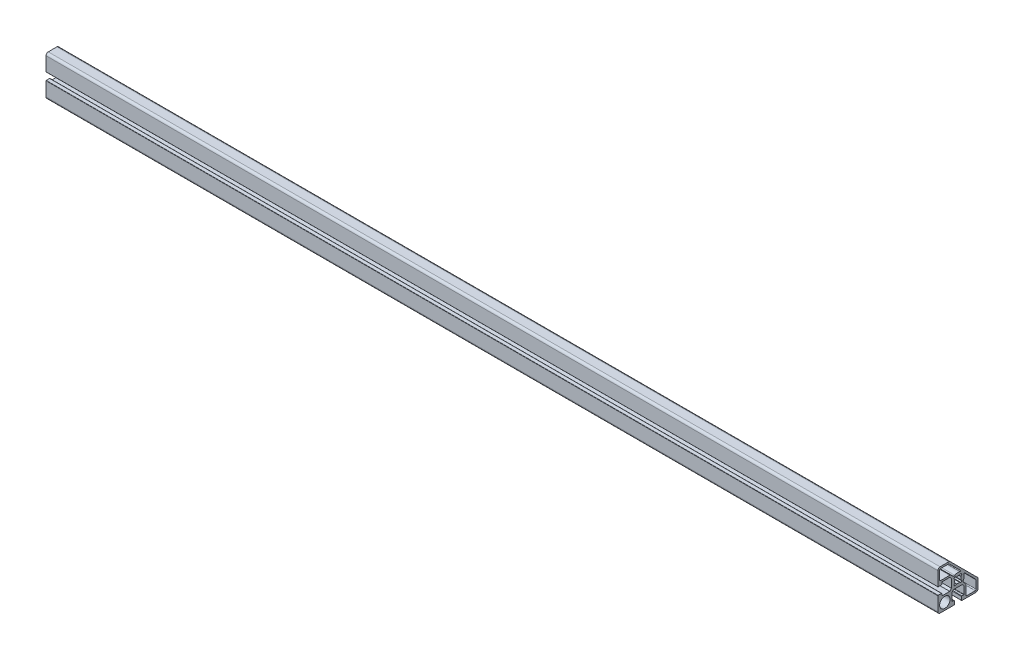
ISO-10303-21;
HEADER;
FILE_DESCRIPTION(('STEP AP214'),'2;1');
FILE_NAME('part.step','',(''),(''),'','','');
FILE_SCHEMA(('AUTOMOTIVE_DESIGN { 1 0 10303 214 1 1 1 1 }'));
ENDSEC;
DATA;
#1=APPLICATION_CONTEXT('core data for automotive mechanical design processes');
#2=APPLICATION_PROTOCOL_DEFINITION('international standard','automotive_design',2000,#1);
#3=PRODUCT_CONTEXT('',#1,'mechanical');
#4=PRODUCT('Part','Part','',(#3));
#5=PRODUCT_RELATED_PRODUCT_CATEGORY('part','',(#4));
#6=PRODUCT_DEFINITION_FORMATION('','',#4);
#7=PRODUCT_DEFINITION_CONTEXT('part definition',#1,'design');
#8=PRODUCT_DEFINITION('design','',#6,#7);
#9=PRODUCT_DEFINITION_SHAPE('','',#8);
#10=(LENGTH_UNIT() NAMED_UNIT(*) SI_UNIT(.MILLI.,.METRE.));
#11=(NAMED_UNIT(*) PLANE_ANGLE_UNIT() SI_UNIT($,.RADIAN.));
#12=(NAMED_UNIT(*) SI_UNIT($,.STERADIAN.) SOLID_ANGLE_UNIT());
#13=UNCERTAINTY_MEASURE_WITH_UNIT(LENGTH_MEASURE(1.E-05),#10,'distance_accuracy_value','');
#14=(GEOMETRIC_REPRESENTATION_CONTEXT(3) GLOBAL_UNCERTAINTY_ASSIGNED_CONTEXT((#13)) GLOBAL_UNIT_ASSIGNED_CONTEXT((#10,
#11,#12)) REPRESENTATION_CONTEXT('',''));
#15=CARTESIAN_POINT('',(0.,0.,0.));
#16=DIRECTION('',(0.,0.,1.));
#17=DIRECTION('',(1.,0.,0.));
#18=AXIS2_PLACEMENT_3D('',#15,#16,#17);
#19=CARTESIAN_POINT('',(1000.,6.50000011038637,17.7009990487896));
#20=DIRECTION('',(-1.,0.,0.));
#21=DIRECTION('',(0.,0.,1.));
#22=AXIS2_PLACEMENT_3D('',#19,#20,#21);
#23=CYLINDRICAL_SURFACE('',#22,0.300000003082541);
#24=CARTESIAN_POINT('',(0.,6.50000011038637,17.7009990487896));
#25=DIRECTION('',(-1.,0.,0.));
#26=DIRECTION('',(0.,0.,-1.));
#27=AXIS2_PLACEMENT_3D('',#24,#25,#26);
#28=CIRCLE('',#27,0.300000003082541);
#29=CARTESIAN_POINT('',(0.,6.50000102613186,18.0009990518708));
#30=VERTEX_POINT('',#29);
#31=CARTESIAN_POINT('',(0.,6.80000011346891,17.7009990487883));
#32=VERTEX_POINT('',#31);
#33=EDGE_CURVE('E986',#30,#32,#28,.T.);
#34=ORIENTED_EDGE('',*,*,#33,.T.);
#35=DIRECTION('',(-1.,0.,0.));
#36=VECTOR('',#35,1.);
#37=CARTESIAN_POINT('',(1000.,6.80000011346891,17.7009990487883));
#38=LINE('',#37,#36);
#39=CARTESIAN_POINT('',(1000.,6.80000011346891,17.7009990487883));
#40=VERTEX_POINT('',#39);
#41=EDGE_CURVE('E13',#40,#32,#38,.T.);
#42=ORIENTED_EDGE('',*,*,#41,.F.);
#43=CARTESIAN_POINT('',(1000.,6.50000011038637,17.7009990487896));
#44=DIRECTION('',(-1.,0.,0.));
#45=DIRECTION('',(0.,0.,-1.));
#46=AXIS2_PLACEMENT_3D('',#43,#44,#45);
#47=CIRCLE('',#46,0.300000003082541);
#48=CARTESIAN_POINT('',(1000.,6.50000102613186,18.0009990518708));
#49=VERTEX_POINT('',#48);
#50=EDGE_CURVE('E1478',#49,#40,#47,.T.);
#51=ORIENTED_EDGE('',*,*,#50,.F.);
#52=DIRECTION('',(-1.,0.,0.));
#53=VECTOR('',#52,1.);
#54=CARTESIAN_POINT('',(1000.,6.50000102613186,18.0009990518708));
#55=LINE('',#54,#53);
#56=EDGE_CURVE('E1069',#49,#30,#55,.T.);
#57=ORIENTED_EDGE('',*,*,#56,.T.);
#58=EDGE_LOOP('',(#34,#42,#51,#57));
#59=FACE_BOUND('',#58,.T.);
#60=ADVANCED_FACE('F175',(#59),#23,.F.);
#61=CARTESIAN_POINT('',(1000.,6.80000011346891,17.7009990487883));
#62=DIRECTION('',(0.,1.,0.));
#63=DIRECTION('',(0.,0.,1.));
#64=AXIS2_PLACEMENT_3D('',#61,#62,#63);
#65=PLANE('',#64);
#66=DIRECTION('',(0.,0.,-1.));
#67=VECTOR('',#66,1.);
#68=CARTESIAN_POINT('',(0.,6.80000011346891,17.7009990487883));
#69=LINE('',#68,#67);
#70=CARTESIAN_POINT('',(0.,6.800000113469,9.20099896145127));
#71=VERTEX_POINT('',#70);
#72=EDGE_CURVE('E989',#32,#71,#69,.T.);
#73=ORIENTED_EDGE('',*,*,#72,.T.);
#74=DIRECTION('',(-1.,0.,0.));
#75=VECTOR('',#74,1.);
#76=CARTESIAN_POINT('',(1000.,6.800000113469,9.20099896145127));
#77=LINE('',#76,#75);
#78=CARTESIAN_POINT('',(1000.,6.800000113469,9.20099896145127));
#79=VERTEX_POINT('',#78);
#80=EDGE_CURVE('E185',#79,#71,#77,.T.);
#81=ORIENTED_EDGE('',*,*,#80,.F.);
#82=DIRECTION('',(0.,0.,-1.));
#83=VECTOR('',#82,1.);
#84=CARTESIAN_POINT('',(1000.,6.80000011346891,17.7009990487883));
#85=LINE('',#84,#83);
#86=EDGE_CURVE('E1480',#40,#79,#85,.T.);
#87=ORIENTED_EDGE('',*,*,#86,.F.);
#88=ORIENTED_EDGE('',*,*,#41,.T.);
#89=EDGE_LOOP('',(#73,#81,#87,#88));
#90=FACE_BOUND('',#89,.T.);
#91=ADVANCED_FACE('F1584',(#90),#65,.F.);
#92=CARTESIAN_POINT('',(1000.,6.800000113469,9.20099896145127));
#93=DIRECTION('',(0.,0.707106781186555,-0.70710678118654));
#94=DIRECTION('',(0.,0.70710678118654,0.707106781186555));
#95=AXIS2_PLACEMENT_3D('',#92,#93,#94);
#96=PLANE('',#95);
#97=DIRECTION('',(0.,-0.70710678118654,-0.707106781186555));
#98=VECTOR('',#97,1.);
#99=CARTESIAN_POINT('',(0.,6.800000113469,9.20099896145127));
#100=LINE('',#99,#98);
#101=CARTESIAN_POINT('',(0.,4.80000009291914,7.20099894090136));
#102=VERTEX_POINT('',#101);
#103=EDGE_CURVE('E991',#71,#102,#100,.T.);
#104=ORIENTED_EDGE('',*,*,#103,.T.);
#105=DIRECTION('',(-1.,0.,0.));
#106=VECTOR('',#105,1.);
#107=CARTESIAN_POINT('',(1000.,4.80000009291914,7.20099894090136));
#108=LINE('',#107,#106);
#109=CARTESIAN_POINT('',(1000.,4.80000009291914,7.20099894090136));
#110=VERTEX_POINT('',#109);
#111=EDGE_CURVE('E1179',#110,#102,#108,.T.);
#112=ORIENTED_EDGE('',*,*,#111,.F.);
#113=DIRECTION('',(0.,-0.70710678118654,-0.707106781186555));
#114=VECTOR('',#113,1.);
#115=CARTESIAN_POINT('',(1000.,6.800000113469,9.20099896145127));
#116=LINE('',#115,#114);
#117=EDGE_CURVE('E1482',#79,#110,#116,.T.);
#118=ORIENTED_EDGE('',*,*,#117,.F.);
#119=ORIENTED_EDGE('',*,*,#80,.T.);
#120=EDGE_LOOP('',(#104,#112,#118,#119));
#121=FACE_BOUND('',#120,.T.);
#122=ADVANCED_FACE('F1589',(#121),#96,.F.);
#123=CARTESIAN_POINT('',(1000.,4.80000009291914,7.20099894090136));
#124=DIRECTION('',(0.,0.,-1.));
#125=DIRECTION('',(0.,1.,0.));
#126=AXIS2_PLACEMENT_3D('',#123,#124,#125);
#127=PLANE('',#126);
#128=DIRECTION('',(0.,-1.,0.));
#129=VECTOR('',#128,1.);
#130=CARTESIAN_POINT('',(0.,4.80000009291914,7.20099894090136));
#131=LINE('',#130,#129);
#132=CARTESIAN_POINT('',(0.,-4.79999800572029,7.20099894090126));
#133=VERTEX_POINT('',#132);
#134=EDGE_CURVE('E993',#102,#133,#131,.T.);
#135=ORIENTED_EDGE('',*,*,#134,.T.);
#136=DIRECTION('',(-1.,0.,0.));
#137=VECTOR('',#136,1.);
#138=CARTESIAN_POINT('',(1000.,-4.79999800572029,7.20099894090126));
#139=LINE('',#138,#137);
#140=CARTESIAN_POINT('',(1000.,-4.79999800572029,7.20099894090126));
#141=VERTEX_POINT('',#140);
#142=EDGE_CURVE('E1176',#141,#133,#139,.T.);
#143=ORIENTED_EDGE('',*,*,#142,.F.);
#144=DIRECTION('',(0.,-1.,0.));
#145=VECTOR('',#144,1.);
#146=CARTESIAN_POINT('',(1000.,4.80000009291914,7.20099894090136));
#147=LINE('',#146,#145);
#148=EDGE_CURVE('E1484',#110,#141,#147,.T.);
#149=ORIENTED_EDGE('',*,*,#148,.F.);
#150=ORIENTED_EDGE('',*,*,#111,.T.);
#151=EDGE_LOOP('',(#135,#143,#149,#150));
#152=FACE_BOUND('',#151,.T.);
#153=ADVANCED_FACE('F2343',(#152),#127,.F.);
#154=CARTESIAN_POINT('',(1000.,-4.79999800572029,7.20099894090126));
#155=DIRECTION('',(0.,-0.707106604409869,-0.707106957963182));
#156=DIRECTION('',(0.,0.707106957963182,-0.707106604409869));
#157=AXIS2_PLACEMENT_3D('',#154,#155,#156);
#158=PLANE('',#157);
#159=DIRECTION('',(0.,-0.707106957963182,0.707106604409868));
#160=VECTOR('',#159,1.);
#161=CARTESIAN_POINT('',(0.,-4.79999800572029,7.20099894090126));
#162=LINE('',#161,#160);
#163=CARTESIAN_POINT('',(0.,-6.7999990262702,9.20099896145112));
#164=VERTEX_POINT('',#163);
#165=EDGE_CURVE('E995',#133,#164,#162,.T.);
#166=ORIENTED_EDGE('',*,*,#165,.T.);
#167=DIRECTION('',(-1.,0.,0.));
#168=VECTOR('',#167,1.);
#169=CARTESIAN_POINT('',(1000.,-6.7999990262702,9.20099896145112));
#170=LINE('',#169,#168);
#171=CARTESIAN_POINT('',(1000.,-6.7999990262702,9.20099896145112));
#172=VERTEX_POINT('',#171);
#173=EDGE_CURVE('E1173',#172,#164,#170,.T.);
#174=ORIENTED_EDGE('',*,*,#173,.F.);
#175=DIRECTION('',(0.,-0.707106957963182,0.707106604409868));
#176=VECTOR('',#175,1.);
#177=CARTESIAN_POINT('',(1000.,-4.79999800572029,7.20099894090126));
#178=LINE('',#177,#176);
#179=EDGE_CURVE('E1486',#141,#172,#178,.T.);
#180=ORIENTED_EDGE('',*,*,#179,.F.);
#181=ORIENTED_EDGE('',*,*,#142,.T.);
#182=EDGE_LOOP('',(#166,#174,#180,#181));
#183=FACE_BOUND('',#182,.T.);
#184=ADVANCED_FACE('F2334',(#183),#158,.F.);
#185=CARTESIAN_POINT('',(1000.,-6.7999990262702,9.20099896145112));
#186=DIRECTION('',(0.,-1.,0.));
#187=DIRECTION('',(0.,0.,-1.));
#188=AXIS2_PLACEMENT_3D('',#185,#186,#187);
#189=PLANE('',#188);
#190=DIRECTION('',(0.,0.,1.));
#191=VECTOR('',#190,1.);
#192=CARTESIAN_POINT('',(0.,-6.7999990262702,9.20099896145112));
#193=LINE('',#192,#191);
#194=CARTESIAN_POINT('',(0.,-6.79999902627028,17.7009990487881));
#195=VERTEX_POINT('',#194);
#196=EDGE_CURVE('E997',#164,#195,#193,.T.);
#197=ORIENTED_EDGE('',*,*,#196,.T.);
#198=DIRECTION('',(-1.,0.,0.));
#199=VECTOR('',#198,1.);
#200=CARTESIAN_POINT('',(1000.,-6.79999902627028,17.7009990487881));
#201=LINE('',#200,#199);
#202=CARTESIAN_POINT('',(1000.,-6.79999902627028,17.7009990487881));
#203=VERTEX_POINT('',#202);
#204=EDGE_CURVE('E1170',#203,#195,#201,.T.);
#205=ORIENTED_EDGE('',*,*,#204,.F.);
#206=DIRECTION('',(0.,0.,1.));
#207=VECTOR('',#206,1.);
#208=CARTESIAN_POINT('',(1000.,-6.7999990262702,9.20099896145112));
#209=LINE('',#208,#207);
#210=EDGE_CURVE('E1488',#172,#203,#209,.T.);
#211=ORIENTED_EDGE('',*,*,#210,.F.);
#212=ORIENTED_EDGE('',*,*,#173,.T.);
#213=EDGE_LOOP('',(#197,#205,#211,#212));
#214=FACE_BOUND('',#213,.T.);
#215=ADVANCED_FACE('F2325',(#214),#189,.F.);
#216=CARTESIAN_POINT('',(1000.,-6.49999902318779,17.7009990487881));
#217=DIRECTION('',(-1.,0.,0.));
#218=DIRECTION('',(0.,0.,1.));
#219=AXIS2_PLACEMENT_3D('',#216,#217,#218);
#220=CYLINDRICAL_SURFACE('',#219,0.3000000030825);
#221=CARTESIAN_POINT('',(0.,-6.49999902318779,17.7009990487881));
#222=DIRECTION('',(-1.,0.,0.));
#223=DIRECTION('',(0.,0.,-1.));
#224=AXIS2_PLACEMENT_3D('',#221,#222,#223);
#225=CIRCLE('',#224,0.3000000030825);
#226=CARTESIAN_POINT('',(0.,-6.49999902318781,18.0009990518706));
#227=VERTEX_POINT('',#226);
#228=EDGE_CURVE('E999',#195,#227,#225,.T.);
#229=ORIENTED_EDGE('',*,*,#228,.T.);
#230=DIRECTION('',(-1.,0.,0.));
#231=VECTOR('',#230,1.);
#232=CARTESIAN_POINT('',(1000.,-6.49999902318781,18.0009990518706));
#233=LINE('',#232,#231);
#234=CARTESIAN_POINT('',(1000.,-6.49999902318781,18.0009990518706));
#235=VERTEX_POINT('',#234);
#236=EDGE_CURVE('E1167',#235,#227,#233,.T.);
#237=ORIENTED_EDGE('',*,*,#236,.F.);
#238=CARTESIAN_POINT('',(1000.,-6.49999902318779,17.7009990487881));
#239=DIRECTION('',(-1.,0.,0.));
#240=DIRECTION('',(0.,0.,-1.));
#241=AXIS2_PLACEMENT_3D('',#238,#239,#240);
#242=CIRCLE('',#241,0.3000000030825);
#243=EDGE_CURVE('E1490',#203,#235,#242,.T.);
#244=ORIENTED_EDGE('',*,*,#243,.F.);
#245=ORIENTED_EDGE('',*,*,#204,.T.);
#246=EDGE_LOOP('',(#229,#237,#244,#245));
#247=FACE_BOUND('',#246,.T.);
#248=ADVANCED_FACE('F2316',(#247),#220,.F.);
#249=CARTESIAN_POINT('',(1000.,-6.49999902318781,18.0009990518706));
#250=DIRECTION('',(0.,0.,1.));
#251=DIRECTION('',(0.,-1.,0.));
#252=AXIS2_PLACEMENT_3D('',#249,#250,#251);
#253=PLANE('',#252);
#254=DIRECTION('',(0.,1.,0.));
#255=VECTOR('',#254,1.);
#256=CARTESIAN_POINT('',(0.,-6.49999902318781,18.0009990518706));
#257=LINE('',#256,#255);
#258=CARTESIAN_POINT('',(0.,-4.59999900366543,18.0009990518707));
#259=VERTEX_POINT('',#258);
#260=EDGE_CURVE('E1001',#227,#259,#257,.T.);
#261=ORIENTED_EDGE('',*,*,#260,.T.);
#262=DIRECTION('',(-1.,0.,0.));
#263=VECTOR('',#262,1.);
#264=CARTESIAN_POINT('',(1000.,-4.59999900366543,18.0009990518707));
#265=LINE('',#264,#263);
#266=CARTESIAN_POINT('',(1000.,-4.59999900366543,18.0009990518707));
#267=VERTEX_POINT('',#266);
#268=EDGE_CURVE('E1164',#267,#259,#265,.T.);
#269=ORIENTED_EDGE('',*,*,#268,.F.);
#270=DIRECTION('',(0.,1.,0.));
#271=VECTOR('',#270,1.);
#272=CARTESIAN_POINT('',(1000.,-6.49999902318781,18.0009990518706));
#273=LINE('',#272,#271);
#274=EDGE_CURVE('E1492',#235,#267,#273,.T.);
#275=ORIENTED_EDGE('',*,*,#274,.F.);
#276=ORIENTED_EDGE('',*,*,#236,.T.);
#277=EDGE_LOOP('',(#261,#269,#275,#276));
#278=FACE_BOUND('',#277,.T.);
#279=ADVANCED_FACE('F2307',(#278),#253,.F.);
#280=CARTESIAN_POINT('',(1000.,-4.59999900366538,18.5009990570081));
#281=DIRECTION('',(-1.,0.,0.));
#282=DIRECTION('',(0.,0.,1.));
#283=AXIS2_PLACEMENT_3D('',#280,#281,#282);
#284=CYLINDRICAL_SURFACE('',#283,0.500000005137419);
#285=CARTESIAN_POINT('',(0.,-4.59999900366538,18.5009990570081));
#286=DIRECTION('',(1.,0.,0.));
#287=DIRECTION('',(0.,0.,-1.));
#288=AXIS2_PLACEMENT_3D('',#285,#286,#287);
#289=CIRCLE('',#288,0.500000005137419);
#290=CARTESIAN_POINT('',(0.,-4.09999899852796,18.5009990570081));
#291=VERTEX_POINT('',#290);
#292=EDGE_CURVE('E1003',#259,#291,#289,.T.);
#293=ORIENTED_EDGE('',*,*,#292,.T.);
#294=DIRECTION('',(-1.,0.,0.));
#295=VECTOR('',#294,1.);
#296=CARTESIAN_POINT('',(1000.,-4.09999899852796,18.5009990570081));
#297=LINE('',#296,#295);
#298=CARTESIAN_POINT('',(1000.,-4.09999899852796,18.5009990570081));
#299=VERTEX_POINT('',#298);
#300=EDGE_CURVE('E1161',#299,#291,#297,.T.);
#301=ORIENTED_EDGE('',*,*,#300,.F.);
#302=CARTESIAN_POINT('',(1000.,-4.59999900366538,18.5009990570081));
#303=DIRECTION('',(1.,0.,0.));
#304=DIRECTION('',(0.,0.,-1.));
#305=AXIS2_PLACEMENT_3D('',#302,#303,#304);
#306=CIRCLE('',#305,0.500000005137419);
#307=EDGE_CURVE('E1494',#267,#299,#306,.T.);
#308=ORIENTED_EDGE('',*,*,#307,.F.);
#309=ORIENTED_EDGE('',*,*,#268,.T.);
#310=EDGE_LOOP('',(#293,#301,#308,#309));
#311=FACE_BOUND('',#310,.T.);
#312=ADVANCED_FACE('F2298',(#311),#284,.T.);
#313=CARTESIAN_POINT('',(1000.,-4.09999899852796,18.5009990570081));
#314=DIRECTION('',(0.,-1.,0.));
#315=DIRECTION('',(0.,0.,-1.));
#316=AXIS2_PLACEMENT_3D('',#313,#314,#315);
#317=PLANE('',#316);
#318=DIRECTION('',(0.,0.,1.));
#319=VECTOR('',#318,1.);
#320=CARTESIAN_POINT('',(0.,-4.09999899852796,18.5009990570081));
#321=LINE('',#320,#319);
#322=CARTESIAN_POINT('',(0.,-4.099998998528,22.2009990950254));
#323=VERTEX_POINT('',#322);
#324=EDGE_CURVE('E1005',#291,#323,#321,.T.);
#325=ORIENTED_EDGE('',*,*,#324,.T.);
#326=DIRECTION('',(-1.,0.,0.));
#327=VECTOR('',#326,1.);
#328=CARTESIAN_POINT('',(1000.,-4.099998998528,22.2009990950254));
#329=LINE('',#328,#327);
#330=CARTESIAN_POINT('',(1000.,-4.099998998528,22.2009990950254));
#331=VERTEX_POINT('',#330);
#332=EDGE_CURVE('E1158',#331,#323,#329,.T.);
#333=ORIENTED_EDGE('',*,*,#332,.F.);
#334=DIRECTION('',(0.,0.,1.));
#335=VECTOR('',#334,1.);
#336=CARTESIAN_POINT('',(1000.,-4.09999899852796,18.5009990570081));
#337=LINE('',#336,#335);
#338=EDGE_CURVE('E1496',#299,#331,#337,.T.);
#339=ORIENTED_EDGE('',*,*,#338,.F.);
#340=ORIENTED_EDGE('',*,*,#300,.T.);
#341=EDGE_LOOP('',(#325,#333,#339,#340));
#342=FACE_BOUND('',#341,.T.);
#343=ADVANCED_FACE('F2289',(#342),#317,.F.);
#344=CARTESIAN_POINT('',(1000.,-4.39999900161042,22.2009990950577));
#345=DIRECTION('',(-1.,0.,0.));
#346=DIRECTION('',(0.,0.,1.));
#347=AXIS2_PLACEMENT_3D('',#344,#345,#346);
#348=CYLINDRICAL_SURFACE('',#347,0.300000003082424);
#349=CARTESIAN_POINT('',(0.,-4.39999900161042,22.2009990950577));
#350=DIRECTION('',(1.,0.,0.));
#351=DIRECTION('',(0.,0.,-1.));
#352=AXIS2_PLACEMENT_3D('',#349,#350,#351);
#353=CIRCLE('',#352,0.300000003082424);
#354=CARTESIAN_POINT('',(0.,-4.37745800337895,22.5001510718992));
#355=VERTEX_POINT('',#354);
#356=EDGE_CURVE('E1007',#323,#355,#353,.T.);
#357=ORIENTED_EDGE('',*,*,#356,.T.);
#358=DIRECTION('',(-1.,0.,0.));
#359=VECTOR('',#358,1.);
#360=CARTESIAN_POINT('',(1000.,-4.37745800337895,22.5001510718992));
#361=LINE('',#360,#359);
#362=CARTESIAN_POINT('',(1000.,-4.37745800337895,22.5001510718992));
#363=VERTEX_POINT('',#362);
#364=EDGE_CURVE('E1155',#363,#355,#361,.T.);
#365=ORIENTED_EDGE('',*,*,#364,.F.);
#366=CARTESIAN_POINT('',(1000.,-4.39999900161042,22.2009990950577));
#367=DIRECTION('',(1.,0.,0.));
#368=DIRECTION('',(0.,0.,-1.));
#369=AXIS2_PLACEMENT_3D('',#366,#367,#368);
#370=CIRCLE('',#369,0.300000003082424);
#371=EDGE_CURVE('E1498',#331,#363,#370,.T.);
#372=ORIENTED_EDGE('',*,*,#371,.F.);
#373=ORIENTED_EDGE('',*,*,#332,.T.);
#374=EDGE_LOOP('',(#357,#365,#372,#373));
#375=FACE_BOUND('',#374,.T.);
#376=ADVANCED_FACE('F2280',(#375),#348,.T.);
#377=CARTESIAN_POINT('',(1000.,-4.37745800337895,22.5001510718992));
#378=DIRECTION('',(0.,0.,-1.));
#379=DIRECTION('',(0.,1.,0.));
#380=AXIS2_PLACEMENT_3D('',#377,#378,#379);
#381=PLANE('',#380);
#382=DIRECTION('',(0.,-1.,0.));
#383=VECTOR('',#382,1.);
#384=CARTESIAN_POINT('',(0.,-4.37745800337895,22.5001510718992));
#385=LINE('',#384,#383);
#386=CARTESIAN_POINT('',(0.,-19.9999831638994,22.500151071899));
#387=VERTEX_POINT('',#386);
#388=EDGE_CURVE('E1009',#355,#387,#385,.T.);
#389=ORIENTED_EDGE('',*,*,#388,.T.);
#390=DIRECTION('',(-1.,0.,0.));
#391=VECTOR('',#390,1.);
#392=CARTESIAN_POINT('',(1000.,-19.9999831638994,22.500151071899));
#393=LINE('',#392,#391);
#394=CARTESIAN_POINT('',(1000.,-19.9999831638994,22.500151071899));
#395=VERTEX_POINT('',#394);
#396=EDGE_CURVE('E1152',#395,#387,#393,.T.);
#397=ORIENTED_EDGE('',*,*,#396,.F.);
#398=DIRECTION('',(0.,-1.,0.));
#399=VECTOR('',#398,1.);
#400=CARTESIAN_POINT('',(1000.,-4.37745800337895,22.5001510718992));
#401=LINE('',#400,#399);
#402=EDGE_CURVE('E1500',#363,#395,#401,.T.);
#403=ORIENTED_EDGE('',*,*,#402,.F.);
#404=ORIENTED_EDGE('',*,*,#364,.T.);
#405=EDGE_LOOP('',(#389,#397,#403,#404));
#406=FACE_BOUND('',#405,.T.);
#407=ADVANCED_FACE('F2271',(#406),#381,.F.);
#408=CARTESIAN_POINT('',(1000.,-19.9999856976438,20.0001380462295));
#409=DIRECTION('',(-1.,0.,0.));
#410=DIRECTION('',(0.,0.,1.));
#411=AXIS2_PLACEMENT_3D('',#408,#409,#410);
#412=CYLINDRICAL_SURFACE('',#411,2.50001302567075);
#413=CARTESIAN_POINT('',(0.,-19.9999856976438,20.0001380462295));
#414=DIRECTION('',(1.,0.,0.));
#415=DIRECTION('',(0.,0.,-1.));
#416=AXIS2_PLACEMENT_3D('',#413,#414,#415);
#417=CIRCLE('',#416,2.50001302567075);
#418=CARTESIAN_POINT('',(0.,-22.4999987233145,20.0001375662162));
#419=VERTEX_POINT('',#418);
#420=EDGE_CURVE('E1011',#387,#419,#417,.T.);
#421=ORIENTED_EDGE('',*,*,#420,.T.);
#422=DIRECTION('',(-1.,0.,0.));
#423=VECTOR('',#422,1.);
#424=CARTESIAN_POINT('',(1000.,-22.4999987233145,20.0001375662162));
#425=LINE('',#424,#423);
#426=CARTESIAN_POINT('',(1000.,-22.4999987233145,20.0001375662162));
#427=VERTEX_POINT('',#426);
#428=EDGE_CURVE('E1149',#427,#419,#425,.T.);
#429=ORIENTED_EDGE('',*,*,#428,.F.);
#430=CARTESIAN_POINT('',(1000.,-19.9999856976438,20.0001380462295));
#431=DIRECTION('',(1.,0.,0.));
#432=DIRECTION('',(0.,0.,-1.));
#433=AXIS2_PLACEMENT_3D('',#430,#431,#432);
#434=CIRCLE('',#433,2.50001302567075);
#435=EDGE_CURVE('E1502',#395,#427,#434,.T.);
#436=ORIENTED_EDGE('',*,*,#435,.F.);
#437=ORIENTED_EDGE('',*,*,#396,.T.);
#438=EDGE_LOOP('',(#421,#429,#436,#437));
#439=FACE_BOUND('',#438,.T.);
#440=ADVANCED_FACE('F2262',(#439),#412,.T.);
#441=CARTESIAN_POINT('',(1000.,-22.4999987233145,20.0001375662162));
#442=DIRECTION('',(0.,1.,0.));
#443=DIRECTION('',(0.,0.,1.));
#444=AXIS2_PLACEMENT_3D('',#441,#442,#443);
#445=PLANE('',#444);
#446=DIRECTION('',(0.,0.,-1.));
#447=VECTOR('',#446,1.);
#448=CARTESIAN_POINT('',(0.,-22.4999987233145,20.0001375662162));
#449=LINE('',#448,#447);
#450=CARTESIAN_POINT('',(0.,-22.4999987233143,4.37547388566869));
#451=VERTEX_POINT('',#450);
#452=EDGE_CURVE('E1013',#419,#451,#449,.T.);
#453=ORIENTED_EDGE('',*,*,#452,.T.);
#454=DIRECTION('',(-1.,0.,0.));
#455=VECTOR('',#454,1.);
#456=CARTESIAN_POINT('',(1000.,-22.4999987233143,4.37547388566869));
#457=LINE('',#456,#455);
#458=CARTESIAN_POINT('',(1000.,-22.4999987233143,4.37547388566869));
#459=VERTEX_POINT('',#458);
#460=EDGE_CURVE('E1146',#459,#451,#457,.T.);
#461=ORIENTED_EDGE('',*,*,#460,.F.);
#462=DIRECTION('',(0.,0.,-1.));
#463=VECTOR('',#462,1.);
#464=CARTESIAN_POINT('',(1000.,-22.4999987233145,20.0001375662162));
#465=LINE('',#464,#463);
#466=EDGE_CURVE('E1504',#427,#459,#465,.T.);
#467=ORIENTED_EDGE('',*,*,#466,.F.);
#468=ORIENTED_EDGE('',*,*,#428,.T.);
#469=EDGE_LOOP('',(#453,#461,#467,#468));
#470=FACE_BOUND('',#469,.T.);
#471=ADVANCED_FACE('F2253',(#470),#445,.F.);
#472=CARTESIAN_POINT('',(1000.,-22.2010028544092,4.39999881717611));
#473=DIRECTION('',(-1.,0.,0.));
#474=DIRECTION('',(0.,0.,1.));
#475=AXIS2_PLACEMENT_3D('',#472,#473,#474);
#476=CYLINDRICAL_SURFACE('',#475,0.300000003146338);
#477=CARTESIAN_POINT('',(0.,-22.2010028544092,4.39999881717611));
#478=DIRECTION('',(1.,0.,0.));
#479=DIRECTION('',(0.,0.,-1.));
#480=AXIS2_PLACEMENT_3D('',#477,#478,#479);
#481=CIRCLE('',#480,0.300000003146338);
#482=CARTESIAN_POINT('',(0.,-22.2010029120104,4.09999881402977));
#483=VERTEX_POINT('',#482);
#484=EDGE_CURVE('E1015',#451,#483,#481,.T.);
#485=ORIENTED_EDGE('',*,*,#484,.T.);
#486=DIRECTION('',(-1.,0.,0.));
#487=VECTOR('',#486,1.);
#488=CARTESIAN_POINT('',(1000.,-22.2010029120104,4.09999881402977));
#489=LINE('',#488,#487);
#490=CARTESIAN_POINT('',(1000.,-22.2010029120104,4.09999881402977));
#491=VERTEX_POINT('',#490);
#492=EDGE_CURVE('E1143',#491,#483,#489,.T.);
#493=ORIENTED_EDGE('',*,*,#492,.F.);
#494=CARTESIAN_POINT('',(1000.,-22.2010028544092,4.39999881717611));
#495=DIRECTION('',(1.,0.,0.));
#496=DIRECTION('',(0.,0.,-1.));
#497=AXIS2_PLACEMENT_3D('',#494,#495,#496);
#498=CIRCLE('',#497,0.300000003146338);
#499=EDGE_CURVE('E1506',#459,#491,#498,.T.);
#500=ORIENTED_EDGE('',*,*,#499,.F.);
#501=ORIENTED_EDGE('',*,*,#460,.T.);
#502=EDGE_LOOP('',(#485,#493,#500,#501));
#503=FACE_BOUND('',#502,.T.);
#504=ADVANCED_FACE('F2244',(#503),#476,.T.);
#505=CARTESIAN_POINT('',(1000.,-22.2010029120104,4.09999881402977));
#506=DIRECTION('',(0.,0.,1.));
#507=DIRECTION('',(0.,-1.,0.));
#508=AXIS2_PLACEMENT_3D('',#505,#506,#507);
#509=PLANE('',#508);
#510=DIRECTION('',(0.,1.,0.));
#511=VECTOR('',#510,1.);
#512=CARTESIAN_POINT('',(0.,-22.2010029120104,4.09999881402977));
#513=LINE('',#512,#511);
#514=CARTESIAN_POINT('',(0.,-18.5010028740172,4.09999881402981));
#515=VERTEX_POINT('',#514);
#516=EDGE_CURVE('E1017',#483,#515,#513,.T.);
#517=ORIENTED_EDGE('',*,*,#516,.T.);
#518=DIRECTION('',(-1.,0.,0.));
#519=VECTOR('',#518,1.);
#520=CARTESIAN_POINT('',(1000.,-18.5010028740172,4.09999881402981));
#521=LINE('',#520,#519);
#522=CARTESIAN_POINT('',(1000.,-18.5010028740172,4.09999881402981));
#523=VERTEX_POINT('',#522);
#524=EDGE_CURVE('E1140',#523,#515,#521,.T.);
#525=ORIENTED_EDGE('',*,*,#524,.F.);
#526=DIRECTION('',(0.,1.,0.));
#527=VECTOR('',#526,1.);
#528=CARTESIAN_POINT('',(1000.,-22.2010029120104,4.09999881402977));
#529=LINE('',#528,#527);
#530=EDGE_CURVE('E1508',#491,#523,#529,.T.);
#531=ORIENTED_EDGE('',*,*,#530,.F.);
#532=ORIENTED_EDGE('',*,*,#492,.T.);
#533=EDGE_LOOP('',(#517,#525,#531,#532));
#534=FACE_BOUND('',#533,.T.);
#535=ADVANCED_FACE('F2235',(#534),#509,.F.);
#536=CARTESIAN_POINT('',(1000.,-18.5010028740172,4.59999881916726));
#537=DIRECTION('',(-1.,0.,0.));
#538=DIRECTION('',(0.,0.,1.));
#539=AXIS2_PLACEMENT_3D('',#536,#537,#538);
#540=CYLINDRICAL_SURFACE('',#539,0.500000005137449);
#541=CARTESIAN_POINT('',(0.,-18.5010028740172,4.59999881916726));
#542=DIRECTION('',(1.,0.,0.));
#543=DIRECTION('',(0.,0.,-1.));
#544=AXIS2_PLACEMENT_3D('',#541,#542,#543);
#545=CIRCLE('',#544,0.500000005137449);
#546=CARTESIAN_POINT('',(0.,-18.0010028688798,4.59999881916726));
#547=VERTEX_POINT('',#546);
#548=EDGE_CURVE('E1019',#515,#547,#545,.T.);
#549=ORIENTED_EDGE('',*,*,#548,.T.);
#550=DIRECTION('',(-1.,0.,0.));
#551=VECTOR('',#550,1.);
#552=CARTESIAN_POINT('',(1000.,-18.0010028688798,4.59999881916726));
#553=LINE('',#552,#551);
#554=CARTESIAN_POINT('',(1000.,-18.0010028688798,4.59999881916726));
#555=VERTEX_POINT('',#554);
#556=EDGE_CURVE('E1137',#555,#547,#553,.T.);
#557=ORIENTED_EDGE('',*,*,#556,.F.);
#558=CARTESIAN_POINT('',(1000.,-18.5010028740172,4.59999881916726));
#559=DIRECTION('',(1.,0.,0.));
#560=DIRECTION('',(0.,0.,-1.));
#561=AXIS2_PLACEMENT_3D('',#558,#559,#560);
#562=CIRCLE('',#561,0.500000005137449);
#563=EDGE_CURVE('E1510',#523,#555,#562,.T.);
#564=ORIENTED_EDGE('',*,*,#563,.F.);
#565=ORIENTED_EDGE('',*,*,#524,.T.);
#566=EDGE_LOOP('',(#549,#557,#564,#565));
#567=FACE_BOUND('',#566,.T.);
#568=ADVANCED_FACE('F2226',(#567),#540,.T.);
#569=CARTESIAN_POINT('',(1000.,-18.0010028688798,4.59999881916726));
#570=DIRECTION('',(0.,-1.,0.));
#571=DIRECTION('',(0.,0.,-1.));
#572=AXIS2_PLACEMENT_3D('',#569,#570,#571);
#573=PLANE('',#572);
#574=DIRECTION('',(0.,0.,1.));
#575=VECTOR('',#574,1.);
#576=CARTESIAN_POINT('',(0.,-18.0010028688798,4.59999881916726));
#577=LINE('',#576,#575);
#578=CARTESIAN_POINT('',(0.,-18.0010028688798,6.49999883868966));
#579=VERTEX_POINT('',#578);
#580=EDGE_CURVE('E1021',#547,#579,#577,.T.);
#581=ORIENTED_EDGE('',*,*,#580,.T.);
#582=DIRECTION('',(-1.,0.,0.));
#583=VECTOR('',#582,1.);
#584=CARTESIAN_POINT('',(1000.,-18.0010028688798,6.49999883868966));
#585=LINE('',#584,#583);
#586=CARTESIAN_POINT('',(1000.,-18.0010028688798,6.49999883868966));
#587=VERTEX_POINT('',#586);
#588=EDGE_CURVE('E1134',#587,#579,#585,.T.);
#589=ORIENTED_EDGE('',*,*,#588,.F.);
#590=DIRECTION('',(0.,0.,1.));
#591=VECTOR('',#590,1.);
#592=CARTESIAN_POINT('',(1000.,-18.0010028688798,4.59999881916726));
#593=LINE('',#592,#591);
#594=EDGE_CURVE('E1512',#555,#587,#593,.T.);
#595=ORIENTED_EDGE('',*,*,#594,.F.);
#596=ORIENTED_EDGE('',*,*,#556,.T.);
#597=EDGE_LOOP('',(#581,#589,#595,#596));
#598=FACE_BOUND('',#597,.T.);
#599=ADVANCED_FACE('F2217',(#598),#573,.F.);
#600=CARTESIAN_POINT('',(1000.,-17.7010028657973,6.49999883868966));
#601=DIRECTION('',(-1.,0.,0.));
#602=DIRECTION('',(0.,0.,1.));
#603=AXIS2_PLACEMENT_3D('',#600,#601,#602);
#604=CYLINDRICAL_SURFACE('',#603,0.300000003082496);
#605=CARTESIAN_POINT('',(0.,-17.7010028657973,6.49999883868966));
#606=DIRECTION('',(-1.,0.,0.));
#607=DIRECTION('',(0.,0.,-1.));
#608=AXIS2_PLACEMENT_3D('',#605,#606,#607);
#609=CIRCLE('',#608,0.300000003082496);
#610=CARTESIAN_POINT('',(0.,-17.7010028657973,6.79999884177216));
#611=VERTEX_POINT('',#610);
#612=EDGE_CURVE('E1023',#579,#611,#609,.T.);
#613=ORIENTED_EDGE('',*,*,#612,.T.);
#614=DIRECTION('',(-1.,0.,0.));
#615=VECTOR('',#614,1.);
#616=CARTESIAN_POINT('',(1000.,-17.7010028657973,6.79999884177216));
#617=LINE('',#616,#615);
#618=CARTESIAN_POINT('',(1000.,-17.7010028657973,6.79999884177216));
#619=VERTEX_POINT('',#618);
#620=EDGE_CURVE('E1131',#619,#611,#617,.T.);
#621=ORIENTED_EDGE('',*,*,#620,.F.);
#622=CARTESIAN_POINT('',(1000.,-17.7010028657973,6.49999883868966));
#623=DIRECTION('',(-1.,0.,0.));
#624=DIRECTION('',(0.,0.,-1.));
#625=AXIS2_PLACEMENT_3D('',#622,#623,#624);
#626=CIRCLE('',#625,0.300000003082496);
#627=EDGE_CURVE('E1514',#587,#619,#626,.T.);
#628=ORIENTED_EDGE('',*,*,#627,.F.);
#629=ORIENTED_EDGE('',*,*,#588,.T.);
#630=EDGE_LOOP('',(#613,#621,#628,#629));
#631=FACE_BOUND('',#630,.T.);
#632=ADVANCED_FACE('F2208',(#631),#604,.F.);
#633=CARTESIAN_POINT('',(1000.,-17.7010028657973,6.79999884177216));
#634=DIRECTION('',(0.,0.,1.));
#635=DIRECTION('',(0.,-1.,0.));
#636=AXIS2_PLACEMENT_3D('',#633,#634,#635);
#637=PLANE('',#636);
#638=DIRECTION('',(0.,1.,0.));
#639=VECTOR('',#638,1.);
#640=CARTESIAN_POINT('',(0.,-17.7010028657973,6.79999884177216));
#641=LINE('',#640,#639);
#642=CARTESIAN_POINT('',(0.,-9.20100277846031,6.79999884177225));
#643=VERTEX_POINT('',#642);
#644=EDGE_CURVE('E1025',#611,#643,#641,.T.);
#645=ORIENTED_EDGE('',*,*,#644,.T.);
#646=DIRECTION('',(-1.,0.,0.));
#647=VECTOR('',#646,1.);
#648=CARTESIAN_POINT('',(1000.,-9.20100277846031,6.79999884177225));
#649=LINE('',#648,#647);
#650=CARTESIAN_POINT('',(1000.,-9.20100277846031,6.79999884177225));
#651=VERTEX_POINT('',#650);
#652=EDGE_CURVE('E1128',#651,#643,#649,.T.);
#653=ORIENTED_EDGE('',*,*,#652,.F.);
#654=DIRECTION('',(0.,1.,0.));
#655=VECTOR('',#654,1.);
#656=CARTESIAN_POINT('',(1000.,-17.7010028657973,6.79999884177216));
#657=LINE('',#656,#655);
#658=EDGE_CURVE('E1516',#619,#651,#657,.T.);
#659=ORIENTED_EDGE('',*,*,#658,.F.);
#660=ORIENTED_EDGE('',*,*,#620,.T.);
#661=EDGE_LOOP('',(#645,#653,#659,#660));
#662=FACE_BOUND('',#661,.T.);
#663=ADVANCED_FACE('F2199',(#662),#637,.F.);
#664=CARTESIAN_POINT('',(1000.,-9.20100277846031,6.79999884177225));
#665=DIRECTION('',(0.,0.707106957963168,0.707106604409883));
#666=DIRECTION('',(0.,-0.707106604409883,0.707106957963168));
#667=AXIS2_PLACEMENT_3D('',#664,#665,#666);
#668=PLANE('',#667);
#669=DIRECTION('',(0.,0.707106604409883,-0.707106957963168));
#670=VECTOR('',#669,1.);
#671=CARTESIAN_POINT('',(0.,-9.20100277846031,6.79999884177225));
#672=LINE('',#671,#670);
#673=CARTESIAN_POINT('',(0.,-7.2010027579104,4.79999782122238));
#674=VERTEX_POINT('',#673);
#675=EDGE_CURVE('E1027',#643,#674,#672,.T.);
#676=ORIENTED_EDGE('',*,*,#675,.T.);
#677=DIRECTION('',(-1.,0.,0.));
#678=VECTOR('',#677,1.);
#679=CARTESIAN_POINT('',(1000.,-7.2010027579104,4.79999782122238));
#680=LINE('',#679,#678);
#681=CARTESIAN_POINT('',(1000.,-7.2010027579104,4.79999782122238));
#682=VERTEX_POINT('',#681);
#683=EDGE_CURVE('E1125',#682,#674,#680,.T.);
#684=ORIENTED_EDGE('',*,*,#683,.F.);
#685=DIRECTION('',(0.,0.707106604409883,-0.707106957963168));
#686=VECTOR('',#685,1.);
#687=CARTESIAN_POINT('',(1000.,-9.20100277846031,6.79999884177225));
#688=LINE('',#687,#686);
#689=EDGE_CURVE('E1518',#651,#682,#688,.T.);
#690=ORIENTED_EDGE('',*,*,#689,.F.);
#691=ORIENTED_EDGE('',*,*,#652,.T.);
#692=EDGE_LOOP('',(#676,#684,#690,#691));
#693=FACE_BOUND('',#692,.T.);
#694=ADVANCED_FACE('F2190',(#693),#668,.F.);
#695=CARTESIAN_POINT('',(1000.,-7.2010027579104,4.79999782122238));
#696=DIRECTION('',(0.,1.,0.));
#697=DIRECTION('',(0.,0.,1.));
#698=AXIS2_PLACEMENT_3D('',#695,#696,#697);
#699=PLANE('',#698);
#700=DIRECTION('',(0.,0.,-1.));
#701=VECTOR('',#700,1.);
#702=CARTESIAN_POINT('',(0.,-7.2010027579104,4.79999782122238));
#703=LINE('',#702,#701);
#704=CARTESIAN_POINT('',(0.,-7.2010027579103,-4.80000027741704));
#705=VERTEX_POINT('',#704);
#706=EDGE_CURVE('E1029',#674,#705,#703,.T.);
#707=ORIENTED_EDGE('',*,*,#706,.T.);
#708=DIRECTION('',(-1.,0.,0.));
#709=VECTOR('',#708,1.);
#710=CARTESIAN_POINT('',(1000.,-7.2010027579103,-4.80000027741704));
#711=LINE('',#710,#709);
#712=CARTESIAN_POINT('',(1000.,-7.2010027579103,-4.80000027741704));
#713=VERTEX_POINT('',#712);
#714=EDGE_CURVE('E1122',#713,#705,#711,.T.);
#715=ORIENTED_EDGE('',*,*,#714,.F.);
#716=DIRECTION('',(0.,0.,-1.));
#717=VECTOR('',#716,1.);
#718=CARTESIAN_POINT('',(1000.,-7.2010027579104,4.79999782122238));
#719=LINE('',#718,#717);
#720=EDGE_CURVE('E1520',#682,#713,#719,.T.);
#721=ORIENTED_EDGE('',*,*,#720,.F.);
#722=ORIENTED_EDGE('',*,*,#683,.T.);
#723=EDGE_LOOP('',(#707,#715,#721,#722));
#724=FACE_BOUND('',#723,.T.);
#725=ADVANCED_FACE('F2181',(#724),#699,.F.);
#726=CARTESIAN_POINT('',(1000.,-7.2010027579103,-4.80000027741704));
#727=DIRECTION('',(0.,0.707106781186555,-0.70710678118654));
#728=DIRECTION('',(0.,0.70710678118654,0.707106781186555));
#729=AXIS2_PLACEMENT_3D('',#726,#727,#728);
#730=PLANE('',#729);
#731=DIRECTION('',(0.,-0.70710678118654,-0.707106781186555));
#732=VECTOR('',#731,1.);
#733=CARTESIAN_POINT('',(0.,-7.2010027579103,-4.80000027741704));
#734=LINE('',#733,#732);
#735=CARTESIAN_POINT('',(0.,-9.20100277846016,-6.80000029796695));
#736=VERTEX_POINT('',#735);
#737=EDGE_CURVE('E1031',#705,#736,#734,.T.);
#738=ORIENTED_EDGE('',*,*,#737,.T.);
#739=DIRECTION('',(-1.,0.,0.));
#740=VECTOR('',#739,1.);
#741=CARTESIAN_POINT('',(1000.,-9.20100277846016,-6.80000029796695));
#742=LINE('',#741,#740);
#743=CARTESIAN_POINT('',(1000.,-9.20100277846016,-6.80000029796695));
#744=VERTEX_POINT('',#743);
#745=EDGE_CURVE('E1119',#744,#736,#742,.T.);
#746=ORIENTED_EDGE('',*,*,#745,.F.);
#747=DIRECTION('',(0.,-0.70710678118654,-0.707106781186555));
#748=VECTOR('',#747,1.);
#749=CARTESIAN_POINT('',(1000.,-7.2010027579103,-4.80000027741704));
#750=LINE('',#749,#748);
#751=EDGE_CURVE('E1522',#713,#744,#750,.T.);
#752=ORIENTED_EDGE('',*,*,#751,.F.);
#753=ORIENTED_EDGE('',*,*,#714,.T.);
#754=EDGE_LOOP('',(#738,#746,#752,#753));
#755=FACE_BOUND('',#754,.T.);
#756=ADVANCED_FACE('F2172',(#755),#730,.F.);
#757=CARTESIAN_POINT('',(1000.,-9.20100277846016,-6.80000029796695));
#758=DIRECTION('',(0.,0.,-1.));
#759=DIRECTION('',(0.,1.,0.));
#760=AXIS2_PLACEMENT_3D('',#757,#758,#759);
#761=PLANE('',#760);
#762=DIRECTION('',(0.,-1.,0.));
#763=VECTOR('',#762,1.);
#764=CARTESIAN_POINT('',(0.,-9.20100277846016,-6.80000029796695));
#765=LINE('',#764,#763);
#766=CARTESIAN_POINT('',(0.,-17.7010028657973,-6.80000029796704));
#767=VERTEX_POINT('',#766);
#768=EDGE_CURVE('E1033',#736,#767,#765,.T.);
#769=ORIENTED_EDGE('',*,*,#768,.T.);
#770=DIRECTION('',(-1.,0.,0.));
#771=VECTOR('',#770,1.);
#772=CARTESIAN_POINT('',(1000.,-17.7010028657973,-6.80000029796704));
#773=LINE('',#772,#771);
#774=CARTESIAN_POINT('',(1000.,-17.7010028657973,-6.80000029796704));
#775=VERTEX_POINT('',#774);
#776=EDGE_CURVE('E1116',#775,#767,#773,.T.);
#777=ORIENTED_EDGE('',*,*,#776,.F.);
#778=DIRECTION('',(0.,-1.,0.));
#779=VECTOR('',#778,1.);
#780=CARTESIAN_POINT('',(1000.,-9.20100277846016,-6.80000029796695));
#781=LINE('',#780,#779);
#782=EDGE_CURVE('E1524',#744,#775,#781,.T.);
#783=ORIENTED_EDGE('',*,*,#782,.F.);
#784=ORIENTED_EDGE('',*,*,#745,.T.);
#785=EDGE_LOOP('',(#769,#777,#783,#784));
#786=FACE_BOUND('',#785,.T.);
#787=ADVANCED_FACE('F2163',(#786),#761,.F.);
#788=CARTESIAN_POINT('',(1000.,-17.7010045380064,-6.50000029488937));
#789=DIRECTION('',(-1.,0.,0.));
#790=DIRECTION('',(0.,0.,1.));
#791=AXIS2_PLACEMENT_3D('',#788,#789,#790);
#792=CYLINDRICAL_SURFACE('',#791,0.300000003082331);
#793=CARTESIAN_POINT('',(0.,-17.7010045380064,-6.50000029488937));
#794=DIRECTION('',(-1.,0.,0.));
#795=DIRECTION('',(0.,0.,-1.));
#796=AXIS2_PLACEMENT_3D('',#793,#794,#795);
#797=CIRCLE('',#796,0.300000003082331);
#798=CARTESIAN_POINT('',(0.,-18.0010045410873,-6.50000121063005));
#799=VERTEX_POINT('',#798);
#800=EDGE_CURVE('E1035',#767,#799,#797,.T.);
#801=ORIENTED_EDGE('',*,*,#800,.T.);
#802=DIRECTION('',(-1.,0.,0.));
#803=VECTOR('',#802,1.);
#804=CARTESIAN_POINT('',(1000.,-18.0010045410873,-6.50000121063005));
#805=LINE('',#804,#803);
#806=CARTESIAN_POINT('',(1000.,-18.0010045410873,-6.50000121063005));
#807=VERTEX_POINT('',#806);
#808=EDGE_CURVE('E1113',#807,#799,#805,.T.);
#809=ORIENTED_EDGE('',*,*,#808,.F.);
#810=CARTESIAN_POINT('',(1000.,-17.7010045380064,-6.50000029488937));
#811=DIRECTION('',(-1.,0.,0.));
#812=DIRECTION('',(0.,0.,-1.));
#813=AXIS2_PLACEMENT_3D('',#810,#811,#812);
#814=CIRCLE('',#813,0.300000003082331);
#815=EDGE_CURVE('E1526',#775,#807,#814,.T.);
#816=ORIENTED_EDGE('',*,*,#815,.F.);
#817=ORIENTED_EDGE('',*,*,#776,.T.);
#818=EDGE_LOOP('',(#801,#809,#816,#817));
#819=FACE_BOUND('',#818,.T.);
#820=ADVANCED_FACE('F2154',(#819),#792,.F.);
#821=CARTESIAN_POINT('',(1000.,-18.0010045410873,-6.50000121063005));
#822=DIRECTION('',(0.,-1.,0.));
#823=DIRECTION('',(0.,0.,-1.));
#824=AXIS2_PLACEMENT_3D('',#821,#822,#823);
#825=PLANE('',#824);
#826=DIRECTION('',(0.,0.,1.));
#827=VECTOR('',#826,1.);
#828=CARTESIAN_POINT('',(0.,-18.0010045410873,-6.50000121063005));
#829=LINE('',#828,#827);
#830=CARTESIAN_POINT('',(0.,-18.0010045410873,-4.60000119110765));
#831=VERTEX_POINT('',#830);
#832=EDGE_CURVE('E1037',#799,#831,#829,.T.);
#833=ORIENTED_EDGE('',*,*,#832,.T.);
#834=DIRECTION('',(-1.,0.,0.));
#835=VECTOR('',#834,1.);
#836=CARTESIAN_POINT('',(1000.,-18.0010045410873,-4.60000119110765));
#837=LINE('',#836,#835);
#838=CARTESIAN_POINT('',(1000.,-18.0010045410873,-4.60000119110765));
#839=VERTEX_POINT('',#838);
#840=EDGE_CURVE('E1110',#839,#831,#837,.T.);
#841=ORIENTED_EDGE('',*,*,#840,.F.);
#842=DIRECTION('',(0.,0.,1.));
#843=VECTOR('',#842,1.);
#844=CARTESIAN_POINT('',(1000.,-18.0010045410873,-6.50000121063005));
#845=LINE('',#844,#843);
#846=EDGE_CURVE('E1528',#807,#839,#845,.T.);
#847=ORIENTED_EDGE('',*,*,#846,.F.);
#848=ORIENTED_EDGE('',*,*,#808,.T.);
#849=EDGE_LOOP('',(#833,#841,#847,#848));
#850=FACE_BOUND('',#849,.T.);
#851=ADVANCED_FACE('F2145',(#850),#825,.F.);
#852=CARTESIAN_POINT('',(1000.,-18.5010045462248,-4.60000119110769));
#853=DIRECTION('',(-1.,0.,0.));
#854=DIRECTION('',(0.,0.,1.));
#855=AXIS2_PLACEMENT_3D('',#852,#853,#854);
#856=CYLINDRICAL_SURFACE('',#855,0.500000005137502);
#857=CARTESIAN_POINT('',(0.,-18.5010045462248,-4.60000119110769));
#858=DIRECTION('',(1.,0.,0.));
#859=DIRECTION('',(0.,0.,-1.));
#860=AXIS2_PLACEMENT_3D('',#857,#858,#859);
#861=CIRCLE('',#860,0.500000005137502);
#862=CARTESIAN_POINT('',(0.,-18.5010045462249,-4.10000118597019));
#863=VERTEX_POINT('',#862);
#864=EDGE_CURVE('E1039',#831,#863,#861,.T.);
#865=ORIENTED_EDGE('',*,*,#864,.T.);
#866=DIRECTION('',(-1.,0.,0.));
#867=VECTOR('',#866,1.);
#868=CARTESIAN_POINT('',(1000.,-18.5010045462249,-4.10000118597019));
#869=LINE('',#868,#867);
#870=CARTESIAN_POINT('',(1000.,-18.5010045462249,-4.10000118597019));
#871=VERTEX_POINT('',#870);
#872=EDGE_CURVE('E1107',#871,#863,#869,.T.);
#873=ORIENTED_EDGE('',*,*,#872,.F.);
#874=CARTESIAN_POINT('',(1000.,-18.5010045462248,-4.60000119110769));
#875=DIRECTION('',(1.,0.,0.));
#876=DIRECTION('',(0.,0.,-1.));
#877=AXIS2_PLACEMENT_3D('',#874,#875,#876);
#878=CIRCLE('',#877,0.500000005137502);
#879=EDGE_CURVE('E1530',#839,#871,#878,.T.);
#880=ORIENTED_EDGE('',*,*,#879,.F.);
#881=ORIENTED_EDGE('',*,*,#840,.T.);
#882=EDGE_LOOP('',(#865,#873,#880,#881));
#883=FACE_BOUND('',#882,.T.);
#884=ADVANCED_FACE('F2136',(#883),#856,.T.);
#885=CARTESIAN_POINT('',(1000.,-18.5010045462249,-4.10000118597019));
#886=DIRECTION('',(0.,0.,-1.));
#887=DIRECTION('',(0.,1.,0.));
#888=AXIS2_PLACEMENT_3D('',#885,#886,#887);
#889=PLANE('',#888);
#890=DIRECTION('',(0.,-1.,0.));
#891=VECTOR('',#890,1.);
#892=CARTESIAN_POINT('',(0.,-18.5010045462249,-4.10000118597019));
#893=LINE('',#892,#891);
#894=CARTESIAN_POINT('',(0.,-22.2010045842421,-4.10000118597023));
#895=VERTEX_POINT('',#894);
#896=EDGE_CURVE('E1041',#863,#895,#893,.T.);
#897=ORIENTED_EDGE('',*,*,#896,.T.);
#898=DIRECTION('',(-1.,0.,0.));
#899=VECTOR('',#898,1.);
#900=CARTESIAN_POINT('',(1000.,-22.2010045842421,-4.10000118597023));
#901=LINE('',#900,#899);
#902=CARTESIAN_POINT('',(1000.,-22.2010045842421,-4.10000118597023));
#903=VERTEX_POINT('',#902);
#904=EDGE_CURVE('E1104',#903,#895,#901,.T.);
#905=ORIENTED_EDGE('',*,*,#904,.F.);
#906=DIRECTION('',(0.,-1.,0.));
#907=VECTOR('',#906,1.);
#908=CARTESIAN_POINT('',(1000.,-18.5010045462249,-4.10000118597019));
#909=LINE('',#908,#907);
#910=EDGE_CURVE('E1532',#871,#903,#909,.T.);
#911=ORIENTED_EDGE('',*,*,#910,.F.);
#912=ORIENTED_EDGE('',*,*,#872,.T.);
#913=EDGE_LOOP('',(#897,#905,#911,#912));
#914=FACE_BOUND('',#913,.T.);
#915=ADVANCED_FACE('F2127',(#914),#889,.F.);
#916=CARTESIAN_POINT('',(1000.,-22.201004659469,-4.40000118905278));
#917=DIRECTION('',(-1.,0.,0.));
#918=DIRECTION('',(0.,0.,1.));
#919=AXIS2_PLACEMENT_3D('',#916,#917,#918);
#920=CYLINDRICAL_SURFACE('',#919,0.30000000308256);
#921=CARTESIAN_POINT('',(0.,-22.201004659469,-4.40000118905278));
#922=DIRECTION('',(1.,0.,0.));
#923=DIRECTION('',(0.,0.,-1.));
#924=AXIS2_PLACEMENT_3D('',#921,#922,#923);
#925=CIRCLE('',#924,0.30000000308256);
#926=CARTESIAN_POINT('',(0.,-22.4999987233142,-4.37545426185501));
#927=VERTEX_POINT('',#926);
#928=EDGE_CURVE('E1043',#895,#927,#925,.T.);
#929=ORIENTED_EDGE('',*,*,#928,.T.);
#930=DIRECTION('',(-1.,0.,0.));
#931=VECTOR('',#930,1.);
#932=CARTESIAN_POINT('',(1000.,-22.4999987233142,-4.37545426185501));
#933=LINE('',#932,#931);
#934=CARTESIAN_POINT('',(1000.,-22.4999987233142,-4.37545426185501));
#935=VERTEX_POINT('',#934);
#936=EDGE_CURVE('E1101',#935,#927,#933,.T.);
#937=ORIENTED_EDGE('',*,*,#936,.F.);
#938=CARTESIAN_POINT('',(1000.,-22.201004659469,-4.40000118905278));
#939=DIRECTION('',(1.,0.,0.));
#940=DIRECTION('',(0.,0.,-1.));
#941=AXIS2_PLACEMENT_3D('',#938,#939,#940);
#942=CIRCLE('',#941,0.30000000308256);
#943=EDGE_CURVE('E1534',#903,#935,#942,.T.);
#944=ORIENTED_EDGE('',*,*,#943,.F.);
#945=ORIENTED_EDGE('',*,*,#904,.T.);
#946=EDGE_LOOP('',(#929,#937,#944,#945));
#947=FACE_BOUND('',#946,.T.);
#948=ADVANCED_FACE('F2118',(#947),#920,.T.);
#949=CARTESIAN_POINT('',(1000.,-22.4999987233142,-4.37545426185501));
#950=DIRECTION('',(0.,1.,0.));
#951=DIRECTION('',(0.,0.,1.));
#952=AXIS2_PLACEMENT_3D('',#949,#950,#951);
#953=PLANE('',#952);
#954=DIRECTION('',(0.,0.,-1.));
#955=VECTOR('',#954,1.);
#956=CARTESIAN_POINT('',(0.,-22.4999987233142,-4.37545426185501));
#957=LINE('',#956,#955);
#958=CARTESIAN_POINT('',(0.,-22.4999987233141,-19.9998474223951));
#959=VERTEX_POINT('',#958);
#960=EDGE_CURVE('E1045',#927,#959,#957,.T.);
#961=ORIENTED_EDGE('',*,*,#960,.T.);
#962=DIRECTION('',(-1.,0.,0.));
#963=VECTOR('',#962,1.);
#964=CARTESIAN_POINT('',(1000.,-22.4999987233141,-19.9998474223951));
#965=LINE('',#964,#963);
#966=CARTESIAN_POINT('',(1000.,-22.4999987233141,-19.9998474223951));
#967=VERTEX_POINT('',#966);
#968=EDGE_CURVE('E1098',#967,#959,#965,.T.);
#969=ORIENTED_EDGE('',*,*,#968,.F.);
#970=DIRECTION('',(0.,0.,-1.));
#971=VECTOR('',#970,1.);
#972=CARTESIAN_POINT('',(1000.,-22.4999987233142,-4.37545426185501));
#973=LINE('',#972,#971);
#974=EDGE_CURVE('E1536',#935,#967,#973,.T.);
#975=ORIENTED_EDGE('',*,*,#974,.F.);
#976=ORIENTED_EDGE('',*,*,#936,.T.);
#977=EDGE_LOOP('',(#961,#969,#975,#976));
#978=FACE_BOUND('',#977,.T.);
#979=ADVANCED_FACE('F2109',(#978),#953,.F.);
#980=CARTESIAN_POINT('',(1000.,-19.9999986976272,-19.9998489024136));
#981=DIRECTION('',(-1.,0.,0.));
#982=DIRECTION('',(0.,0.,1.));
#983=AXIS2_PLACEMENT_3D('',#980,#981,#982);
#984=CYLINDRICAL_SURFACE('',#983,2.50000002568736);
#985=CARTESIAN_POINT('',(0.,-19.9999986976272,-19.9998489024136));
#986=DIRECTION('',(1.,0.,0.));
#987=DIRECTION('',(0.,0.,-1.));
#988=AXIS2_PLACEMENT_3D('',#985,#986,#987);
#989=CIRCLE('',#988,2.50000002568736);
#990=CARTESIAN_POINT('',(0.,-19.9999986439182,-22.499848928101));
#991=VERTEX_POINT('',#990);
#992=EDGE_CURVE('E1047',#959,#991,#989,.T.);
#993=ORIENTED_EDGE('',*,*,#992,.T.);
#994=DIRECTION('',(-1.,0.,0.));
#995=VECTOR('',#994,1.);
#996=CARTESIAN_POINT('',(1000.,-19.9999986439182,-22.499848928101));
#997=LINE('',#996,#995);
#998=CARTESIAN_POINT('',(1000.,-19.9999986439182,-22.499848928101));
#999=VERTEX_POINT('',#998);
#1000=EDGE_CURVE('E1095',#999,#991,#997,.T.);
#1001=ORIENTED_EDGE('',*,*,#1000,.F.);
#1002=CARTESIAN_POINT('',(1000.,-19.9999986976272,-19.9998489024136));
#1003=DIRECTION('',(1.,0.,0.));
#1004=DIRECTION('',(0.,0.,-1.));
#1005=AXIS2_PLACEMENT_3D('',#1002,#1003,#1004);
#1006=CIRCLE('',#1005,2.50000002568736);
#1007=EDGE_CURVE('E1538',#967,#999,#1006,.T.);
#1008=ORIENTED_EDGE('',*,*,#1007,.F.);
#1009=ORIENTED_EDGE('',*,*,#968,.T.);
#1010=EDGE_LOOP('',(#993,#1001,#1008,#1009));
#1011=FACE_BOUND('',#1010,.T.);
#1012=ADVANCED_FACE('F2100',(#1011),#984,.T.);
#1013=CARTESIAN_POINT('',(1000.,-19.9999986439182,-22.499848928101));
#1014=DIRECTION('',(0.,0.,1.));
#1015=DIRECTION('',(0.,-1.,0.));
#1016=AXIS2_PLACEMENT_3D('',#1013,#1014,#1015);
#1017=PLANE('',#1016);
#1018=DIRECTION('',(0.,1.,0.));
#1019=VECTOR('',#1018,1.);
#1020=CARTESIAN_POINT('',(0.,-19.9999986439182,-22.499848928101));
#1021=LINE('',#1020,#1019);
#1022=CARTESIAN_POINT('',(0.,-10.3555365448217,-22.4998489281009));
#1023=VERTEX_POINT('',#1022);
#1024=EDGE_CURVE('E1049',#991,#1023,#1021,.T.);
#1025=ORIENTED_EDGE('',*,*,#1024,.T.);
#1026=DIRECTION('',(-1.,0.,0.));
#1027=VECTOR('',#1026,1.);
#1028=CARTESIAN_POINT('',(1000.,-10.3555365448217,-22.4998489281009));
#1029=LINE('',#1028,#1027);
#1030=CARTESIAN_POINT('',(1000.,-10.3555365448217,-22.4998489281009));
#1031=VERTEX_POINT('',#1030);
#1032=EDGE_CURVE('E1092',#1031,#1023,#1029,.T.);
#1033=ORIENTED_EDGE('',*,*,#1032,.F.);
#1034=DIRECTION('',(0.,1.,0.));
#1035=VECTOR('',#1034,1.);
#1036=CARTESIAN_POINT('',(1000.,-19.9999986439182,-22.499848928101));
#1037=LINE('',#1036,#1035);
#1038=EDGE_CURVE('E1540',#999,#1031,#1037,.T.);
#1039=ORIENTED_EDGE('',*,*,#1038,.F.);
#1040=ORIENTED_EDGE('',*,*,#1000,.T.);
#1041=EDGE_LOOP('',(#1025,#1033,#1039,#1040));
#1042=FACE_BOUND('',#1041,.T.);
#1043=ADVANCED_FACE('F2091',(#1042),#1017,.F.);
#1044=CARTESIAN_POINT('',(1000.,-10.3555248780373,-19.999866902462));
#1045=DIRECTION('',(-1.,0.,0.));
#1046=DIRECTION('',(0.,0.,1.));
#1047=AXIS2_PLACEMENT_3D('',#1044,#1045,#1046);
#1048=CYLINDRICAL_SURFACE('',#1047,2.4999820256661);
#1049=CARTESIAN_POINT('',(0.,-10.3555248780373,-19.999866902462));
#1050=DIRECTION('',(1.,0.,0.));
#1051=DIRECTION('',(0.,0.,-1.));
#1052=AXIS2_PLACEMENT_3D('',#1049,#1050,#1051);
#1053=CIRCLE('',#1052,2.4999820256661);
#1054=CARTESIAN_POINT('',(0.,-8.58777009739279,-21.7676206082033));
#1055=VERTEX_POINT('',#1054);
#1056=EDGE_CURVE('E1051',#1023,#1055,#1053,.T.);
#1057=ORIENTED_EDGE('',*,*,#1056,.T.);
#1058=DIRECTION('',(-1.,0.,0.));
#1059=VECTOR('',#1058,1.);
#1060=CARTESIAN_POINT('',(1000.,-8.58777009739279,-21.7676206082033));
#1061=LINE('',#1060,#1059);
#1062=CARTESIAN_POINT('',(1000.,-8.58777009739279,-21.7676206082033));
#1063=VERTEX_POINT('',#1062);
#1064=EDGE_CURVE('E1089',#1063,#1055,#1061,.T.);
#1065=ORIENTED_EDGE('',*,*,#1064,.F.);
#1066=CARTESIAN_POINT('',(1000.,-10.3555248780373,-19.999866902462));
#1067=DIRECTION('',(1.,0.,0.));
#1068=DIRECTION('',(0.,0.,-1.));
#1069=AXIS2_PLACEMENT_3D('',#1066,#1067,#1068);
#1070=CIRCLE('',#1069,2.4999820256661);
#1071=EDGE_CURVE('E1542',#1031,#1063,#1070,.T.);
#1072=ORIENTED_EDGE('',*,*,#1071,.F.);
#1073=ORIENTED_EDGE('',*,*,#1032,.T.);
#1074=EDGE_LOOP('',(#1057,#1065,#1072,#1073));
#1075=FACE_BOUND('',#1074,.T.);
#1076=ADVANCED_FACE('F2082',(#1075),#1048,.T.);
#1077=CARTESIAN_POINT('',(1000.,-8.58777009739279,-21.7676206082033));
#1078=DIRECTION('',(0.,-0.707106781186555,0.70710678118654));
#1079=DIRECTION('',(0.,-0.70710678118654,-0.707106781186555));
#1080=AXIS2_PLACEMENT_3D('',#1077,#1078,#1079);
#1081=PLANE('',#1080);
#1082=DIRECTION('',(0.,0.70710678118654,0.707106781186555));
#1083=VECTOR('',#1082,1.);
#1084=CARTESIAN_POINT('',(0.,-8.58777009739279,-21.7676206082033));
#1085=LINE('',#1084,#1083);
#1086=CARTESIAN_POINT('',(0.,21.767769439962,8.58791892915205));
#1087=VERTEX_POINT('',#1086);
#1088=EDGE_CURVE('E1053',#1055,#1087,#1085,.T.);
#1089=ORIENTED_EDGE('',*,*,#1088,.T.);
#1090=DIRECTION('',(-1.,0.,0.));
#1091=VECTOR('',#1090,1.);
#1092=CARTESIAN_POINT('',(1000.,21.767769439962,8.58791892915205));
#1093=LINE('',#1092,#1091);
#1094=CARTESIAN_POINT('',(1000.,21.767769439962,8.58791892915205));
#1095=VERTEX_POINT('',#1094);
#1096=EDGE_CURVE('E1086',#1095,#1087,#1093,.T.);
#1097=ORIENTED_EDGE('',*,*,#1096,.F.);
#1098=DIRECTION('',(0.,0.70710678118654,0.707106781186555));
#1099=VECTOR('',#1098,1.);
#1100=CARTESIAN_POINT('',(1000.,-8.58777009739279,-21.7676206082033));
#1101=LINE('',#1100,#1099);
#1102=EDGE_CURVE('E1544',#1063,#1095,#1101,.T.);
#1103=ORIENTED_EDGE('',*,*,#1102,.F.);
#1104=ORIENTED_EDGE('',*,*,#1064,.T.);
#1105=EDGE_LOOP('',(#1089,#1097,#1103,#1104));
#1106=FACE_BOUND('',#1105,.T.);
#1107=ADVANCED_FACE('F2073',(#1106),#1081,.F.);
#1108=CARTESIAN_POINT('',(1000.,20.000104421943,10.3556419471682));
#1109=DIRECTION('',(-1.,0.,0.));
#1110=DIRECTION('',(0.,0.,1.));
#1111=AXIS2_PLACEMENT_3D('',#1108,#1109,#1110);
#1112=CYLINDRICAL_SURFACE('',#1111,2.49989685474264);
#1113=CARTESIAN_POINT('',(0.,20.000104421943,10.3556419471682));
#1114=DIRECTION('',(1.,0.,0.));
#1115=DIRECTION('',(0.,0.,-1.));
#1116=AXIS2_PLACEMENT_3D('',#1113,#1114,#1115);
#1117=CIRCLE('',#1116,2.49989685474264);
#1118=CARTESIAN_POINT('',(0.,22.5000012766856,10.3556419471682));
#1119=VERTEX_POINT('',#1118);
#1120=EDGE_CURVE('E1055',#1087,#1119,#1117,.T.);
#1121=ORIENTED_EDGE('',*,*,#1120,.T.);
#1122=DIRECTION('',(-1.,0.,0.));
#1123=VECTOR('',#1122,1.);
#1124=CARTESIAN_POINT('',(1000.,22.5000012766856,10.3556419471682));
#1125=LINE('',#1124,#1123);
#1126=CARTESIAN_POINT('',(1000.,22.5000012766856,10.3556419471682));
#1127=VERTEX_POINT('',#1126);
#1128=EDGE_CURVE('E1083',#1127,#1119,#1125,.T.);
#1129=ORIENTED_EDGE('',*,*,#1128,.F.);
#1130=CARTESIAN_POINT('',(1000.,20.000104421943,10.3556419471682));
#1131=DIRECTION('',(1.,0.,0.));
#1132=DIRECTION('',(0.,0.,-1.));
#1133=AXIS2_PLACEMENT_3D('',#1130,#1131,#1132);
#1134=CIRCLE('',#1133,2.49989685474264);
#1135=EDGE_CURVE('E1546',#1095,#1127,#1134,.T.);
#1136=ORIENTED_EDGE('',*,*,#1135,.F.);
#1137=ORIENTED_EDGE('',*,*,#1096,.T.);
#1138=EDGE_LOOP('',(#1121,#1129,#1136,#1137));
#1139=FACE_BOUND('',#1138,.T.);
#1140=ADVANCED_FACE('F2064',(#1139),#1112,.T.);
#1141=CARTESIAN_POINT('',(1000.,22.5000012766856,10.3556419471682));
#1142=DIRECTION('',(0.,-1.,0.));
#1143=DIRECTION('',(0.,0.,-1.));
#1144=AXIS2_PLACEMENT_3D('',#1141,#1142,#1143);
#1145=PLANE('',#1144);
#1146=DIRECTION('',(0.,0.,1.));
#1147=VECTOR('',#1146,1.);
#1148=CARTESIAN_POINT('',(0.,22.5000012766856,10.3556419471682));
#1149=LINE('',#1148,#1147);
#1150=CARTESIAN_POINT('',(0.,22.5000012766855,20.0001510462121));
#1151=VERTEX_POINT('',#1150);
#1152=EDGE_CURVE('E1057',#1119,#1151,#1149,.T.);
#1153=ORIENTED_EDGE('',*,*,#1152,.T.);
#1154=DIRECTION('',(-1.,0.,0.));
#1155=VECTOR('',#1154,1.);
#1156=CARTESIAN_POINT('',(1000.,22.5000012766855,20.0001510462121));
#1157=LINE('',#1156,#1155);
#1158=CARTESIAN_POINT('',(1000.,22.5000012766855,20.0001510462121));
#1159=VERTEX_POINT('',#1158);
#1160=EDGE_CURVE('E1080',#1159,#1151,#1157,.T.);
#1161=ORIENTED_EDGE('',*,*,#1160,.F.);
#1162=DIRECTION('',(0.,0.,1.));
#1163=VECTOR('',#1162,1.);
#1164=CARTESIAN_POINT('',(1000.,22.5000012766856,10.3556419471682));
#1165=LINE('',#1164,#1163);
#1166=EDGE_CURVE('E1548',#1127,#1159,#1165,.T.);
#1167=ORIENTED_EDGE('',*,*,#1166,.F.);
#1168=ORIENTED_EDGE('',*,*,#1128,.T.);
#1169=EDGE_LOOP('',(#1153,#1161,#1167,#1168));
#1170=FACE_BOUND('',#1169,.T.);
#1171=ADVANCED_FACE('F2055',(#1170),#1145,.F.);
#1172=CARTESIAN_POINT('',(1000.,20.0000142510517,20.0001640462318));
#1173=DIRECTION('',(-1.,0.,0.));
#1174=DIRECTION('',(0.,0.,1.));
#1175=AXIS2_PLACEMENT_3D('',#1172,#1173,#1174);
#1176=CYLINDRICAL_SURFACE('',#1175,2.49998702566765);
#1177=CARTESIAN_POINT('',(0.,20.0000142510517,20.0001640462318));
#1178=DIRECTION('',(1.,0.,0.));
#1179=DIRECTION('',(0.,0.,-1.));
#1180=AXIS2_PLACEMENT_3D('',#1177,#1178,#1179);
#1181=CIRCLE('',#1180,2.49998702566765);
#1182=CARTESIAN_POINT('',(0.,20.0000142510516,22.5001510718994));
#1183=VERTEX_POINT('',#1182);
#1184=EDGE_CURVE('E1059',#1151,#1183,#1181,.T.);
#1185=ORIENTED_EDGE('',*,*,#1184,.T.);
#1186=DIRECTION('',(-1.,0.,0.));
#1187=VECTOR('',#1186,1.);
#1188=CARTESIAN_POINT('',(1000.,20.0000142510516,22.5001510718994));
#1189=LINE('',#1188,#1187);
#1190=CARTESIAN_POINT('',(1000.,20.0000142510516,22.5001510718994));
#1191=VERTEX_POINT('',#1190);
#1192=EDGE_CURVE('E1077',#1191,#1183,#1189,.T.);
#1193=ORIENTED_EDGE('',*,*,#1192,.F.);
#1194=CARTESIAN_POINT('',(1000.,20.0000142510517,20.0001640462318));
#1195=DIRECTION('',(1.,0.,0.));
#1196=DIRECTION('',(0.,0.,-1.));
#1197=AXIS2_PLACEMENT_3D('',#1194,#1195,#1196);
#1198=CIRCLE('',#1197,2.49998702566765);
#1199=EDGE_CURVE('E1550',#1159,#1191,#1198,.T.);
#1200=ORIENTED_EDGE('',*,*,#1199,.F.);
#1201=ORIENTED_EDGE('',*,*,#1160,.T.);
#1202=EDGE_LOOP('',(#1185,#1193,#1200,#1201));
#1203=FACE_BOUND('',#1202,.T.);
#1204=ADVANCED_FACE('F2047',(#1203),#1176,.T.);
#1205=CARTESIAN_POINT('',(1000.,20.0000142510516,22.5001510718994));
#1206=DIRECTION('',(0.,0.,-1.));
#1207=DIRECTION('',(0.,1.,0.));
#1208=AXIS2_PLACEMENT_3D('',#1205,#1206,#1207);
#1209=PLANE('',#1208);
#1210=DIRECTION('',(0.,-1.,0.));
#1211=VECTOR('',#1210,1.);
#1212=CARTESIAN_POINT('',(0.,20.0000142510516,22.5001510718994));
#1213=LINE('',#1212,#1211);
#1214=CARTESIAN_POINT('',(0.,4.37745909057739,22.5001510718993));
#1215=VERTEX_POINT('',#1214);
#1216=EDGE_CURVE('E1061',#1183,#1215,#1213,.T.);
#1217=ORIENTED_EDGE('',*,*,#1216,.T.);
#1218=DIRECTION('',(-1.,0.,0.));
#1219=VECTOR('',#1218,1.);
#1220=CARTESIAN_POINT('',(1000.,4.37745909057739,22.5001510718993));
#1221=LINE('',#1220,#1219);
#1222=CARTESIAN_POINT('',(1000.,4.37745909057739,22.5001510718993));
#1223=VERTEX_POINT('',#1222);
#1224=EDGE_CURVE('E1074',#1223,#1215,#1221,.T.);
#1225=ORIENTED_EDGE('',*,*,#1224,.F.);
#1226=DIRECTION('',(0.,-1.,0.));
#1227=VECTOR('',#1226,1.);
#1228=CARTESIAN_POINT('',(1000.,20.0000142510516,22.5001510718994));
#1229=LINE('',#1228,#1227);
#1230=EDGE_CURVE('E1552',#1191,#1223,#1229,.T.);
#1231=ORIENTED_EDGE('',*,*,#1230,.F.);
#1232=ORIENTED_EDGE('',*,*,#1192,.T.);
#1233=EDGE_LOOP('',(#1217,#1225,#1231,#1232));
#1234=FACE_BOUND('',#1233,.T.);
#1235=ADVANCED_FACE('F1558',(#1234),#1209,.F.);
#1236=CARTESIAN_POINT('',(1000.,4.40000100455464,22.2009991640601));
#1237=DIRECTION('',(-1.,0.,0.));
#1238=DIRECTION('',(0.,0.,1.));
#1239=AXIS2_PLACEMENT_3D('',#1236,#1237,#1238);
#1240=CYLINDRICAL_SURFACE('',#1239,0.300000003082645);
#1241=CARTESIAN_POINT('',(0.,4.40000100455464,22.2009991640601));
#1242=DIRECTION('',(1.,0.,0.));
#1243=DIRECTION('',(0.,0.,-1.));
#1244=AXIS2_PLACEMENT_3D('',#1241,#1242,#1243);
#1245=CIRCLE('',#1244,0.300000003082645);
#1246=CARTESIAN_POINT('',(0.,4.100001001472,22.2009990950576));
#1247=VERTEX_POINT('',#1246);
#1248=EDGE_CURVE('E1063',#1215,#1247,#1245,.T.);
#1249=ORIENTED_EDGE('',*,*,#1248,.T.);
#1250=DIRECTION('',(-1.,0.,0.));
#1251=VECTOR('',#1250,1.);
#1252=CARTESIAN_POINT('',(1000.,4.100001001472,22.2009990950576));
#1253=LINE('',#1252,#1251);
#1254=CARTESIAN_POINT('',(1000.,4.100001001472,22.2009990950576));
#1255=VERTEX_POINT('',#1254);
#1256=EDGE_CURVE('E806',#1255,#1247,#1253,.T.);
#1257=ORIENTED_EDGE('',*,*,#1256,.F.);
#1258=CARTESIAN_POINT('',(1000.,4.40000100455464,22.2009991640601));
#1259=DIRECTION('',(1.,0.,0.));
#1260=DIRECTION('',(0.,0.,-1.));
#1261=AXIS2_PLACEMENT_3D('',#1258,#1259,#1260);
#1262=CIRCLE('',#1261,0.300000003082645);
#1263=EDGE_CURVE('E797',#1223,#1255,#1262,.T.);
#1264=ORIENTED_EDGE('',*,*,#1263,.F.);
#1265=ORIENTED_EDGE('',*,*,#1224,.T.);
#1266=EDGE_LOOP('',(#1249,#1257,#1264,#1265));
#1267=FACE_BOUND('',#1266,.T.);
#1268=ADVANCED_FACE('F1562',(#1267),#1240,.T.);
#1269=CARTESIAN_POINT('',(1000.,4.100001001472,22.2009990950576));
#1270=DIRECTION('',(0.,1.,0.));
#1271=DIRECTION('',(0.,0.,1.));
#1272=AXIS2_PLACEMENT_3D('',#1269,#1270,#1271);
#1273=PLANE('',#1272);
#1274=DIRECTION('',(0.,0.,-1.));
#1275=VECTOR('',#1274,1.);
#1276=CARTESIAN_POINT('',(0.,4.100001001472,22.2009990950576));
#1277=LINE('',#1276,#1275);
#1278=CARTESIAN_POINT('',(0.,4.10000100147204,18.5009990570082));
#1279=VERTEX_POINT('',#1278);
#1280=EDGE_CURVE('E805',#1247,#1279,#1277,.T.);
#1281=ORIENTED_EDGE('',*,*,#1280,.T.);
#1282=DIRECTION('',(-1.,0.,0.));
#1283=VECTOR('',#1282,1.);
#1284=CARTESIAN_POINT('',(1000.,4.10000100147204,18.5009990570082));
#1285=LINE('',#1284,#1283);
#1286=CARTESIAN_POINT('',(1000.,4.10000100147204,18.5009990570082));
#1287=VERTEX_POINT('',#1286);
#1288=EDGE_CURVE('E802',#1287,#1279,#1285,.T.);
#1289=ORIENTED_EDGE('',*,*,#1288,.F.);
#1290=DIRECTION('',(0.,0.,-1.));
#1291=VECTOR('',#1290,1.);
#1292=CARTESIAN_POINT('',(1000.,4.100001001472,22.2009990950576));
#1293=LINE('',#1292,#1291);
#1294=EDGE_CURVE('E791',#1255,#1287,#1293,.T.);
#1295=ORIENTED_EDGE('',*,*,#1294,.F.);
#1296=ORIENTED_EDGE('',*,*,#1256,.T.);
#1297=EDGE_LOOP('',(#1281,#1289,#1295,#1296));
#1298=FACE_BOUND('',#1297,.T.);
#1299=ADVANCED_FACE('F803',(#1298),#1273,.F.);
#1300=CARTESIAN_POINT('',(1000.,4.60000100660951,18.5009990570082));
#1301=DIRECTION('',(-1.,0.,0.));
#1302=DIRECTION('',(0.,0.,1.));
#1303=AXIS2_PLACEMENT_3D('',#1300,#1301,#1302);
#1304=CYLINDRICAL_SURFACE('',#1303,0.500000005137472);
#1305=CARTESIAN_POINT('',(0.,4.60000100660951,18.5009990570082));
#1306=DIRECTION('',(1.,0.,0.));
#1307=DIRECTION('',(0.,0.,-1.));
#1308=AXIS2_PLACEMENT_3D('',#1305,#1306,#1307);
#1309=CIRCLE('',#1308,0.500000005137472);
#1310=CARTESIAN_POINT('',(0.,4.60000100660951,18.0009990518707));
#1311=VERTEX_POINT('',#1310);
#1312=EDGE_CURVE('E493',#1279,#1311,#1309,.T.);
#1313=ORIENTED_EDGE('',*,*,#1312,.T.);
#1314=DIRECTION('',(-1.,0.,0.));
#1315=VECTOR('',#1314,1.);
#1316=CARTESIAN_POINT('',(1000.,4.60000100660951,18.0009990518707));
#1317=LINE('',#1316,#1315);
#1318=CARTESIAN_POINT('',(1000.,4.60000100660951,18.0009990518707));
#1319=VERTEX_POINT('',#1318);
#1320=EDGE_CURVE('E807',#1319,#1311,#1317,.T.);
#1321=ORIENTED_EDGE('',*,*,#1320,.F.);
#1322=CARTESIAN_POINT('',(1000.,4.60000100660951,18.5009990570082));
#1323=DIRECTION('',(1.,0.,0.));
#1324=DIRECTION('',(0.,0.,-1.));
#1325=AXIS2_PLACEMENT_3D('',#1322,#1323,#1324);
#1326=CIRCLE('',#1325,0.500000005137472);
#1327=EDGE_CURVE('E795',#1287,#1319,#1326,.T.);
#1328=ORIENTED_EDGE('',*,*,#1327,.F.);
#1329=ORIENTED_EDGE('',*,*,#1288,.T.);
#1330=EDGE_LOOP('',(#1313,#1321,#1328,#1329));
#1331=FACE_BOUND('',#1330,.T.);
#1332=ADVANCED_FACE('F809',(#1331),#1304,.T.);
#1333=CARTESIAN_POINT('',(1000.,-10.5624461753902,-19.4998500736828));
#1334=DIRECTION('',(-1.,0.,0.));
#1335=DIRECTION('',(0.,0.,1.));
#1336=AXIS2_PLACEMENT_3D('',#1333,#1334,#1335);
#1337=CYLINDRICAL_SURFACE('',#1336,1.00000001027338);
#1338=CARTESIAN_POINT('',(0.,-10.5624461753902,-19.4998500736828));
#1339=DIRECTION('',(1.,0.,0.));
#1340=DIRECTION('',(0.,0.,-1.));
#1341=AXIS2_PLACEMENT_3D('',#1338,#1339,#1340);
#1342=CIRCLE('',#1341,1.00000001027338);
#1343=CARTESIAN_POINT('',(0.,-10.5624461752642,-20.4998500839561));
#1344=VERTEX_POINT('',#1343);
#1345=CARTESIAN_POINT('',(0.,-9.85533938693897,-20.2069568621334));
#1346=VERTEX_POINT('',#1345);
#1347=EDGE_CURVE('E947',#1344,#1346,#1342,.T.);
#1348=ORIENTED_EDGE('',*,*,#1347,.F.);
#1349=DIRECTION('',(-1.,0.,0.));
#1350=VECTOR('',#1349,1.);
#1351=CARTESIAN_POINT('',(1000.,-10.5624461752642,-20.4998500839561));
#1352=LINE('',#1351,#1350);
#1353=CARTESIAN_POINT('',(1000.,-10.5624461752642,-20.4998500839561));
#1354=VERTEX_POINT('',#1353);
#1355=EDGE_CURVE('E1071',#1354,#1344,#1352,.T.);
#1356=ORIENTED_EDGE('',*,*,#1355,.F.);
#1357=CARTESIAN_POINT('',(1000.,-10.5624461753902,-19.4998500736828));
#1358=DIRECTION('',(1.,0.,0.));
#1359=DIRECTION('',(0.,0.,-1.));
#1360=AXIS2_PLACEMENT_3D('',#1357,#1358,#1359);
#1361=CIRCLE('',#1360,1.00000001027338);
#1362=CARTESIAN_POINT('',(1000.,-9.85533938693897,-20.2069568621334));
#1363=VERTEX_POINT('',#1362);
#1364=EDGE_CURVE('E1439',#1354,#1363,#1361,.T.);
#1365=ORIENTED_EDGE('',*,*,#1364,.T.);
#1366=DIRECTION('',(-1.,0.,0.));
#1367=VECTOR('',#1366,1.);
#1368=CARTESIAN_POINT('',(1000.,-9.85533938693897,-20.2069568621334));
#1369=LINE('',#1368,#1367);
#1370=EDGE_CURVE('E1184',#1363,#1346,#1369,.T.);
#1371=ORIENTED_EDGE('',*,*,#1370,.T.);
#1372=EDGE_LOOP('',(#1348,#1356,#1365,#1371));
#1373=FACE_BOUND('',#1372,.T.);
#1374=ADVANCED_FACE('F1643',(#1373),#1337,.F.);
#1375=CARTESIAN_POINT('',(1000.,-19.4999979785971,-20.4998500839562));
#1376=DIRECTION('',(0.,0.,1.));
#1377=DIRECTION('',(0.,-1.,0.));
#1378=AXIS2_PLACEMENT_3D('',#1375,#1376,#1377);
#1379=PLANE('',#1378);
#1380=DIRECTION('',(0.,1.,0.));
#1381=VECTOR('',#1380,1.);
#1382=CARTESIAN_POINT('',(0.,-19.4999979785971,-20.4998500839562));
#1383=LINE('',#1382,#1381);
#1384=CARTESIAN_POINT('',(0.,-19.4999979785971,-20.4998500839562));
#1385=VERTEX_POINT('',#1384);
#1386=EDGE_CURVE('E950',#1385,#1344,#1383,.T.);
#1387=ORIENTED_EDGE('',*,*,#1386,.F.);
#1388=DIRECTION('',(-1.,0.,0.));
#1389=VECTOR('',#1388,1.);
#1390=CARTESIAN_POINT('',(1000.,-19.4999979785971,-20.4998500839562));
#1391=LINE('',#1390,#1389);
#1392=CARTESIAN_POINT('',(1000.,-19.4999979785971,-20.4998500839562));
#1393=VERTEX_POINT('',#1392);
#1394=EDGE_CURVE('E1205',#1393,#1385,#1391,.T.);
#1395=ORIENTED_EDGE('',*,*,#1394,.F.);
#1396=DIRECTION('',(0.,1.,0.));
#1397=VECTOR('',#1396,1.);
#1398=CARTESIAN_POINT('',(1000.,-19.4999979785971,-20.4998500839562));
#1399=LINE('',#1398,#1397);
#1400=EDGE_CURVE('E1442',#1393,#1354,#1399,.T.);
#1401=ORIENTED_EDGE('',*,*,#1400,.T.);
#1402=ORIENTED_EDGE('',*,*,#1355,.T.);
#1403=EDGE_LOOP('',(#1387,#1395,#1401,#1402));
#1404=FACE_BOUND('',#1403,.T.);
#1405=ADVANCED_FACE('F1639',(#1404),#1379,.T.);
#1406=CARTESIAN_POINT('',(1000.,-19.4999979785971,-19.4998500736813));
#1407=DIRECTION('',(-1.,0.,0.));
#1408=DIRECTION('',(0.,0.,1.));
#1409=AXIS2_PLACEMENT_3D('',#1406,#1407,#1408);
#1410=CYLINDRICAL_SURFACE('',#1409,1.00000001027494);
#1411=CARTESIAN_POINT('',(0.,-19.4999979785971,-19.4998500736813));
#1412=DIRECTION('',(1.,0.,0.));
#1413=DIRECTION('',(0.,0.,-1.));
#1414=AXIS2_PLACEMENT_3D('',#1411,#1412,#1413);
#1415=CIRCLE('',#1414,1.00000001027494);
#1416=CARTESIAN_POINT('',(0.,-20.499997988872,-19.4998500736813));
#1417=VERTEX_POINT('',#1416);
#1418=EDGE_CURVE('E953',#1417,#1385,#1415,.T.);
#1419=ORIENTED_EDGE('',*,*,#1418,.F.);
#1420=DIRECTION('',(-1.,0.,0.));
#1421=VECTOR('',#1420,1.);
#1422=CARTESIAN_POINT('',(1000.,-20.499997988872,-19.4998500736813));
#1423=LINE('',#1422,#1421);
#1424=CARTESIAN_POINT('',(1000.,-20.499997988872,-19.4998500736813));
#1425=VERTEX_POINT('',#1424);
#1426=EDGE_CURVE('E1203',#1425,#1417,#1423,.T.);
#1427=ORIENTED_EDGE('',*,*,#1426,.F.);
#1428=CARTESIAN_POINT('',(1000.,-19.4999979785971,-19.4998500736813));
#1429=DIRECTION('',(1.,0.,0.));
#1430=DIRECTION('',(0.,0.,-1.));
#1431=AXIS2_PLACEMENT_3D('',#1428,#1429,#1430);
#1432=CIRCLE('',#1431,1.00000001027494);
#1433=EDGE_CURVE('E1445',#1425,#1393,#1432,.T.);
#1434=ORIENTED_EDGE('',*,*,#1433,.T.);
#1435=ORIENTED_EDGE('',*,*,#1394,.T.);
#1436=EDGE_LOOP('',(#1419,#1427,#1434,#1435));
#1437=FACE_BOUND('',#1436,.T.);
#1438=ADVANCED_FACE('F1635',(#1437),#1410,.F.);
#1439=CARTESIAN_POINT('',(1000.,-20.4999979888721,-9.79983797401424));
#1440=DIRECTION('',(0.,1.,0.));
#1441=DIRECTION('',(0.,0.,1.));
#1442=AXIS2_PLACEMENT_3D('',#1439,#1440,#1441);
#1443=PLANE('',#1442);
#1444=DIRECTION('',(0.,0.,-1.));
#1445=VECTOR('',#1444,1.);
#1446=CARTESIAN_POINT('',(0.,-20.4999979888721,-9.79983797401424));
#1447=LINE('',#1446,#1445);
#1448=CARTESIAN_POINT('',(0.,-20.4999979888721,-9.79983797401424));
#1449=VERTEX_POINT('',#1448);
#1450=EDGE_CURVE('E956',#1449,#1417,#1447,.T.);
#1451=ORIENTED_EDGE('',*,*,#1450,.F.);
#1452=DIRECTION('',(-1.,0.,0.));
#1453=VECTOR('',#1452,1.);
#1454=CARTESIAN_POINT('',(1000.,-20.4999979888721,-9.79983797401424));
#1455=LINE('',#1454,#1453);
#1456=CARTESIAN_POINT('',(1000.,-20.4999979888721,-9.79983797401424));
#1457=VERTEX_POINT('',#1456);
#1458=EDGE_CURVE('E1201',#1457,#1449,#1455,.T.);
#1459=ORIENTED_EDGE('',*,*,#1458,.F.);
#1460=DIRECTION('',(0.,0.,-1.));
#1461=VECTOR('',#1460,1.);
#1462=CARTESIAN_POINT('',(1000.,-20.4999979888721,-9.79983797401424));
#1463=LINE('',#1462,#1461);
#1464=EDGE_CURVE('E1448',#1457,#1425,#1463,.T.);
#1465=ORIENTED_EDGE('',*,*,#1464,.T.);
#1466=ORIENTED_EDGE('',*,*,#1426,.T.);
#1467=EDGE_LOOP('',(#1451,#1459,#1465,#1466));
#1468=FACE_BOUND('',#1467,.T.);
#1469=ADVANCED_FACE('F1631',(#1468),#1443,.T.);
#1470=CARTESIAN_POINT('',(1000.,-19.4999979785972,-9.79983797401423));
#1471=DIRECTION('',(-1.,0.,0.));
#1472=DIRECTION('',(0.,0.,1.));
#1473=AXIS2_PLACEMENT_3D('',#1470,#1471,#1472);
#1474=CYLINDRICAL_SURFACE('',#1473,1.00000001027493);
#1475=CARTESIAN_POINT('',(0.,-19.4999979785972,-9.79983797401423));
#1476=DIRECTION('',(1.,0.,0.));
#1477=DIRECTION('',(0.,0.,-1.));
#1478=AXIS2_PLACEMENT_3D('',#1475,#1476,#1477);
#1479=CIRCLE('',#1478,1.00000001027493);
#1480=CARTESIAN_POINT('',(0.,-19.4999979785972,-8.79983796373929));
#1481=VERTEX_POINT('',#1480);
#1482=EDGE_CURVE('E959',#1481,#1449,#1479,.T.);
#1483=ORIENTED_EDGE('',*,*,#1482,.F.);
#1484=DIRECTION('',(-1.,0.,0.));
#1485=VECTOR('',#1484,1.);
#1486=CARTESIAN_POINT('',(1000.,-19.4999979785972,-8.79983796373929));
#1487=LINE('',#1486,#1485);
#1488=CARTESIAN_POINT('',(1000.,-19.4999979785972,-8.79983796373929));
#1489=VERTEX_POINT('',#1488);
#1490=EDGE_CURVE('E1199',#1489,#1481,#1487,.T.);
#1491=ORIENTED_EDGE('',*,*,#1490,.F.);
#1492=CARTESIAN_POINT('',(1000.,-19.4999979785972,-9.79983797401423));
#1493=DIRECTION('',(1.,0.,0.));
#1494=DIRECTION('',(0.,0.,-1.));
#1495=AXIS2_PLACEMENT_3D('',#1492,#1493,#1494);
#1496=CIRCLE('',#1495,1.00000001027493);
#1497=EDGE_CURVE('E1451',#1489,#1457,#1496,.T.);
#1498=ORIENTED_EDGE('',*,*,#1497,.T.);
#1499=ORIENTED_EDGE('',*,*,#1458,.T.);
#1500=EDGE_LOOP('',(#1483,#1491,#1498,#1499));
#1501=FACE_BOUND('',#1500,.T.);
#1502=ADVANCED_FACE('F1627',(#1501),#1474,.F.);
#1503=CARTESIAN_POINT('',(1000.,-9.20000887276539,-8.79983796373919));
#1504=DIRECTION('',(0.,0.,-1.));
#1505=DIRECTION('',(0.,1.,0.));
#1506=AXIS2_PLACEMENT_3D('',#1503,#1504,#1505);
#1507=PLANE('',#1506);
#1508=DIRECTION('',(0.,-1.,0.));
#1509=VECTOR('',#1508,1.);
#1510=CARTESIAN_POINT('',(0.,-9.20000887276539,-8.79983796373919));
#1511=LINE('',#1510,#1509);
#1512=CARTESIAN_POINT('',(0.,-9.20000887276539,-8.79983796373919));
#1513=VERTEX_POINT('',#1512);
#1514=EDGE_CURVE('E962',#1513,#1481,#1511,.T.);
#1515=ORIENTED_EDGE('',*,*,#1514,.F.);
#1516=DIRECTION('',(-1.,0.,0.));
#1517=VECTOR('',#1516,1.);
#1518=CARTESIAN_POINT('',(1000.,-9.20000887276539,-8.79983796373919));
#1519=LINE('',#1518,#1517);
#1520=CARTESIAN_POINT('',(1000.,-9.20000887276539,-8.79983796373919));
#1521=VERTEX_POINT('',#1520);
#1522=EDGE_CURVE('E1197',#1521,#1513,#1519,.T.);
#1523=ORIENTED_EDGE('',*,*,#1522,.F.);
#1524=DIRECTION('',(0.,-1.,0.));
#1525=VECTOR('',#1524,1.);
#1526=CARTESIAN_POINT('',(1000.,-9.20000887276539,-8.79983796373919));
#1527=LINE('',#1526,#1525);
#1528=EDGE_CURVE('E1454',#1521,#1489,#1527,.T.);
#1529=ORIENTED_EDGE('',*,*,#1528,.T.);
#1530=ORIENTED_EDGE('',*,*,#1490,.T.);
#1531=EDGE_LOOP('',(#1515,#1523,#1529,#1530));
#1532=FACE_BOUND('',#1531,.T.);
#1533=ADVANCED_FACE('F1623',(#1532),#1507,.T.);
#1534=CARTESIAN_POINT('',(1000.,-9.2000098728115,-6.79983794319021));
#1535=DIRECTION('',(-1.,0.,0.));
#1536=DIRECTION('',(0.,0.,1.));
#1537=AXIS2_PLACEMENT_3D('',#1534,#1535,#1536);
#1538=CYLINDRICAL_SURFACE('',#1537,2.00000002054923);
#1539=CARTESIAN_POINT('',(0.,-9.2000098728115,-6.79983794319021));
#1540=DIRECTION('',(-1.,0.,0.));
#1541=DIRECTION('',(0.,0.,-1.));
#1542=AXIS2_PLACEMENT_3D('',#1539,#1540,#1541);
#1543=CIRCLE('',#1542,2.00000002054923);
#1544=CARTESIAN_POINT('',(0.,-7.78579591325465,-8.21405113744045));
#1545=VERTEX_POINT('',#1544);
#1546=EDGE_CURVE('E965',#1545,#1513,#1543,.T.);
#1547=ORIENTED_EDGE('',*,*,#1546,.F.);
#1548=DIRECTION('',(-1.,0.,0.));
#1549=VECTOR('',#1548,1.);
#1550=CARTESIAN_POINT('',(1000.,-7.78579591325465,-8.21405113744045));
#1551=LINE('',#1550,#1549);
#1552=CARTESIAN_POINT('',(1000.,-7.78579591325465,-8.21405113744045));
#1553=VERTEX_POINT('',#1552);
#1554=EDGE_CURVE('E1195',#1553,#1545,#1551,.T.);
#1555=ORIENTED_EDGE('',*,*,#1554,.F.);
#1556=CARTESIAN_POINT('',(1000.,-9.2000098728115,-6.79983794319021));
#1557=DIRECTION('',(-1.,0.,0.));
#1558=DIRECTION('',(0.,0.,-1.));
#1559=AXIS2_PLACEMENT_3D('',#1556,#1557,#1558);
#1560=CIRCLE('',#1559,2.00000002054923);
#1561=EDGE_CURVE('E1457',#1553,#1521,#1560,.T.);
#1562=ORIENTED_EDGE('',*,*,#1561,.T.);
#1563=ORIENTED_EDGE('',*,*,#1522,.T.);
#1564=EDGE_LOOP('',(#1547,#1555,#1562,#1563));
#1565=FACE_BOUND('',#1564,.T.);
#1566=ADVANCED_FACE('F1619',(#1565),#1538,.T.);
#1567=CARTESIAN_POINT('',(1000.,-5.93789165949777,-6.36614588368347));
#1568=DIRECTION('',(0.,0.707106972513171,-0.707106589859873));
#1569=DIRECTION('',(0.,0.707106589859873,0.707106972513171));
#1570=AXIS2_PLACEMENT_3D('',#1567,#1568,#1569);
#1571=PLANE('',#1570);
#1572=DIRECTION('',(0.,-0.707106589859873,-0.707106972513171));
#1573=VECTOR('',#1572,1.);
#1574=CARTESIAN_POINT('',(0.,-5.93789165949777,-6.36614588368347));
#1575=LINE('',#1574,#1573);
#1576=CARTESIAN_POINT('',(0.,-5.93789165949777,-6.36614588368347));
#1577=VERTEX_POINT('',#1576);
#1578=EDGE_CURVE('E968',#1577,#1545,#1575,.T.);
#1579=ORIENTED_EDGE('',*,*,#1578,.F.);
#1580=DIRECTION('',(-1.,0.,0.));
#1581=VECTOR('',#1580,1.);
#1582=CARTESIAN_POINT('',(1000.,-5.93789165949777,-6.36614588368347));
#1583=LINE('',#1582,#1581);
#1584=CARTESIAN_POINT('',(1000.,-5.93789165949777,-6.36614588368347));
#1585=VERTEX_POINT('',#1584);
#1586=EDGE_CURVE('E1193',#1585,#1577,#1583,.T.);
#1587=ORIENTED_EDGE('',*,*,#1586,.F.);
#1588=DIRECTION('',(0.,-0.707106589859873,-0.707106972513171));
#1589=VECTOR('',#1588,1.);
#1590=CARTESIAN_POINT('',(1000.,-5.93789165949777,-6.36614588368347));
#1591=LINE('',#1590,#1589);
#1592=EDGE_CURVE('E1460',#1585,#1553,#1591,.T.);
#1593=ORIENTED_EDGE('',*,*,#1592,.T.);
#1594=ORIENTED_EDGE('',*,*,#1554,.T.);
#1595=EDGE_LOOP('',(#1579,#1587,#1593,#1594));
#1596=FACE_BOUND('',#1595,.T.);
#1597=ADVANCED_FACE('F1615',(#1596),#1571,.T.);
#1598=CARTESIAN_POINT('',(1000.,-4.52367776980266,-7.78035900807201));
#1599=DIRECTION('',(-1.,0.,0.));
#1600=DIRECTION('',(0.,0.,1.));
#1601=AXIS2_PLACEMENT_3D('',#1598,#1599,#1600);
#1602=CYLINDRICAL_SURFACE('',#1601,1.99999992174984);
#1603=CARTESIAN_POINT('',(0.,-4.52367776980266,-7.78035900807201));
#1604=DIRECTION('',(1.,0.,0.));
#1605=DIRECTION('',(0.,0.,-1.));
#1606=AXIS2_PLACEMENT_3D('',#1603,#1604,#1605);
#1607=CIRCLE('',#1606,1.99999992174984);
#1608=CARTESIAN_POINT('',(0.,-3.51841603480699,-6.05135683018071));
#1609=VERTEX_POINT('',#1608);
#1610=EDGE_CURVE('E971',#1609,#1577,#1607,.T.);
#1611=ORIENTED_EDGE('',*,*,#1610,.F.);
#1612=DIRECTION('',(-1.,0.,0.));
#1613=VECTOR('',#1612,1.);
#1614=CARTESIAN_POINT('',(1000.,-3.51841603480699,-6.05135683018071));
#1615=LINE('',#1614,#1613);
#1616=CARTESIAN_POINT('',(1000.,-3.51841603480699,-6.05135683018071));
#1617=VERTEX_POINT('',#1616);
#1618=EDGE_CURVE('E1191',#1617,#1609,#1615,.T.);
#1619=ORIENTED_EDGE('',*,*,#1618,.F.);
#1620=CARTESIAN_POINT('',(1000.,-4.52367776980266,-7.78035900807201));
#1621=DIRECTION('',(1.,0.,0.));
#1622=DIRECTION('',(0.,0.,-1.));
#1623=AXIS2_PLACEMENT_3D('',#1620,#1621,#1622);
#1624=CIRCLE('',#1623,1.99999992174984);
#1625=EDGE_CURVE('E1463',#1617,#1585,#1624,.T.);
#1626=ORIENTED_EDGE('',*,*,#1625,.T.);
#1627=ORIENTED_EDGE('',*,*,#1586,.T.);
#1628=EDGE_LOOP('',(#1611,#1619,#1626,#1627));
#1629=FACE_BOUND('',#1628,.T.);
#1630=ADVANCED_FACE('F1611',(#1629),#1602,.F.);
#1631=CARTESIAN_POINT('',(1000.,1.27668571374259E-06,0.000151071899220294));
#1632=DIRECTION('',(-1.,0.,0.));
#1633=DIRECTION('',(0.,0.,1.));
#1634=AXIS2_PLACEMENT_3D('',#1631,#1632,#1633);
#1635=CYLINDRICAL_SURFACE('',#1634,7.00000059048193);
#1636=CARTESIAN_POINT('',(0.,1.27668571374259E-06,0.000151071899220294));
#1637=DIRECTION('',(-1.,0.,0.));
#1638=DIRECTION('',(0.,0.,-1.));
#1639=AXIS2_PLACEMENT_3D('',#1636,#1637,#1638);
#1640=CIRCLE('',#1639,7.00000059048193);
#1641=CARTESIAN_POINT('',(0.,2.44112912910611,-6.56040554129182));
#1642=VERTEX_POINT('',#1641);
#1643=EDGE_CURVE('E974',#1642,#1609,#1640,.T.);
#1644=ORIENTED_EDGE('',*,*,#1643,.F.);
#1645=DIRECTION('',(-1.,0.,0.));
#1646=VECTOR('',#1645,1.);
#1647=CARTESIAN_POINT('',(1000.,2.44112912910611,-6.56040554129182));
#1648=LINE('',#1647,#1646);
#1649=CARTESIAN_POINT('',(1000.,2.44112912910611,-6.56040554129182));
#1650=VERTEX_POINT('',#1649);
#1651=EDGE_CURVE('E1189',#1650,#1642,#1648,.T.);
#1652=ORIENTED_EDGE('',*,*,#1651,.F.);
#1653=CARTESIAN_POINT('',(1000.,1.27668571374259E-06,0.000151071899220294));
#1654=DIRECTION('',(-1.,0.,0.));
#1655=DIRECTION('',(0.,0.,-1.));
#1656=AXIS2_PLACEMENT_3D('',#1653,#1654,#1655);
#1657=CIRCLE('',#1656,7.00000059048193);
#1658=EDGE_CURVE('E1466',#1650,#1617,#1657,.T.);
#1659=ORIENTED_EDGE('',*,*,#1658,.T.);
#1660=ORIENTED_EDGE('',*,*,#1618,.T.);
#1661=EDGE_LOOP('',(#1644,#1652,#1659,#1660));
#1662=FACE_BOUND('',#1661,.T.);
#1663=ADVANCED_FACE('F1607',(#1662),#1635,.T.);
#1664=CARTESIAN_POINT('',(1000.,2.61549534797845,-7.02901611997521));
#1665=DIRECTION('',(-1.,0.,0.));
#1666=DIRECTION('',(0.,0.,1.));
#1667=AXIS2_PLACEMENT_3D('',#1664,#1665,#1666);
#1668=CYLINDRICAL_SURFACE('',#1667,0.499999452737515);
#1669=CARTESIAN_POINT('',(0.,2.61549534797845,-7.02901611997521));
#1670=DIRECTION('',(1.,0.,0.));
#1671=DIRECTION('',(0.,0.,-1.));
#1672=AXIS2_PLACEMENT_3D('',#1669,#1670,#1671);
#1673=CIRCLE('',#1672,0.499999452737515);
#1674=CARTESIAN_POINT('',(0.,2.96904835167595,-7.38256912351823));
#1675=VERTEX_POINT('',#1674);
#1676=EDGE_CURVE('E977',#1675,#1642,#1673,.T.);
#1677=ORIENTED_EDGE('',*,*,#1676,.F.);
#1678=DIRECTION('',(-1.,0.,0.));
#1679=VECTOR('',#1678,1.);
#1680=CARTESIAN_POINT('',(1000.,2.96904835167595,-7.38256912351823));
#1681=LINE('',#1680,#1679);
#1682=CARTESIAN_POINT('',(1000.,2.96904835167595,-7.38256912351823));
#1683=VERTEX_POINT('',#1682);
#1684=EDGE_CURVE('E1186',#1683,#1675,#1681,.T.);
#1685=ORIENTED_EDGE('',*,*,#1684,.F.);
#1686=CARTESIAN_POINT('',(1000.,2.61549534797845,-7.02901611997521));
#1687=DIRECTION('',(1.,0.,0.));
#1688=DIRECTION('',(0.,0.,-1.));
#1689=AXIS2_PLACEMENT_3D('',#1686,#1687,#1688);
#1690=CIRCLE('',#1689,0.499999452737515);
#1691=EDGE_CURVE('E1469',#1683,#1650,#1690,.T.);
#1692=ORIENTED_EDGE('',*,*,#1691,.T.);
#1693=ORIENTED_EDGE('',*,*,#1651,.T.);
#1694=EDGE_LOOP('',(#1677,#1685,#1692,#1693));
#1695=FACE_BOUND('',#1694,.T.);
#1696=ADVANCED_FACE('F1603',(#1695),#1668,.F.);
#1697=CARTESIAN_POINT('',(1000.,4.17192962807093,3.18213098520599));
#1698=DIRECTION('',(-1.,0.,0.));
#1699=DIRECTION('',(0.,0.,1.));
#1700=AXIS2_PLACEMENT_3D('',#1697,#1698,#1699);
#1701=CYLINDRICAL_SURFACE('',#1700,0.299999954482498);
#1702=CARTESIAN_POINT('',(0.,4.17192962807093,3.18213098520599));
#1703=DIRECTION('',(1.,0.,0.));
#1704=DIRECTION('',(0.,0.,-1.));
#1705=AXIS2_PLACEMENT_3D('',#1702,#1703,#1704);
#1706=CIRCLE('',#1705,0.299999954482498);
#1707=CARTESIAN_POINT('',(0.,4.38406163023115,2.96999898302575));
#1708=VERTEX_POINT('',#1707);
#1709=CARTESIAN_POINT('',(0.,4.38406163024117,3.39426298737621));
#1710=VERTEX_POINT('',#1709);
#1711=EDGE_CURVE('E851',#1708,#1710,#1706,.T.);
#1712=ORIENTED_EDGE('',*,*,#1711,.F.);
#1713=DIRECTION('',(-1.,0.,0.));
#1714=VECTOR('',#1713,1.);
#1715=CARTESIAN_POINT('',(1000.,4.38406163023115,2.96999898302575));
#1716=LINE('',#1715,#1714);
#1717=CARTESIAN_POINT('',(1000.,4.38406163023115,2.96999898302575));
#1718=VERTEX_POINT('',#1717);
#1719=EDGE_CURVE('E1187',#1718,#1708,#1716,.T.);
#1720=ORIENTED_EDGE('',*,*,#1719,.F.);
#1721=CARTESIAN_POINT('',(1000.,4.17192962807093,3.18213098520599));
#1722=DIRECTION('',(1.,0.,0.));
#1723=DIRECTION('',(0.,0.,-1.));
#1724=AXIS2_PLACEMENT_3D('',#1721,#1722,#1723);
#1725=CIRCLE('',#1724,0.299999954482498);
#1726=CARTESIAN_POINT('',(1000.,4.38406163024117,3.39426298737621));
#1727=VERTEX_POINT('',#1726);
#1728=EDGE_CURVE('E1343',#1718,#1727,#1725,.T.);
#1729=ORIENTED_EDGE('',*,*,#1728,.T.);
#1730=DIRECTION('',(-1.,0.,0.));
#1731=VECTOR('',#1730,1.);
#1732=CARTESIAN_POINT('',(1000.,4.38406163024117,3.39426298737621));
#1733=LINE('',#1732,#1731);
#1734=EDGE_CURVE('E1208',#1727,#1710,#1733,.T.);
#1735=ORIENTED_EDGE('',*,*,#1734,.T.);
#1736=EDGE_LOOP('',(#1712,#1720,#1729,#1735));
#1737=FACE_BOUND('',#1736,.T.);
#1738=ADVANCED_FACE('F1606',(#1737),#1701,.F.);
#1739=CARTESIAN_POINT('',(1000.,3.3632915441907,1.94922889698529));
#1740=DIRECTION('',(0.,-0.707106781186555,0.70710678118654));
#1741=DIRECTION('',(0.,-0.70710678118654,-0.707106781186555));
#1742=AXIS2_PLACEMENT_3D('',#1739,#1740,#1741);
#1743=PLANE('',#1742);
#1744=DIRECTION('',(0.,0.70710678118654,0.707106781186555));
#1745=VECTOR('',#1744,1.);
#1746=CARTESIAN_POINT('',(0.,3.3632915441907,1.94922889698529));
#1747=LINE('',#1746,#1745);
#1748=CARTESIAN_POINT('',(0.,3.3632915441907,1.94922889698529));
#1749=VERTEX_POINT('',#1748);
#1750=EDGE_CURVE('E854',#1749,#1708,#1747,.T.);
#1751=ORIENTED_EDGE('',*,*,#1750,.F.);
#1752=DIRECTION('',(-1.,0.,0.));
#1753=VECTOR('',#1752,1.);
#1754=CARTESIAN_POINT('',(1000.,3.3632915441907,1.94922889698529));
#1755=LINE('',#1754,#1753);
#1756=CARTESIAN_POINT('',(1000.,3.3632915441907,1.94922889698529));
#1757=VERTEX_POINT('',#1756);
#1758=EDGE_CURVE('E1268',#1757,#1749,#1755,.T.);
#1759=ORIENTED_EDGE('',*,*,#1758,.F.);
#1760=DIRECTION('',(0.,0.70710678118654,0.707106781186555));
#1761=VECTOR('',#1760,1.);
#1762=CARTESIAN_POINT('',(1000.,3.3632915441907,1.94922889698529));
#1763=LINE('',#1762,#1761);
#1764=EDGE_CURVE('E1346',#1757,#1718,#1763,.T.);
#1765=ORIENTED_EDGE('',*,*,#1764,.T.);
#1766=ORIENTED_EDGE('',*,*,#1719,.T.);
#1767=EDGE_LOOP('',(#1751,#1759,#1765,#1766));
#1768=FACE_BOUND('',#1767,.T.);
#1769=ADVANCED_FACE('F1766',(#1768),#1743,.T.);
#1770=CARTESIAN_POINT('',(1000.,3.57542358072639,1.7370968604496));
#1771=DIRECTION('',(-1.,0.,0.));
#1772=DIRECTION('',(0.,0.,1.));
#1773=AXIS2_PLACEMENT_3D('',#1770,#1771,#1772);
#1774=CYLINDRICAL_SURFACE('',#1773,0.300000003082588);
#1775=CARTESIAN_POINT('',(0.,3.57542358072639,1.7370968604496));
#1776=DIRECTION('',(-1.,0.,0.));
#1777=DIRECTION('',(0.,0.,-1.));
#1778=AXIS2_PLACEMENT_3D('',#1775,#1776,#1777);
#1779=CIRCLE('',#1778,0.300000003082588);
#1780=CARTESIAN_POINT('',(0.,3.30558038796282,1.60600661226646));
#1781=VERTEX_POINT('',#1780);
#1782=EDGE_CURVE('E857',#1781,#1749,#1779,.T.);
#1783=ORIENTED_EDGE('',*,*,#1782,.F.);
#1784=DIRECTION('',(-1.,0.,0.));
#1785=VECTOR('',#1784,1.);
#1786=CARTESIAN_POINT('',(1000.,3.30558038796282,1.60600661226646));
#1787=LINE('',#1786,#1785);
#1788=CARTESIAN_POINT('',(1000.,3.30558038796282,1.60600661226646));
#1789=VERTEX_POINT('',#1788);
#1790=EDGE_CURVE('E1266',#1789,#1781,#1787,.T.);
#1791=ORIENTED_EDGE('',*,*,#1790,.F.);
#1792=CARTESIAN_POINT('',(1000.,3.57542358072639,1.7370968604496));
#1793=DIRECTION('',(-1.,0.,0.));
#1794=DIRECTION('',(0.,0.,-1.));
#1795=AXIS2_PLACEMENT_3D('',#1792,#1793,#1794);
#1796=CIRCLE('',#1795,0.300000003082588);
#1797=EDGE_CURVE('E1349',#1789,#1757,#1796,.T.);
#1798=ORIENTED_EDGE('',*,*,#1797,.T.);
#1799=ORIENTED_EDGE('',*,*,#1758,.T.);
#1800=EDGE_LOOP('',(#1783,#1791,#1798,#1799));
#1801=FACE_BOUND('',#1800,.T.);
#1802=ADVANCED_FACE('F1762',(#1801),#1774,.T.);
#1803=CARTESIAN_POINT('',(1000.,1.27668571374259E-06,0.000151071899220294));
#1804=DIRECTION('',(-1.,0.,0.));
#1805=DIRECTION('',(0.,0.,1.));
#1806=AXIS2_PLACEMENT_3D('',#1803,#1804,#1805);
#1807=CYLINDRICAL_SURFACE('',#1806,3.6750000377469);
#1808=CARTESIAN_POINT('',(0.,1.27668571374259E-06,0.000151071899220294));
#1809=DIRECTION('',(1.,0.,0.));
#1810=DIRECTION('',(0.,0.,-1.));
#1811=AXIS2_PLACEMENT_3D('',#1808,#1809,#1810);
#1812=CIRCLE('',#1811,3.6750000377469);
#1813=CARTESIAN_POINT('',(0.,3.3055806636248,-1.6057039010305));
#1814=VERTEX_POINT('',#1813);
#1815=EDGE_CURVE('E860',#1814,#1781,#1812,.T.);
#1816=ORIENTED_EDGE('',*,*,#1815,.F.);
#1817=DIRECTION('',(-1.,0.,0.));
#1818=VECTOR('',#1817,1.);
#1819=CARTESIAN_POINT('',(1000.,3.3055806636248,-1.6057039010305));
#1820=LINE('',#1819,#1818);
#1821=CARTESIAN_POINT('',(1000.,3.3055806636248,-1.6057039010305));
#1822=VERTEX_POINT('',#1821);
#1823=EDGE_CURVE('E1264',#1822,#1814,#1820,.T.);
#1824=ORIENTED_EDGE('',*,*,#1823,.F.);
#1825=CARTESIAN_POINT('',(1000.,1.27668571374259E-06,0.000151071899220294));
#1826=DIRECTION('',(1.,0.,0.));
#1827=DIRECTION('',(0.,0.,-1.));
#1828=AXIS2_PLACEMENT_3D('',#1825,#1826,#1827);
#1829=CIRCLE('',#1828,3.6750000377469);
#1830=EDGE_CURVE('E1352',#1822,#1789,#1829,.T.);
#1831=ORIENTED_EDGE('',*,*,#1830,.T.);
#1832=ORIENTED_EDGE('',*,*,#1790,.T.);
#1833=EDGE_LOOP('',(#1816,#1824,#1831,#1832));
#1834=FACE_BOUND('',#1833,.T.);
#1835=ADVANCED_FACE('F1758',(#1834),#1807,.F.);
#1836=CARTESIAN_POINT('',(1000.,3.57542387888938,-1.73679410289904));
#1837=DIRECTION('',(-1.,0.,0.));
#1838=DIRECTION('',(0.,0.,1.));
#1839=AXIS2_PLACEMENT_3D('',#1836,#1837,#1838);
#1840=CYLINDRICAL_SURFACE('',#1839,0.300000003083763);
#1841=CARTESIAN_POINT('',(0.,3.57542387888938,-1.73679410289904));
#1842=DIRECTION('',(-1.,0.,0.));
#1843=DIRECTION('',(0.,0.,-1.));
#1844=AXIS2_PLACEMENT_3D('',#1841,#1842,#1843);
#1845=CIRCLE('',#1844,0.300000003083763);
#1846=CARTESIAN_POINT('',(0.,3.36329184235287,-1.94892613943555));
#1847=VERTEX_POINT('',#1846);
#1848=EDGE_CURVE('E863',#1847,#1814,#1845,.T.);
#1849=ORIENTED_EDGE('',*,*,#1848,.F.);
#1850=DIRECTION('',(-1.,0.,0.));
#1851=VECTOR('',#1850,1.);
#1852=CARTESIAN_POINT('',(1000.,3.36329184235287,-1.94892613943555));
#1853=LINE('',#1852,#1851);
#1854=CARTESIAN_POINT('',(1000.,3.36329184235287,-1.94892613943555));
#1855=VERTEX_POINT('',#1854);
#1856=EDGE_CURVE('E1262',#1855,#1847,#1853,.T.);
#1857=ORIENTED_EDGE('',*,*,#1856,.F.);
#1858=CARTESIAN_POINT('',(1000.,3.57542387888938,-1.73679410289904));
#1859=DIRECTION('',(-1.,0.,0.));
#1860=DIRECTION('',(0.,0.,-1.));
#1861=AXIS2_PLACEMENT_3D('',#1858,#1859,#1860);
#1862=CIRCLE('',#1861,0.300000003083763);
#1863=EDGE_CURVE('E1355',#1855,#1822,#1862,.T.);
#1864=ORIENTED_EDGE('',*,*,#1863,.T.);
#1865=ORIENTED_EDGE('',*,*,#1823,.T.);
#1866=EDGE_LOOP('',(#1849,#1857,#1864,#1865));
#1867=FACE_BOUND('',#1866,.T.);
#1868=ADVANCED_FACE('F1754',(#1867),#1840,.T.);
#1869=CARTESIAN_POINT('',(1000.,4.3840617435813,-2.96969604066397));
#1870=DIRECTION('',(0.,-0.70710678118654,-0.707106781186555));
#1871=DIRECTION('',(0.,0.707106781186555,-0.70710678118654));
#1872=AXIS2_PLACEMENT_3D('',#1869,#1870,#1871);
#1873=PLANE('',#1872);
#1874=DIRECTION('',(0.,-0.707106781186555,0.70710678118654));
#1875=VECTOR('',#1874,1.);
#1876=CARTESIAN_POINT('',(0.,4.3840617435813,-2.96969604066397));
#1877=LINE('',#1876,#1875);
#1878=CARTESIAN_POINT('',(0.,4.3840617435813,-2.96969604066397));
#1879=VERTEX_POINT('',#1878);
#1880=EDGE_CURVE('E866',#1879,#1847,#1877,.T.);
#1881=ORIENTED_EDGE('',*,*,#1880,.F.);
#1882=DIRECTION('',(-1.,0.,0.));
#1883=VECTOR('',#1882,1.);
#1884=CARTESIAN_POINT('',(1000.,4.3840617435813,-2.96969604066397));
#1885=LINE('',#1884,#1883);
#1886=CARTESIAN_POINT('',(1000.,4.3840617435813,-2.96969604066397));
#1887=VERTEX_POINT('',#1886);
#1888=EDGE_CURVE('E1260',#1887,#1879,#1885,.T.);
#1889=ORIENTED_EDGE('',*,*,#1888,.F.);
#1890=DIRECTION('',(0.,-0.707106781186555,0.70710678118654));
#1891=VECTOR('',#1890,1.);
#1892=CARTESIAN_POINT('',(1000.,4.3840617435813,-2.96969604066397));
#1893=LINE('',#1892,#1891);
#1894=EDGE_CURVE('E1358',#1887,#1855,#1893,.T.);
#1895=ORIENTED_EDGE('',*,*,#1894,.T.);
#1896=ORIENTED_EDGE('',*,*,#1856,.T.);
#1897=EDGE_LOOP('',(#1881,#1889,#1895,#1896));
#1898=FACE_BOUND('',#1897,.T.);
#1899=ADVANCED_FACE('F1750',(#1898),#1873,.T.);
#1900=CARTESIAN_POINT('',(1000.,4.17192974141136,-3.18182804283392));
#1901=DIRECTION('',(-1.,0.,0.));
#1902=DIRECTION('',(0.,0.,1.));
#1903=AXIS2_PLACEMENT_3D('',#1900,#1901,#1902);
#1904=CYLINDRICAL_SURFACE('',#1903,0.299999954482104);
#1905=CARTESIAN_POINT('',(0.,4.17192974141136,-3.18182804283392));
#1906=DIRECTION('',(1.,0.,0.));
#1907=DIRECTION('',(0.,0.,-1.));
#1908=AXIS2_PLACEMENT_3D('',#1905,#1906,#1907);
#1909=CIRCLE('',#1908,0.299999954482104);
#1910=CARTESIAN_POINT('',(0.,4.38406174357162,-3.39396004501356));
#1911=VERTEX_POINT('',#1910);
#1912=EDGE_CURVE('E869',#1911,#1879,#1909,.T.);
#1913=ORIENTED_EDGE('',*,*,#1912,.F.);
#1914=DIRECTION('',(-1.,0.,0.));
#1915=VECTOR('',#1914,1.);
#1916=CARTESIAN_POINT('',(1000.,4.38406174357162,-3.39396004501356));
#1917=LINE('',#1916,#1915);
#1918=CARTESIAN_POINT('',(1000.,4.38406174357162,-3.39396004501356));
#1919=VERTEX_POINT('',#1918);
#1920=EDGE_CURVE('E1258',#1919,#1911,#1917,.T.);
#1921=ORIENTED_EDGE('',*,*,#1920,.F.);
#1922=CARTESIAN_POINT('',(1000.,4.17192974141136,-3.18182804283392));
#1923=DIRECTION('',(1.,0.,0.));
#1924=DIRECTION('',(0.,0.,-1.));
#1925=AXIS2_PLACEMENT_3D('',#1922,#1923,#1924);
#1926=CIRCLE('',#1925,0.299999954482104);
#1927=EDGE_CURVE('E1361',#1919,#1887,#1926,.T.);
#1928=ORIENTED_EDGE('',*,*,#1927,.T.);
#1929=ORIENTED_EDGE('',*,*,#1888,.T.);
#1930=EDGE_LOOP('',(#1913,#1921,#1928,#1929));
#1931=FACE_BOUND('',#1930,.T.);
#1932=ADVANCED_FACE('F1746',(#1931),#1904,.F.);
#1933=CARTESIAN_POINT('',(1000.,3.39411218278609,-4.38390960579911));
#1934=DIRECTION('',(0.,-0.707106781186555,0.70710678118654));
#1935=DIRECTION('',(0.,-0.70710678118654,-0.707106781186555));
#1936=AXIS2_PLACEMENT_3D('',#1933,#1934,#1935);
#1937=PLANE('',#1936);
#1938=DIRECTION('',(0.,0.70710678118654,0.707106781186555));
#1939=VECTOR('',#1938,1.);
#1940=CARTESIAN_POINT('',(0.,3.39411218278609,-4.38390960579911));
#1941=LINE('',#1940,#1939);
#1942=CARTESIAN_POINT('',(0.,3.39411218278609,-4.38390960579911));
#1943=VERTEX_POINT('',#1942);
#1944=EDGE_CURVE('E872',#1943,#1911,#1941,.T.);
#1945=ORIENTED_EDGE('',*,*,#1944,.F.);
#1946=DIRECTION('',(-1.,0.,0.));
#1947=VECTOR('',#1946,1.);
#1948=CARTESIAN_POINT('',(1000.,3.39411218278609,-4.38390960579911));
#1949=LINE('',#1948,#1947);
#1950=CARTESIAN_POINT('',(1000.,3.39411218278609,-4.38390960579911));
#1951=VERTEX_POINT('',#1950);
#1952=EDGE_CURVE('E1256',#1951,#1943,#1949,.T.);
#1953=ORIENTED_EDGE('',*,*,#1952,.F.);
#1954=DIRECTION('',(0.,0.70710678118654,0.707106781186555));
#1955=VECTOR('',#1954,1.);
#1956=CARTESIAN_POINT('',(1000.,3.39411218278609,-4.38390960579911));
#1957=LINE('',#1956,#1955);
#1958=EDGE_CURVE('E1364',#1951,#1919,#1957,.T.);
#1959=ORIENTED_EDGE('',*,*,#1958,.T.);
#1960=ORIENTED_EDGE('',*,*,#1920,.T.);
#1961=EDGE_LOOP('',(#1945,#1953,#1959,#1960));
#1962=FACE_BOUND('',#1961,.T.);
#1963=ADVANCED_FACE('F1742',(#1962),#1937,.T.);
#1964=CARTESIAN_POINT('',(1000.,3.18198018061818,-4.17177760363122));
#1965=DIRECTION('',(-1.,0.,0.));
#1966=DIRECTION('',(0.,0.,1.));
#1967=AXIS2_PLACEMENT_3D('',#1964,#1965,#1966);
#1968=CYLINDRICAL_SURFACE('',#1967,0.299999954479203);
#1969=CARTESIAN_POINT('',(0.,3.18198018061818,-4.17177760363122));
#1970=DIRECTION('',(1.,0.,0.));
#1971=DIRECTION('',(0.,0.,-1.));
#1972=AXIS2_PLACEMENT_3D('',#1969,#1970,#1971);
#1973=CIRCLE('',#1972,0.299999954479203);
#1974=CARTESIAN_POINT('',(0.,2.96984817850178,-4.38390960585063));
#1975=VERTEX_POINT('',#1974);
#1976=EDGE_CURVE('E875',#1975,#1943,#1973,.T.);
#1977=ORIENTED_EDGE('',*,*,#1976,.F.);
#1978=DIRECTION('',(-1.,0.,0.));
#1979=VECTOR('',#1978,1.);
#1980=CARTESIAN_POINT('',(1000.,2.96984817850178,-4.38390960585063));
#1981=LINE('',#1980,#1979);
#1982=CARTESIAN_POINT('',(1000.,2.96984817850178,-4.38390960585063));
#1983=VERTEX_POINT('',#1982);
#1984=EDGE_CURVE('E1254',#1983,#1975,#1981,.T.);
#1985=ORIENTED_EDGE('',*,*,#1984,.F.);
#1986=CARTESIAN_POINT('',(1000.,3.18198018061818,-4.17177760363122));
#1987=DIRECTION('',(1.,0.,0.));
#1988=DIRECTION('',(0.,0.,-1.));
#1989=AXIS2_PLACEMENT_3D('',#1986,#1987,#1988);
#1990=CIRCLE('',#1989,0.299999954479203);
#1991=EDGE_CURVE('E1367',#1983,#1951,#1990,.T.);
#1992=ORIENTED_EDGE('',*,*,#1991,.T.);
#1993=ORIENTED_EDGE('',*,*,#1952,.T.);
#1994=EDGE_LOOP('',(#1977,#1985,#1992,#1993));
#1995=FACE_BOUND('',#1994,.T.);
#1996=ADVANCED_FACE('F1738',(#1995),#1968,.F.);
#1997=CARTESIAN_POINT('',(1000.,1.94907820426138,-3.36313963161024));
#1998=DIRECTION('',(0.,0.70710678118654,0.707106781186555));
#1999=DIRECTION('',(0.,-0.707106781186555,0.70710678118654));
#2000=AXIS2_PLACEMENT_3D('',#1997,#1998,#1999);
#2001=PLANE('',#2000);
#2002=DIRECTION('',(0.,0.707106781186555,-0.70710678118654));
#2003=VECTOR('',#2002,1.);
#2004=CARTESIAN_POINT('',(0.,1.94907820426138,-3.36313963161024));
#2005=LINE('',#2004,#2003);
#2006=CARTESIAN_POINT('',(0.,1.94907820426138,-3.36313963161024));
#2007=VERTEX_POINT('',#2006);
#2008=EDGE_CURVE('E878',#2007,#1975,#2005,.T.);
#2009=ORIENTED_EDGE('',*,*,#2008,.F.);
#2010=DIRECTION('',(-1.,0.,0.));
#2011=VECTOR('',#2010,1.);
#2012=CARTESIAN_POINT('',(1000.,1.94907820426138,-3.36313963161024));
#2013=LINE('',#2012,#2011);
#2014=CARTESIAN_POINT('',(1000.,1.94907820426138,-3.36313963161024));
#2015=VERTEX_POINT('',#2014);
#2016=EDGE_CURVE('E1252',#2015,#2007,#2013,.T.);
#2017=ORIENTED_EDGE('',*,*,#2016,.F.);
#2018=DIRECTION('',(0.,0.707106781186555,-0.70710678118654));
#2019=VECTOR('',#2018,1.);
#2020=CARTESIAN_POINT('',(1000.,1.94907820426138,-3.36313963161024));
#2021=LINE('',#2020,#2019);
#2022=EDGE_CURVE('E1370',#2015,#1983,#2021,.T.);
#2023=ORIENTED_EDGE('',*,*,#2022,.T.);
#2024=ORIENTED_EDGE('',*,*,#1984,.T.);
#2025=EDGE_LOOP('',(#2009,#2017,#2023,#2024));
#2026=FACE_BOUND('',#2025,.T.);
#2027=ADVANCED_FACE('F1734',(#2026),#2001,.T.);
#2028=CARTESIAN_POINT('',(1000.,1.73694616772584,-3.57527166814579));
#2029=DIRECTION('',(-1.,0.,0.));
#2030=DIRECTION('',(0.,0.,1.));
#2031=AXIS2_PLACEMENT_3D('',#2028,#2029,#2030);
#2032=CYLINDRICAL_SURFACE('',#2031,0.300000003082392);
#2033=CARTESIAN_POINT('',(0.,1.73694616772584,-3.57527166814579));
#2034=DIRECTION('',(-1.,0.,0.));
#2035=DIRECTION('',(0.,0.,-1.));
#2036=AXIS2_PLACEMENT_3D('',#2033,#2034,#2035);
#2037=CIRCLE('',#2036,0.300000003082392);
#2038=CARTESIAN_POINT('',(0.,1.60585598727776,-3.30542844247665));
#2039=VERTEX_POINT('',#2038);
#2040=EDGE_CURVE('E881',#2039,#2007,#2037,.T.);
#2041=ORIENTED_EDGE('',*,*,#2040,.F.);
#2042=DIRECTION('',(-1.,0.,0.));
#2043=VECTOR('',#2042,1.);
#2044=CARTESIAN_POINT('',(1000.,1.60585598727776,-3.30542844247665));
#2045=LINE('',#2044,#2043);
#2046=CARTESIAN_POINT('',(1000.,1.60585598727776,-3.30542844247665));
#2047=VERTEX_POINT('',#2046);
#2048=EDGE_CURVE('E1250',#2047,#2039,#2045,.T.);
#2049=ORIENTED_EDGE('',*,*,#2048,.F.);
#2050=CARTESIAN_POINT('',(1000.,1.73694616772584,-3.57527166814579));
#2051=DIRECTION('',(-1.,0.,0.));
#2052=DIRECTION('',(0.,0.,-1.));
#2053=AXIS2_PLACEMENT_3D('',#2050,#2051,#2052);
#2054=CIRCLE('',#2053,0.300000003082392);
#2055=EDGE_CURVE('E1373',#2047,#2015,#2054,.T.);
#2056=ORIENTED_EDGE('',*,*,#2055,.T.);
#2057=ORIENTED_EDGE('',*,*,#2016,.T.);
#2058=EDGE_LOOP('',(#2041,#2049,#2056,#2057));
#2059=FACE_BOUND('',#2058,.T.);
#2060=ADVANCED_FACE('F1730',(#2059),#2032,.T.);
#2061=CARTESIAN_POINT('',(1000.,1.27668571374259E-06,0.000151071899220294));
#2062=DIRECTION('',(-1.,0.,0.));
#2063=DIRECTION('',(0.,0.,1.));
#2064=AXIS2_PLACEMENT_3D('',#2061,#2062,#2063);
#2065=CYLINDRICAL_SURFACE('',#2064,3.67500003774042);
#2066=CARTESIAN_POINT('',(0.,1.27668571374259E-06,0.000151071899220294));
#2067=DIRECTION('',(1.,0.,0.));
#2068=DIRECTION('',(0.,0.,-1.));
#2069=AXIS2_PLACEMENT_3D('',#2066,#2067,#2068);
#2070=CIRCLE('',#2069,3.67500003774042);
#2071=CARTESIAN_POINT('',(0.,-1.60585321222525,-3.30542855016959));
#2072=VERTEX_POINT('',#2071);
#2073=EDGE_CURVE('E884',#2072,#2039,#2070,.T.);
#2074=ORIENTED_EDGE('',*,*,#2073,.F.);
#2075=DIRECTION('',(-1.,0.,0.));
#2076=VECTOR('',#2075,1.);
#2077=CARTESIAN_POINT('',(1000.,-1.60585321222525,-3.30542855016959));
#2078=LINE('',#2077,#2076);
#2079=CARTESIAN_POINT('',(1000.,-1.60585321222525,-3.30542855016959));
#2080=VERTEX_POINT('',#2079);
#2081=EDGE_CURVE('E1248',#2080,#2072,#2078,.T.);
#2082=ORIENTED_EDGE('',*,*,#2081,.F.);
#2083=CARTESIAN_POINT('',(1000.,1.27668571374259E-06,0.000151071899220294));
#2084=DIRECTION('',(1.,0.,0.));
#2085=DIRECTION('',(0.,0.,-1.));
#2086=AXIS2_PLACEMENT_3D('',#2083,#2084,#2085);
#2087=CIRCLE('',#2086,3.67500003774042);
#2088=EDGE_CURVE('E1376',#2080,#2047,#2087,.T.);
#2089=ORIENTED_EDGE('',*,*,#2088,.T.);
#2090=ORIENTED_EDGE('',*,*,#2048,.T.);
#2091=EDGE_LOOP('',(#2074,#2082,#2089,#2090));
#2092=FACE_BOUND('',#2091,.T.);
#2093=ADVANCED_FACE('F1726',(#2092),#2065,.F.);
#2094=CARTESIAN_POINT('',(1000.,-1.73694337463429,-3.57527178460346));
#2095=DIRECTION('',(-1.,0.,0.));
#2096=DIRECTION('',(0.,0.,1.));
#2097=AXIS2_PLACEMENT_3D('',#2094,#2095,#2096);
#2098=CYLINDRICAL_SURFACE('',#2097,0.300000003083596);
#2099=CARTESIAN_POINT('',(0.,-1.73694337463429,-3.57527178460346));
#2100=DIRECTION('',(-1.,0.,0.));
#2101=DIRECTION('',(0.,0.,-1.));
#2102=AXIS2_PLACEMENT_3D('',#2099,#2100,#2101);
#2103=CIRCLE('',#2102,0.300000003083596);
#2104=CARTESIAN_POINT('',(0.,-1.94907541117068,-3.36313974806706));
#2105=VERTEX_POINT('',#2104);
#2106=EDGE_CURVE('E887',#2105,#2072,#2103,.T.);
#2107=ORIENTED_EDGE('',*,*,#2106,.F.);
#2108=DIRECTION('',(-1.,0.,0.));
#2109=VECTOR('',#2108,1.);
#2110=CARTESIAN_POINT('',(1000.,-1.94907541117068,-3.36313974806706));
#2111=LINE('',#2110,#2109);
#2112=CARTESIAN_POINT('',(1000.,-1.94907541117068,-3.36313974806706));
#2113=VERTEX_POINT('',#2112);
#2114=EDGE_CURVE('E1246',#2113,#2105,#2111,.T.);
#2115=ORIENTED_EDGE('',*,*,#2114,.F.);
#2116=CARTESIAN_POINT('',(1000.,-1.73694337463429,-3.57527178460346));
#2117=DIRECTION('',(-1.,0.,0.));
#2118=DIRECTION('',(0.,0.,-1.));
#2119=AXIS2_PLACEMENT_3D('',#2116,#2117,#2118);
#2120=CIRCLE('',#2119,0.300000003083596);
#2121=EDGE_CURVE('E1379',#2113,#2080,#2120,.T.);
#2122=ORIENTED_EDGE('',*,*,#2121,.T.);
#2123=ORIENTED_EDGE('',*,*,#2081,.T.);
#2124=EDGE_LOOP('',(#2107,#2115,#2122,#2123));
#2125=FACE_BOUND('',#2124,.T.);
#2126=ADVANCED_FACE('F1722',(#2125),#2098,.T.);
#2127=CARTESIAN_POINT('',(1000.,-2.96984684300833,-4.38391117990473));
#2128=DIRECTION('',(0.,-0.707106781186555,0.70710678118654));
#2129=DIRECTION('',(0.,-0.70710678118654,-0.707106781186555));
#2130=AXIS2_PLACEMENT_3D('',#2127,#2128,#2129);
#2131=PLANE('',#2130);
#2132=DIRECTION('',(0.,0.70710678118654,0.707106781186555));
#2133=VECTOR('',#2132,1.);
#2134=CARTESIAN_POINT('',(0.,-2.96984684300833,-4.38391117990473));
#2135=LINE('',#2134,#2133);
#2136=CARTESIAN_POINT('',(0.,-2.96984684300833,-4.38391117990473));
#2137=VERTEX_POINT('',#2136);
#2138=EDGE_CURVE('E890',#2137,#2105,#2135,.T.);
#2139=ORIENTED_EDGE('',*,*,#2138,.F.);
#2140=DIRECTION('',(-1.,0.,0.));
#2141=VECTOR('',#2140,1.);
#2142=CARTESIAN_POINT('',(1000.,-2.96984684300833,-4.38391117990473));
#2143=LINE('',#2142,#2141);
#2144=CARTESIAN_POINT('',(1000.,-2.96984684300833,-4.38391117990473));
#2145=VERTEX_POINT('',#2144);
#2146=EDGE_CURVE('E1244',#2145,#2137,#2143,.T.);
#2147=ORIENTED_EDGE('',*,*,#2146,.F.);
#2148=DIRECTION('',(0.,0.70710678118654,0.707106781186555));
#2149=VECTOR('',#2148,1.);
#2150=CARTESIAN_POINT('',(1000.,-2.96984684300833,-4.38391117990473));
#2151=LINE('',#2150,#2149);
#2152=EDGE_CURVE('E1382',#2145,#2113,#2151,.T.);
#2153=ORIENTED_EDGE('',*,*,#2152,.T.);
#2154=ORIENTED_EDGE('',*,*,#2114,.T.);
#2155=EDGE_LOOP('',(#2139,#2147,#2153,#2154));
#2156=FACE_BOUND('',#2155,.T.);
#2157=ADVANCED_FACE('F1718',(#2156),#2131,.T.);
#2158=CARTESIAN_POINT('',(1000.,-3.18197884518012,-4.17177917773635));
#2159=DIRECTION('',(-1.,0.,0.));
#2160=DIRECTION('',(0.,0.,1.));
#2161=AXIS2_PLACEMENT_3D('',#2158,#2159,#2160);
#2162=CYLINDRICAL_SURFACE('',#2161,0.299999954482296);
#2163=CARTESIAN_POINT('',(0.,-3.18197884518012,-4.17177917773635));
#2164=DIRECTION('',(1.,0.,0.));
#2165=DIRECTION('',(0.,0.,-1.));
#2166=AXIS2_PLACEMENT_3D('',#2163,#2164,#2165);
#2167=CIRCLE('',#2166,0.299999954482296);
#2168=CARTESIAN_POINT('',(0.,-3.39411084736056,-4.38391117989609));
#2169=VERTEX_POINT('',#2168);
#2170=EDGE_CURVE('E893',#2169,#2137,#2167,.T.);
#2171=ORIENTED_EDGE('',*,*,#2170,.F.);
#2172=DIRECTION('',(-1.,0.,0.));
#2173=VECTOR('',#2172,1.);
#2174=CARTESIAN_POINT('',(1000.,-3.39411084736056,-4.38391117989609));
#2175=LINE('',#2174,#2173);
#2176=CARTESIAN_POINT('',(1000.,-3.39411084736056,-4.38391117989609));
#2177=VERTEX_POINT('',#2176);
#2178=EDGE_CURVE('E1242',#2177,#2169,#2175,.T.);
#2179=ORIENTED_EDGE('',*,*,#2178,.F.);
#2180=CARTESIAN_POINT('',(1000.,-3.18197884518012,-4.17177917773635));
#2181=DIRECTION('',(1.,0.,0.));
#2182=DIRECTION('',(0.,0.,-1.));
#2183=AXIS2_PLACEMENT_3D('',#2180,#2181,#2182);
#2184=CIRCLE('',#2183,0.299999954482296);
#2185=EDGE_CURVE('E1385',#2177,#2145,#2184,.T.);
#2186=ORIENTED_EDGE('',*,*,#2185,.T.);
#2187=ORIENTED_EDGE('',*,*,#2146,.T.);
#2188=EDGE_LOOP('',(#2171,#2179,#2186,#2187));
#2189=FACE_BOUND('',#2188,.T.);
#2190=ADVANCED_FACE('F1714',(#2189),#2162,.F.);
#2191=CARTESIAN_POINT('',(1000.,-4.38406079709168,-3.39396123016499));
#2192=DIRECTION('',(0.,0.70710678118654,0.707106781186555));
#2193=DIRECTION('',(0.,-0.707106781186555,0.70710678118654));
#2194=AXIS2_PLACEMENT_3D('',#2191,#2192,#2193);
#2195=PLANE('',#2194);
#2196=DIRECTION('',(0.,0.707106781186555,-0.70710678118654));
#2197=VECTOR('',#2196,1.);
#2198=CARTESIAN_POINT('',(0.,-4.38406079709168,-3.39396123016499));
#2199=LINE('',#2198,#2197);
#2200=CARTESIAN_POINT('',(0.,-4.38406079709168,-3.39396123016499));
#2201=VERTEX_POINT('',#2200);
#2202=EDGE_CURVE('E896',#2201,#2169,#2199,.T.);
#2203=ORIENTED_EDGE('',*,*,#2202,.F.);
#2204=DIRECTION('',(-1.,0.,0.));
#2205=VECTOR('',#2204,1.);
#2206=CARTESIAN_POINT('',(1000.,-4.38406079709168,-3.39396123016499));
#2207=LINE('',#2206,#2205);
#2208=CARTESIAN_POINT('',(1000.,-4.38406079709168,-3.39396123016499));
#2209=VERTEX_POINT('',#2208);
#2210=EDGE_CURVE('E1240',#2209,#2201,#2207,.T.);
#2211=ORIENTED_EDGE('',*,*,#2210,.F.);
#2212=DIRECTION('',(0.,0.707106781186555,-0.70710678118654));
#2213=VECTOR('',#2212,1.);
#2214=CARTESIAN_POINT('',(1000.,-4.38406079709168,-3.39396123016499));
#2215=LINE('',#2214,#2213);
#2216=EDGE_CURVE('E1388',#2209,#2177,#2215,.T.);
#2217=ORIENTED_EDGE('',*,*,#2216,.T.);
#2218=ORIENTED_EDGE('',*,*,#2178,.T.);
#2219=EDGE_LOOP('',(#2203,#2211,#2217,#2218));
#2220=FACE_BOUND('',#2219,.T.);
#2221=ADVANCED_FACE('F1710',(#2220),#2195,.T.);
#2222=CARTESIAN_POINT('',(1000.,-4.17192879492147,-3.18182922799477));
#2223=DIRECTION('',(-1.,0.,0.));
#2224=DIRECTION('',(0.,0.,1.));
#2225=AXIS2_PLACEMENT_3D('',#2222,#2223,#2224);
#2226=CYLINDRICAL_SURFACE('',#2225,0.29999995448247);
#2227=CARTESIAN_POINT('',(0.,-4.17192879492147,-3.18182922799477));
#2228=DIRECTION('',(1.,0.,0.));
#2229=DIRECTION('',(0.,0.,-1.));
#2230=AXIS2_PLACEMENT_3D('',#2227,#2228,#2229);
#2231=CIRCLE('',#2230,0.29999995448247);
#2232=CARTESIAN_POINT('',(0.,-4.38406079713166,-2.96969722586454));
#2233=VERTEX_POINT('',#2232);
#2234=EDGE_CURVE('E899',#2233,#2201,#2231,.T.);
#2235=ORIENTED_EDGE('',*,*,#2234,.F.);
#2236=DIRECTION('',(-1.,0.,0.));
#2237=VECTOR('',#2236,1.);
#2238=CARTESIAN_POINT('',(1000.,-4.38406079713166,-2.96969722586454));
#2239=LINE('',#2238,#2237);
#2240=CARTESIAN_POINT('',(1000.,-4.38406079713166,-2.96969722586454));
#2241=VERTEX_POINT('',#2240);
#2242=EDGE_CURVE('E1238',#2241,#2233,#2239,.T.);
#2243=ORIENTED_EDGE('',*,*,#2242,.F.);
#2244=CARTESIAN_POINT('',(1000.,-4.17192879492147,-3.18182922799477));
#2245=DIRECTION('',(1.,0.,0.));
#2246=DIRECTION('',(0.,0.,-1.));
#2247=AXIS2_PLACEMENT_3D('',#2244,#2245,#2246);
#2248=CIRCLE('',#2247,0.29999995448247);
#2249=EDGE_CURVE('E1391',#2241,#2209,#2248,.T.);
#2250=ORIENTED_EDGE('',*,*,#2249,.T.);
#2251=ORIENTED_EDGE('',*,*,#2210,.T.);
#2252=EDGE_LOOP('',(#2235,#2243,#2250,#2251));
#2253=FACE_BOUND('',#2252,.T.);
#2254=ADVANCED_FACE('F1706',(#2253),#2226,.F.);
#2255=CARTESIAN_POINT('',(1000.,-3.36328942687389,-1.94892585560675));
#2256=DIRECTION('',(0.,0.707106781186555,-0.70710678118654));
#2257=DIRECTION('',(0.,0.70710678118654,0.707106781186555));
#2258=AXIS2_PLACEMENT_3D('',#2255,#2256,#2257);
#2259=PLANE('',#2258);
#2260=DIRECTION('',(0.,-0.70710678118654,-0.707106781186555));
#2261=VECTOR('',#2260,1.);
#2262=CARTESIAN_POINT('',(0.,-3.36328942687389,-1.94892585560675));
#2263=LINE('',#2262,#2261);
#2264=CARTESIAN_POINT('',(0.,-3.36328942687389,-1.94892585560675));
#2265=VERTEX_POINT('',#2264);
#2266=EDGE_CURVE('E902',#2265,#2233,#2263,.T.);
#2267=ORIENTED_EDGE('',*,*,#2266,.F.);
#2268=DIRECTION('',(-1.,0.,0.));
#2269=VECTOR('',#2268,1.);
#2270=CARTESIAN_POINT('',(1000.,-3.36328942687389,-1.94892585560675));
#2271=LINE('',#2270,#2269);
#2272=CARTESIAN_POINT('',(1000.,-3.36328942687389,-1.94892585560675));
#2273=VERTEX_POINT('',#2272);
#2274=EDGE_CURVE('E1236',#2273,#2265,#2271,.T.);
#2275=ORIENTED_EDGE('',*,*,#2274,.F.);
#2276=DIRECTION('',(0.,-0.70710678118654,-0.707106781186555));
#2277=VECTOR('',#2276,1.);
#2278=CARTESIAN_POINT('',(1000.,-3.36328942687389,-1.94892585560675));
#2279=LINE('',#2278,#2277);
#2280=EDGE_CURVE('E1394',#2273,#2241,#2279,.T.);
#2281=ORIENTED_EDGE('',*,*,#2280,.T.);
#2282=ORIENTED_EDGE('',*,*,#2242,.T.);
#2283=EDGE_LOOP('',(#2267,#2275,#2281,#2282));
#2284=FACE_BOUND('',#2283,.T.);
#2285=ADVANCED_FACE('F1702',(#2284),#2259,.T.);
#2286=CARTESIAN_POINT('',(1000.,-3.57542146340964,-1.73679381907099));
#2287=DIRECTION('',(-1.,0.,0.));
#2288=DIRECTION('',(0.,0.,1.));
#2289=AXIS2_PLACEMENT_3D('',#2286,#2287,#2288);
#2290=CYLINDRICAL_SURFACE('',#2289,0.300000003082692);
#2291=CARTESIAN_POINT('',(0.,-3.57542146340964,-1.73679381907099));
#2292=DIRECTION('',(-1.,0.,0.));
#2293=DIRECTION('',(0.,0.,-1.));
#2294=AXIS2_PLACEMENT_3D('',#2291,#2292,#2293);
#2295=CIRCLE('',#2294,0.300000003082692);
#2296=CARTESIAN_POINT('',(0.,-3.3055782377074,-1.60570363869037));
#2297=VERTEX_POINT('',#2296);
#2298=EDGE_CURVE('E905',#2297,#2265,#2295,.T.);
#2299=ORIENTED_EDGE('',*,*,#2298,.F.);
#2300=DIRECTION('',(-1.,0.,0.));
#2301=VECTOR('',#2300,1.);
#2302=CARTESIAN_POINT('',(1000.,-3.3055782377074,-1.60570363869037));
#2303=LINE('',#2302,#2301);
#2304=CARTESIAN_POINT('',(1000.,-3.3055782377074,-1.60570363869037));
#2305=VERTEX_POINT('',#2304);
#2306=EDGE_CURVE('E1234',#2305,#2297,#2303,.T.);
#2307=ORIENTED_EDGE('',*,*,#2306,.F.);
#2308=CARTESIAN_POINT('',(1000.,-3.57542146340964,-1.73679381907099));
#2309=DIRECTION('',(-1.,0.,0.));
#2310=DIRECTION('',(0.,0.,-1.));
#2311=AXIS2_PLACEMENT_3D('',#2308,#2309,#2310);
#2312=CIRCLE('',#2311,0.300000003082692);
#2313=EDGE_CURVE('E1397',#2305,#2273,#2312,.T.);
#2314=ORIENTED_EDGE('',*,*,#2313,.T.);
#2315=ORIENTED_EDGE('',*,*,#2274,.T.);
#2316=EDGE_LOOP('',(#2299,#2307,#2314,#2315));
#2317=FACE_BOUND('',#2316,.T.);
#2318=ADVANCED_FACE('F1698',(#2317),#2290,.T.);
#2319=CARTESIAN_POINT('',(1000.,1.27668571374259E-06,0.000151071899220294));
#2320=DIRECTION('',(-1.,0.,0.));
#2321=DIRECTION('',(0.,0.,1.));
#2322=AXIS2_PLACEMENT_3D('',#2319,#2320,#2321);
#2323=CYLINDRICAL_SURFACE('',#2322,3.67500003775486);
#2324=CARTESIAN_POINT('',(0.,1.27668571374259E-06,0.000151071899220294));
#2325=DIRECTION('',(1.,0.,0.));
#2326=DIRECTION('',(0.,0.,-1.));
#2327=AXIS2_PLACEMENT_3D('',#2324,#2325,#2326);
#2328=CIRCLE('',#2327,3.67500003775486);
#2329=CARTESIAN_POINT('',(0.,-3.3055783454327,1.60600556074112));
#2330=VERTEX_POINT('',#2329);
#2331=EDGE_CURVE('E908',#2330,#2297,#2328,.T.);
#2332=ORIENTED_EDGE('',*,*,#2331,.F.);
#2333=DIRECTION('',(-1.,0.,0.));
#2334=VECTOR('',#2333,1.);
#2335=CARTESIAN_POINT('',(1000.,-3.3055783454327,1.60600556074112));
#2336=LINE('',#2335,#2334);
#2337=CARTESIAN_POINT('',(1000.,-3.3055783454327,1.60600556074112));
#2338=VERTEX_POINT('',#2337);
#2339=EDGE_CURVE('E1232',#2338,#2330,#2336,.T.);
#2340=ORIENTED_EDGE('',*,*,#2339,.F.);
#2341=CARTESIAN_POINT('',(1000.,1.27668571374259E-06,0.000151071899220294));
#2342=DIRECTION('',(1.,0.,0.));
#2343=DIRECTION('',(0.,0.,-1.));
#2344=AXIS2_PLACEMENT_3D('',#2341,#2342,#2343);
#2345=CIRCLE('',#2344,3.67500003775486);
#2346=EDGE_CURVE('E1400',#2338,#2305,#2345,.T.);
#2347=ORIENTED_EDGE('',*,*,#2346,.T.);
#2348=ORIENTED_EDGE('',*,*,#2306,.T.);
#2349=EDGE_LOOP('',(#2332,#2340,#2347,#2348));
#2350=FACE_BOUND('',#2349,.T.);
#2351=ADVANCED_FACE('F1694',(#2350),#2323,.F.);
#2352=CARTESIAN_POINT('',(1000.,-3.57542157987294,1.73709572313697));
#2353=DIRECTION('',(-1.,0.,0.));
#2354=DIRECTION('',(0.,0.,1.));
#2355=AXIS2_PLACEMENT_3D('',#2352,#2353,#2354);
#2356=CYLINDRICAL_SURFACE('',#2355,0.300000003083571);
#2357=CARTESIAN_POINT('',(0.,-3.57542157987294,1.73709572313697));
#2358=DIRECTION('',(-1.,0.,0.));
#2359=DIRECTION('',(0.,0.,-1.));
#2360=AXIS2_PLACEMENT_3D('',#2357,#2358,#2359);
#2361=CIRCLE('',#2360,0.300000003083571);
#2362=CARTESIAN_POINT('',(0.,-3.36328954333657,1.94922775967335));
#2363=VERTEX_POINT('',#2362);
#2364=EDGE_CURVE('E911',#2363,#2330,#2361,.T.);
#2365=ORIENTED_EDGE('',*,*,#2364,.F.);
#2366=DIRECTION('',(-1.,0.,0.));
#2367=VECTOR('',#2366,1.);
#2368=CARTESIAN_POINT('',(1000.,-3.36328954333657,1.94922775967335));
#2369=LINE('',#2368,#2367);
#2370=CARTESIAN_POINT('',(1000.,-3.36328954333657,1.94922775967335));
#2371=VERTEX_POINT('',#2370);
#2372=EDGE_CURVE('E1230',#2371,#2363,#2369,.T.);
#2373=ORIENTED_EDGE('',*,*,#2372,.F.);
#2374=CARTESIAN_POINT('',(1000.,-3.57542157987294,1.73709572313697));
#2375=DIRECTION('',(-1.,0.,0.));
#2376=DIRECTION('',(0.,0.,-1.));
#2377=AXIS2_PLACEMENT_3D('',#2374,#2375,#2376);
#2378=CIRCLE('',#2377,0.300000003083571);
#2379=EDGE_CURVE('E1403',#2371,#2338,#2378,.T.);
#2380=ORIENTED_EDGE('',*,*,#2379,.T.);
#2381=ORIENTED_EDGE('',*,*,#2339,.T.);
#2382=EDGE_LOOP('',(#2365,#2373,#2380,#2381));
#2383=FACE_BOUND('',#2382,.T.);
#2384=ADVANCED_FACE('F1690',(#2383),#2356,.T.);
#2385=CARTESIAN_POINT('',(1000.,-4.38406022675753,2.96999844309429));
#2386=DIRECTION('',(0.,0.70710678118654,0.707106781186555));
#2387=DIRECTION('',(0.,-0.707106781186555,0.70710678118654));
#2388=AXIS2_PLACEMENT_3D('',#2385,#2386,#2387);
#2389=PLANE('',#2388);
#2390=DIRECTION('',(0.,0.707106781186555,-0.70710678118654));
#2391=VECTOR('',#2390,1.);
#2392=CARTESIAN_POINT('',(0.,-4.38406022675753,2.96999844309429));
#2393=LINE('',#2392,#2391);
#2394=CARTESIAN_POINT('',(0.,-4.38406022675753,2.96999844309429));
#2395=VERTEX_POINT('',#2394);
#2396=EDGE_CURVE('E914',#2395,#2363,#2393,.T.);
#2397=ORIENTED_EDGE('',*,*,#2396,.F.);
#2398=DIRECTION('',(-1.,0.,0.));
#2399=VECTOR('',#2398,1.);
#2400=CARTESIAN_POINT('',(1000.,-4.38406022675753,2.96999844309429));
#2401=LINE('',#2400,#2399);
#2402=CARTESIAN_POINT('',(1000.,-4.38406022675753,2.96999844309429));
#2403=VERTEX_POINT('',#2402);
#2404=EDGE_CURVE('E1228',#2403,#2395,#2401,.T.);
#2405=ORIENTED_EDGE('',*,*,#2404,.F.);
#2406=DIRECTION('',(0.,0.707106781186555,-0.70710678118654));
#2407=VECTOR('',#2406,1.);
#2408=CARTESIAN_POINT('',(1000.,-4.38406022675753,2.96999844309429));
#2409=LINE('',#2408,#2407);
#2410=EDGE_CURVE('E1406',#2403,#2371,#2409,.T.);
#2411=ORIENTED_EDGE('',*,*,#2410,.T.);
#2412=ORIENTED_EDGE('',*,*,#2372,.T.);
#2413=EDGE_LOOP('',(#2397,#2405,#2411,#2412));
#2414=FACE_BOUND('',#2413,.T.);
#2415=ADVANCED_FACE('F1686',(#2414),#2389,.T.);
#2416=CARTESIAN_POINT('',(1000.,-4.17192822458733,3.18213044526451));
#2417=DIRECTION('',(-1.,0.,0.));
#2418=DIRECTION('',(0.,0.,1.));
#2419=AXIS2_PLACEMENT_3D('',#2416,#2417,#2418);
#2420=CYLINDRICAL_SURFACE('',#2419,0.29999995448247);
#2421=CARTESIAN_POINT('',(0.,-4.17192822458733,3.18213044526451));
#2422=DIRECTION('',(1.,0.,0.));
#2423=DIRECTION('',(0.,0.,-1.));
#2424=AXIS2_PLACEMENT_3D('',#2421,#2422,#2423);
#2425=CIRCLE('',#2424,0.29999995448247);
#2426=CARTESIAN_POINT('',(0.,-4.38406022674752,3.39426244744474));
#2427=VERTEX_POINT('',#2426);
#2428=EDGE_CURVE('E917',#2427,#2395,#2425,.T.);
#2429=ORIENTED_EDGE('',*,*,#2428,.F.);
#2430=DIRECTION('',(-1.,0.,0.));
#2431=VECTOR('',#2430,1.);
#2432=CARTESIAN_POINT('',(1000.,-4.38406022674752,3.39426244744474));
#2433=LINE('',#2432,#2431);
#2434=CARTESIAN_POINT('',(1000.,-4.38406022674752,3.39426244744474));
#2435=VERTEX_POINT('',#2434);
#2436=EDGE_CURVE('E1226',#2435,#2427,#2433,.T.);
#2437=ORIENTED_EDGE('',*,*,#2436,.F.);
#2438=CARTESIAN_POINT('',(1000.,-4.17192822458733,3.18213044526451));
#2439=DIRECTION('',(1.,0.,0.));
#2440=DIRECTION('',(0.,0.,-1.));
#2441=AXIS2_PLACEMENT_3D('',#2438,#2439,#2440);
#2442=CIRCLE('',#2441,0.29999995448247);
#2443=EDGE_CURVE('E1409',#2435,#2403,#2442,.T.);
#2444=ORIENTED_EDGE('',*,*,#2443,.T.);
#2445=ORIENTED_EDGE('',*,*,#2404,.T.);
#2446=EDGE_LOOP('',(#2429,#2437,#2444,#2445));
#2447=FACE_BOUND('',#2446,.T.);
#2448=ADVANCED_FACE('F1682',(#2447),#2420,.F.);
#2449=CARTESIAN_POINT('',(1000.,-3.3941107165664,4.38421195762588));
#2450=DIRECTION('',(0.,0.707106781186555,-0.70710678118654));
#2451=DIRECTION('',(0.,0.70710678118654,0.707106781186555));
#2452=AXIS2_PLACEMENT_3D('',#2449,#2450,#2451);
#2453=PLANE('',#2452);
#2454=DIRECTION('',(0.,-0.70710678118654,-0.707106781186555));
#2455=VECTOR('',#2454,1.);
#2456=CARTESIAN_POINT('',(0.,-3.3941107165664,4.38421195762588));
#2457=LINE('',#2456,#2455);
#2458=CARTESIAN_POINT('',(0.,-3.3941107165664,4.38421195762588));
#2459=VERTEX_POINT('',#2458);
#2460=EDGE_CURVE('E920',#2459,#2427,#2457,.T.);
#2461=ORIENTED_EDGE('',*,*,#2460,.F.);
#2462=DIRECTION('',(-1.,0.,0.));
#2463=VECTOR('',#2462,1.);
#2464=CARTESIAN_POINT('',(1000.,-3.3941107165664,4.38421195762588));
#2465=LINE('',#2464,#2463);
#2466=CARTESIAN_POINT('',(1000.,-3.3941107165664,4.38421195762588));
#2467=VERTEX_POINT('',#2466);
#2468=EDGE_CURVE('E1224',#2467,#2459,#2465,.T.);
#2469=ORIENTED_EDGE('',*,*,#2468,.F.);
#2470=DIRECTION('',(0.,-0.70710678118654,-0.707106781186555));
#2471=VECTOR('',#2470,1.);
#2472=CARTESIAN_POINT('',(1000.,-3.3941107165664,4.38421195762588));
#2473=LINE('',#2472,#2471);
#2474=EDGE_CURVE('E1412',#2467,#2435,#2473,.T.);
#2475=ORIENTED_EDGE('',*,*,#2474,.T.);
#2476=ORIENTED_EDGE('',*,*,#2436,.T.);
#2477=EDGE_LOOP('',(#2461,#2469,#2475,#2476));
#2478=FACE_BOUND('',#2477,.T.);
#2479=ADVANCED_FACE('F1678',(#2478),#2453,.T.);
#2480=CARTESIAN_POINT('',(1000.,-3.18197871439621,4.17207995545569));
#2481=DIRECTION('',(-1.,0.,0.));
#2482=DIRECTION('',(0.,0.,1.));
#2483=AXIS2_PLACEMENT_3D('',#2480,#2481,#2482);
#2484=CYLINDRICAL_SURFACE('',#2483,0.299999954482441);
#2485=CARTESIAN_POINT('',(0.,-3.18197871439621,4.17207995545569));
#2486=DIRECTION('',(1.,0.,0.));
#2487=DIRECTION('',(0.,0.,-1.));
#2488=AXIS2_PLACEMENT_3D('',#2485,#2486,#2487);
#2489=CIRCLE('',#2488,0.299999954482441);
#2490=CARTESIAN_POINT('',(0.,-2.96984671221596,4.38421195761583));
#2491=VERTEX_POINT('',#2490);
#2492=EDGE_CURVE('E923',#2491,#2459,#2489,.T.);
#2493=ORIENTED_EDGE('',*,*,#2492,.F.);
#2494=DIRECTION('',(-1.,0.,0.));
#2495=VECTOR('',#2494,1.);
#2496=CARTESIAN_POINT('',(1000.,-2.96984671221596,4.38421195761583));
#2497=LINE('',#2496,#2495);
#2498=CARTESIAN_POINT('',(1000.,-2.96984671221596,4.38421195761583));
#2499=VERTEX_POINT('',#2498);
#2500=EDGE_CURVE('E1222',#2499,#2491,#2497,.T.);
#2501=ORIENTED_EDGE('',*,*,#2500,.F.);
#2502=CARTESIAN_POINT('',(1000.,-3.18197871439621,4.17207995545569));
#2503=DIRECTION('',(1.,0.,0.));
#2504=DIRECTION('',(0.,0.,-1.));
#2505=AXIS2_PLACEMENT_3D('',#2502,#2503,#2504);
#2506=CIRCLE('',#2505,0.299999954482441);
#2507=EDGE_CURVE('E1415',#2499,#2467,#2506,.T.);
#2508=ORIENTED_EDGE('',*,*,#2507,.T.);
#2509=ORIENTED_EDGE('',*,*,#2468,.T.);
#2510=EDGE_LOOP('',(#2493,#2501,#2508,#2509));
#2511=FACE_BOUND('',#2510,.T.);
#2512=ADVANCED_FACE('F1674',(#2511),#2484,.F.);
#2513=CARTESIAN_POINT('',(1000.,-1.94907624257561,3.3634414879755));
#2514=DIRECTION('',(0.,-0.70710678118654,-0.707106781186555));
#2515=DIRECTION('',(0.,0.707106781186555,-0.70710678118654));
#2516=AXIS2_PLACEMENT_3D('',#2513,#2514,#2515);
#2517=PLANE('',#2516);
#2518=DIRECTION('',(0.,-0.707106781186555,0.70710678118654));
#2519=VECTOR('',#2518,1.);
#2520=CARTESIAN_POINT('',(0.,-1.94907624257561,3.3634414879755));
#2521=LINE('',#2520,#2519);
#2522=CARTESIAN_POINT('',(0.,-1.94907624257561,3.3634414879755));
#2523=VERTEX_POINT('',#2522);
#2524=EDGE_CURVE('E926',#2523,#2491,#2521,.T.);
#2525=ORIENTED_EDGE('',*,*,#2524,.F.);
#2526=DIRECTION('',(-1.,0.,0.));
#2527=VECTOR('',#2526,1.);
#2528=CARTESIAN_POINT('',(1000.,-1.94907624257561,3.3634414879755));
#2529=LINE('',#2528,#2527);
#2530=CARTESIAN_POINT('',(1000.,-1.94907624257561,3.3634414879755));
#2531=VERTEX_POINT('',#2530);
#2532=EDGE_CURVE('E1220',#2531,#2523,#2529,.T.);
#2533=ORIENTED_EDGE('',*,*,#2532,.F.);
#2534=DIRECTION('',(0.,-0.707106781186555,0.70710678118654));
#2535=VECTOR('',#2534,1.);
#2536=CARTESIAN_POINT('',(1000.,-1.94907624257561,3.3634414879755));
#2537=LINE('',#2536,#2535);
#2538=EDGE_CURVE('E1418',#2531,#2499,#2537,.T.);
#2539=ORIENTED_EDGE('',*,*,#2538,.T.);
#2540=ORIENTED_EDGE('',*,*,#2500,.T.);
#2541=EDGE_LOOP('',(#2525,#2533,#2539,#2540));
#2542=FACE_BOUND('',#2541,.T.);
#2543=ADVANCED_FACE('F1670',(#2542),#2517,.T.);
#2544=CARTESIAN_POINT('',(1000.,-1.73694420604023,3.57557352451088));
#2545=DIRECTION('',(-1.,0.,0.));
#2546=DIRECTION('',(0.,0.,1.));
#2547=AXIS2_PLACEMENT_3D('',#2544,#2545,#2546);
#2548=CYLINDRICAL_SURFACE('',#2547,0.300000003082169);
#2549=CARTESIAN_POINT('',(0.,-1.73694420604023,3.57557352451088));
#2550=DIRECTION('',(-1.,0.,0.));
#2551=DIRECTION('',(0.,0.,-1.));
#2552=AXIS2_PLACEMENT_3D('',#2549,#2550,#2551);
#2553=CIRCLE('',#2552,0.300000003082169);
#2554=CARTESIAN_POINT('',(0.,-1.60585398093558,3.30573032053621));
#2555=VERTEX_POINT('',#2554);
#2556=EDGE_CURVE('E929',#2555,#2523,#2553,.T.);
#2557=ORIENTED_EDGE('',*,*,#2556,.F.);
#2558=DIRECTION('',(-1.,0.,0.));
#2559=VECTOR('',#2558,1.);
#2560=CARTESIAN_POINT('',(1000.,-1.60585398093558,3.30573032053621));
#2561=LINE('',#2560,#2559);
#2562=CARTESIAN_POINT('',(1000.,-1.60585398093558,3.30573032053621));
#2563=VERTEX_POINT('',#2562);
#2564=EDGE_CURVE('E1218',#2563,#2555,#2561,.T.);
#2565=ORIENTED_EDGE('',*,*,#2564,.F.);
#2566=CARTESIAN_POINT('',(1000.,-1.73694420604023,3.57557352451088));
#2567=DIRECTION('',(-1.,0.,0.));
#2568=DIRECTION('',(0.,0.,-1.));
#2569=AXIS2_PLACEMENT_3D('',#2566,#2567,#2568);
#2570=CIRCLE('',#2569,0.300000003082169);
#2571=EDGE_CURVE('E1421',#2563,#2531,#2570,.T.);
#2572=ORIENTED_EDGE('',*,*,#2571,.T.);
#2573=ORIENTED_EDGE('',*,*,#2532,.T.);
#2574=EDGE_LOOP('',(#2557,#2565,#2572,#2573));
#2575=FACE_BOUND('',#2574,.T.);
#2576=ADVANCED_FACE('F1666',(#2575),#2548,.T.);
#2577=CARTESIAN_POINT('',(1000.,1.27668571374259E-06,0.000151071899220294));
#2578=DIRECTION('',(-1.,0.,0.));
#2579=DIRECTION('',(0.,0.,1.));
#2580=AXIS2_PLACEMENT_3D('',#2577,#2578,#2579);
#2581=CYLINDRICAL_SURFACE('',#2580,3.67500003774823);
#2582=CARTESIAN_POINT('',(0.,1.27668571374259E-06,0.000151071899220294));
#2583=DIRECTION('',(1.,0.,0.));
#2584=DIRECTION('',(0.,0.,-1.));
#2585=AXIS2_PLACEMENT_3D('',#2582,#2583,#2584);
#2586=CIRCLE('',#2585,3.67500003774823);
#2587=CARTESIAN_POINT('',(0.,1.60585610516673,3.30573052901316));
#2588=VERTEX_POINT('',#2587);
#2589=EDGE_CURVE('E932',#2588,#2555,#2586,.T.);
#2590=ORIENTED_EDGE('',*,*,#2589,.F.);
#2591=DIRECTION('',(-1.,0.,0.));
#2592=VECTOR('',#2591,1.);
#2593=CARTESIAN_POINT('',(1000.,1.60585610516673,3.30573052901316));
#2594=LINE('',#2593,#2592);
#2595=CARTESIAN_POINT('',(1000.,1.60585610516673,3.30573052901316));
#2596=VERTEX_POINT('',#2595);
#2597=EDGE_CURVE('E1216',#2596,#2588,#2594,.T.);
#2598=ORIENTED_EDGE('',*,*,#2597,.F.);
#2599=CARTESIAN_POINT('',(1000.,1.27668571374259E-06,0.000151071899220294));
#2600=DIRECTION('',(1.,0.,0.));
#2601=DIRECTION('',(0.,0.,-1.));
#2602=AXIS2_PLACEMENT_3D('',#2599,#2600,#2601);
#2603=CIRCLE('',#2602,3.67500003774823);
#2604=EDGE_CURVE('E1424',#2596,#2563,#2603,.T.);
#2605=ORIENTED_EDGE('',*,*,#2604,.T.);
#2606=ORIENTED_EDGE('',*,*,#2564,.T.);
#2607=EDGE_LOOP('',(#2590,#2598,#2605,#2606));
#2608=FACE_BOUND('',#2607,.T.);
#2609=ADVANCED_FACE('F1662',(#2608),#2581,.F.);
#2610=CARTESIAN_POINT('',(1000.,1.73694629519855,3.57557375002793));
#2611=DIRECTION('',(-1.,0.,0.));
#2612=DIRECTION('',(0.,0.,1.));
#2613=AXIS2_PLACEMENT_3D('',#2610,#2611,#2612);
#2614=CYLINDRICAL_SURFACE('',#2613,0.300000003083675);
#2615=CARTESIAN_POINT('',(0.,1.73694629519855,3.57557375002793));
#2616=DIRECTION('',(-1.,0.,0.));
#2617=DIRECTION('',(0.,0.,-1.));
#2618=AXIS2_PLACEMENT_3D('',#2615,#2616,#2617);
#2619=CIRCLE('',#2618,0.300000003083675);
#2620=CARTESIAN_POINT('',(0.,1.949078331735,3.36344171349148));
#2621=VERTEX_POINT('',#2620);
#2622=EDGE_CURVE('E935',#2621,#2588,#2619,.T.);
#2623=ORIENTED_EDGE('',*,*,#2622,.F.);
#2624=DIRECTION('',(-1.,0.,0.));
#2625=VECTOR('',#2624,1.);
#2626=CARTESIAN_POINT('',(1000.,1.949078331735,3.36344171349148));
#2627=LINE('',#2626,#2625);
#2628=CARTESIAN_POINT('',(1000.,1.949078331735,3.36344171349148));
#2629=VERTEX_POINT('',#2628);
#2630=EDGE_CURVE('E1214',#2629,#2621,#2627,.T.);
#2631=ORIENTED_EDGE('',*,*,#2630,.F.);
#2632=CARTESIAN_POINT('',(1000.,1.73694629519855,3.57557375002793));
#2633=DIRECTION('',(-1.,0.,0.));
#2634=DIRECTION('',(0.,0.,-1.));
#2635=AXIS2_PLACEMENT_3D('',#2632,#2633,#2634);
#2636=CIRCLE('',#2635,0.300000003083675);
#2637=EDGE_CURVE('E1427',#2629,#2596,#2636,.T.);
#2638=ORIENTED_EDGE('',*,*,#2637,.T.);
#2639=ORIENTED_EDGE('',*,*,#2597,.T.);
#2640=EDGE_LOOP('',(#2623,#2631,#2638,#2639));
#2641=FACE_BOUND('',#2640,.T.);
#2642=ADVANCED_FACE('F1658',(#2641),#2614,.T.);
#2643=CARTESIAN_POINT('',(1000.,2.96984861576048,4.38421199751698));
#2644=DIRECTION('',(0.,0.707106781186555,-0.70710678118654));
#2645=DIRECTION('',(0.,0.70710678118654,0.707106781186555));
#2646=AXIS2_PLACEMENT_3D('',#2643,#2644,#2645);
#2647=PLANE('',#2646);
#2648=DIRECTION('',(0.,-0.70710678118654,-0.707106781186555));
#2649=VECTOR('',#2648,1.);
#2650=CARTESIAN_POINT('',(0.,2.96984861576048,4.38421199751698));
#2651=LINE('',#2650,#2649);
#2652=CARTESIAN_POINT('',(0.,2.96984861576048,4.38421199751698));
#2653=VERTEX_POINT('',#2652);
#2654=EDGE_CURVE('E938',#2653,#2621,#2651,.T.);
#2655=ORIENTED_EDGE('',*,*,#2654,.F.);
#2656=DIRECTION('',(-1.,0.,0.));
#2657=VECTOR('',#2656,1.);
#2658=CARTESIAN_POINT('',(1000.,2.96984861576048,4.38421199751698));
#2659=LINE('',#2658,#2657);
#2660=CARTESIAN_POINT('',(1000.,2.96984861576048,4.38421199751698));
#2661=VERTEX_POINT('',#2660);
#2662=EDGE_CURVE('E1212',#2661,#2653,#2659,.T.);
#2663=ORIENTED_EDGE('',*,*,#2662,.F.);
#2664=DIRECTION('',(0.,-0.70710678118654,-0.707106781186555));
#2665=VECTOR('',#2664,1.);
#2666=CARTESIAN_POINT('',(1000.,2.96984861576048,4.38421199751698));
#2667=LINE('',#2666,#2665);
#2668=EDGE_CURVE('E1430',#2661,#2629,#2667,.T.);
#2669=ORIENTED_EDGE('',*,*,#2668,.T.);
#2670=ORIENTED_EDGE('',*,*,#2630,.T.);
#2671=EDGE_LOOP('',(#2655,#2663,#2669,#2670));
#2672=FACE_BOUND('',#2671,.T.);
#2673=ADVANCED_FACE('F1654',(#2672),#2647,.T.);
#2674=CARTESIAN_POINT('',(1000.,3.18198061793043,4.17207999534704));
#2675=DIRECTION('',(-1.,0.,0.));
#2676=DIRECTION('',(0.,0.,1.));
#2677=AXIS2_PLACEMENT_3D('',#2674,#2675,#2676);
#2678=CYLINDRICAL_SURFACE('',#2677,0.299999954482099);
#2679=CARTESIAN_POINT('',(0.,3.18198061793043,4.17207999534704));
#2680=DIRECTION('',(1.,0.,0.));
#2681=DIRECTION('',(0.,0.,-1.));
#2682=AXIS2_PLACEMENT_3D('',#2679,#2680,#2681);
#2683=CIRCLE('',#2682,0.299999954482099);
#2684=CARTESIAN_POINT('',(0.,3.39411262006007,4.38421199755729));
#2685=VERTEX_POINT('',#2684);
#2686=EDGE_CURVE('E941',#2685,#2653,#2683,.T.);
#2687=ORIENTED_EDGE('',*,*,#2686,.F.);
#2688=DIRECTION('',(-1.,0.,0.));
#2689=VECTOR('',#2688,1.);
#2690=CARTESIAN_POINT('',(1000.,3.39411262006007,4.38421199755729));
#2691=LINE('',#2690,#2689);
#2692=CARTESIAN_POINT('',(1000.,3.39411262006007,4.38421199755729));
#2693=VERTEX_POINT('',#2692);
#2694=EDGE_CURVE('E1210',#2693,#2685,#2691,.T.);
#2695=ORIENTED_EDGE('',*,*,#2694,.F.);
#2696=CARTESIAN_POINT('',(1000.,3.18198061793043,4.17207999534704));
#2697=DIRECTION('',(1.,0.,0.));
#2698=DIRECTION('',(0.,0.,-1.));
#2699=AXIS2_PLACEMENT_3D('',#2696,#2697,#2698);
#2700=CIRCLE('',#2699,0.299999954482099);
#2701=EDGE_CURVE('E1433',#2693,#2661,#2700,.T.);
#2702=ORIENTED_EDGE('',*,*,#2701,.T.);
#2703=ORIENTED_EDGE('',*,*,#2662,.T.);
#2704=EDGE_LOOP('',(#2687,#2695,#2702,#2703));
#2705=FACE_BOUND('',#2704,.T.);
#2706=ADVANCED_FACE('F1651',(#2705),#2678,.F.);
#2707=CARTESIAN_POINT('',(1000.,6.79998977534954,9.20016262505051));
#2708=DIRECTION('',(-1.,0.,0.));
#2709=DIRECTION('',(0.,0.,1.));
#2710=AXIS2_PLACEMENT_3D('',#2707,#2708,#2709);
#2711=CYLINDRICAL_SURFACE('',#2710,1.99999993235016);
#2712=CARTESIAN_POINT('',(0.,6.79998977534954,9.20016262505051));
#2713=DIRECTION('',(-1.,0.,0.));
#2714=DIRECTION('',(0.,0.,-1.));
#2715=AXIS2_PLACEMENT_3D('',#2712,#2713,#2714);
#2716=CIRCLE('',#2715,1.99999993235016);
#2717=CARTESIAN_POINT('',(0.,8.7999897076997,9.20016262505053));
#2718=VERTEX_POINT('',#2717);
#2719=CARTESIAN_POINT('',(0.,8.21420378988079,7.78594961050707));
#2720=VERTEX_POINT('',#2719);
#2721=EDGE_CURVE('E815',#2718,#2720,#2716,.T.);
#2722=ORIENTED_EDGE('',*,*,#2721,.F.);
#2723=DIRECTION('',(-1.,0.,0.));
#2724=VECTOR('',#2723,1.);
#2725=CARTESIAN_POINT('',(1000.,8.7999897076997,9.20016262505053));
#2726=LINE('',#2725,#2724);
#2727=CARTESIAN_POINT('',(1000.,8.7999897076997,9.20016262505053));
#2728=VERTEX_POINT('',#2727);
#2729=EDGE_CURVE('E179',#2728,#2718,#2726,.T.);
#2730=ORIENTED_EDGE('',*,*,#2729,.F.);
#2731=CARTESIAN_POINT('',(1000.,6.79998977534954,9.20016262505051));
#2732=DIRECTION('',(-1.,0.,0.));
#2733=DIRECTION('',(0.,0.,-1.));
#2734=AXIS2_PLACEMENT_3D('',#2731,#2732,#2733);
#2735=CIRCLE('',#2734,1.99999993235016);
#2736=CARTESIAN_POINT('',(1000.,8.21420378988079,7.78594961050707));
#2737=VERTEX_POINT('',#2736);
#2738=EDGE_CURVE('E1068',#2728,#2737,#2735,.T.);
#2739=ORIENTED_EDGE('',*,*,#2738,.T.);
#2740=DIRECTION('',(-1.,0.,0.));
#2741=VECTOR('',#2740,1.);
#2742=CARTESIAN_POINT('',(1000.,8.21420378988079,7.78594961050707));
#2743=LINE('',#2742,#2741);
#2744=EDGE_CURVE('E811',#2737,#2720,#2743,.T.);
#2745=ORIENTED_EDGE('',*,*,#2744,.T.);
#2746=EDGE_LOOP('',(#2722,#2730,#2739,#2745));
#2747=FACE_BOUND('',#2746,.T.);
#2748=ADVANCED_FACE('F177',(#2747),#2711,.T.);
#2749=CARTESIAN_POINT('',(1000.,8.79998970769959,19.5001507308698));
#2750=DIRECTION('',(0.,1.,0.));
#2751=DIRECTION('',(0.,0.,1.));
#2752=AXIS2_PLACEMENT_3D('',#2749,#2750,#2751);
#2753=PLANE('',#2752);
#2754=DIRECTION('',(0.,0.,-1.));
#2755=VECTOR('',#2754,1.);
#2756=CARTESIAN_POINT('',(0.,8.79998970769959,19.5001507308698));
#2757=LINE('',#2756,#2755);
#2758=CARTESIAN_POINT('',(0.,8.79998970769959,19.5001507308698));
#2759=VERTEX_POINT('',#2758);
#2760=EDGE_CURVE('E818',#2759,#2718,#2757,.T.);
#2761=ORIENTED_EDGE('',*,*,#2760,.F.);
#2762=DIRECTION('',(-1.,0.,0.));
#2763=VECTOR('',#2762,1.);
#2764=CARTESIAN_POINT('',(1000.,8.79998970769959,19.5001507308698));
#2765=LINE('',#2764,#2763);
#2766=CARTESIAN_POINT('',(1000.,8.79998970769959,19.5001507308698));
#2767=VERTEX_POINT('',#2766);
#2768=EDGE_CURVE('E1289',#2767,#2759,#2765,.T.);
#2769=ORIENTED_EDGE('',*,*,#2768,.F.);
#2770=DIRECTION('',(0.,0.,-1.));
#2771=VECTOR('',#2770,1.);
#2772=CARTESIAN_POINT('',(1000.,8.79998970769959,19.5001507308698));
#2773=LINE('',#2772,#2771);
#2774=EDGE_CURVE('E1298',#2767,#2728,#2773,.T.);
#2775=ORIENTED_EDGE('',*,*,#2774,.T.);
#2776=ORIENTED_EDGE('',*,*,#2729,.T.);
#2777=EDGE_LOOP('',(#2761,#2769,#2775,#2776));
#2778=FACE_BOUND('',#2777,.T.);
#2779=ADVANCED_FACE('F1296',(#2778),#2753,.T.);
#2780=CARTESIAN_POINT('',(1000.,9.79998971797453,19.5001507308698));
#2781=DIRECTION('',(-1.,0.,0.));
#2782=DIRECTION('',(0.,0.,1.));
#2783=AXIS2_PLACEMENT_3D('',#2780,#2781,#2782);
#2784=CYLINDRICAL_SURFACE('',#2783,1.00000001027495);
#2785=CARTESIAN_POINT('',(0.,9.79998971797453,19.5001507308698));
#2786=DIRECTION('',(1.,0.,0.));
#2787=DIRECTION('',(0.,0.,-1.));
#2788=AXIS2_PLACEMENT_3D('',#2785,#2786,#2787);
#2789=CIRCLE('',#2788,1.00000001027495);
#2790=CARTESIAN_POINT('',(0.,9.79998971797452,20.5001507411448));
#2791=VERTEX_POINT('',#2790);
#2792=EDGE_CURVE('E821',#2791,#2759,#2789,.T.);
#2793=ORIENTED_EDGE('',*,*,#2792,.F.);
#2794=DIRECTION('',(-1.,0.,0.));
#2795=VECTOR('',#2794,1.);
#2796=CARTESIAN_POINT('',(1000.,9.79998971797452,20.5001507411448));
#2797=LINE('',#2796,#2795);
#2798=CARTESIAN_POINT('',(1000.,9.79998971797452,20.5001507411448));
#2799=VERTEX_POINT('',#2798);
#2800=EDGE_CURVE('E1288',#2799,#2791,#2797,.T.);
#2801=ORIENTED_EDGE('',*,*,#2800,.F.);
#2802=CARTESIAN_POINT('',(1000.,9.79998971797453,19.5001507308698));
#2803=DIRECTION('',(1.,0.,0.));
#2804=DIRECTION('',(0.,0.,-1.));
#2805=AXIS2_PLACEMENT_3D('',#2802,#2803,#2804);
#2806=CIRCLE('',#2805,1.00000001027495);
#2807=EDGE_CURVE('E1306',#2799,#2767,#2806,.T.);
#2808=ORIENTED_EDGE('',*,*,#2807,.T.);
#2809=ORIENTED_EDGE('',*,*,#2768,.T.);
#2810=EDGE_LOOP('',(#2793,#2801,#2808,#2809));
#2811=FACE_BOUND('',#2810,.T.);
#2812=ADVANCED_FACE('F1304',(#2811),#2784,.F.);
#2813=CARTESIAN_POINT('',(1000.,19.5000018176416,20.5001507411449));
#2814=DIRECTION('',(0.,0.,-1.));
#2815=DIRECTION('',(0.,1.,0.));
#2816=AXIS2_PLACEMENT_3D('',#2813,#2814,#2815);
#2817=PLANE('',#2816);
#2818=DIRECTION('',(0.,-1.,0.));
#2819=VECTOR('',#2818,1.);
#2820=CARTESIAN_POINT('',(0.,19.5000018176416,20.5001507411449));
#2821=LINE('',#2820,#2819);
#2822=CARTESIAN_POINT('',(0.,19.5000018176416,20.5001507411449));
#2823=VERTEX_POINT('',#2822);
#2824=EDGE_CURVE('E824',#2823,#2791,#2821,.T.);
#2825=ORIENTED_EDGE('',*,*,#2824,.F.);
#2826=DIRECTION('',(-1.,0.,0.));
#2827=VECTOR('',#2826,1.);
#2828=CARTESIAN_POINT('',(1000.,19.5000018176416,20.5001507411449));
#2829=LINE('',#2828,#2827);
#2830=CARTESIAN_POINT('',(1000.,19.5000018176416,20.5001507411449));
#2831=VERTEX_POINT('',#2830);
#2832=EDGE_CURVE('E1286',#2831,#2823,#2829,.T.);
#2833=ORIENTED_EDGE('',*,*,#2832,.F.);
#2834=DIRECTION('',(0.,-1.,0.));
#2835=VECTOR('',#2834,1.);
#2836=CARTESIAN_POINT('',(1000.,19.5000018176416,20.5001507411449));
#2837=LINE('',#2836,#2835);
#2838=EDGE_CURVE('E1313',#2831,#2799,#2837,.T.);
#2839=ORIENTED_EDGE('',*,*,#2838,.T.);
#2840=ORIENTED_EDGE('',*,*,#2800,.T.);
#2841=EDGE_LOOP('',(#2825,#2833,#2839,#2840));
#2842=FACE_BOUND('',#2841,.T.);
#2843=ADVANCED_FACE('F1316',(#2842),#2817,.T.);
#2844=CARTESIAN_POINT('',(1000.,19.5000018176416,19.5001507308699));
#2845=DIRECTION('',(-1.,0.,0.));
#2846=DIRECTION('',(0.,0.,1.));
#2847=AXIS2_PLACEMENT_3D('',#2844,#2845,#2846);
#2848=CYLINDRICAL_SURFACE('',#2847,1.00000001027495);
#2849=CARTESIAN_POINT('',(0.,19.5000018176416,19.5001507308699));
#2850=DIRECTION('',(1.,0.,0.));
#2851=DIRECTION('',(0.,0.,-1.));
#2852=AXIS2_PLACEMENT_3D('',#2849,#2850,#2851);
#2853=CIRCLE('',#2852,1.00000001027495);
#2854=CARTESIAN_POINT('',(0.,20.5000018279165,19.5001507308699));
#2855=VERTEX_POINT('',#2854);
#2856=EDGE_CURVE('E827',#2855,#2823,#2853,.T.);
#2857=ORIENTED_EDGE('',*,*,#2856,.F.);
#2858=DIRECTION('',(-1.,0.,0.));
#2859=VECTOR('',#2858,1.);
#2860=CARTESIAN_POINT('',(1000.,20.5000018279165,19.5001507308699));
#2861=LINE('',#2860,#2859);
#2862=CARTESIAN_POINT('',(1000.,20.5000018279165,19.5001507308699));
#2863=VERTEX_POINT('',#2862);
#2864=EDGE_CURVE('E1284',#2863,#2855,#2861,.T.);
#2865=ORIENTED_EDGE('',*,*,#2864,.F.);
#2866=CARTESIAN_POINT('',(1000.,19.5000018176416,19.5001507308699));
#2867=DIRECTION('',(1.,0.,0.));
#2868=DIRECTION('',(0.,0.,-1.));
#2869=AXIS2_PLACEMENT_3D('',#2866,#2867,#2868);
#2870=CIRCLE('',#2869,1.00000001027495);
#2871=EDGE_CURVE('E1317',#2863,#2831,#2870,.T.);
#2872=ORIENTED_EDGE('',*,*,#2871,.T.);
#2873=ORIENTED_EDGE('',*,*,#2832,.T.);
#2874=EDGE_LOOP('',(#2857,#2865,#2872,#2873));
#2875=FACE_BOUND('',#2874,.T.);
#2876=ADVANCED_FACE('F1796',(#2875),#2848,.F.);
#2877=CARTESIAN_POINT('',(1000.,20.5000018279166,10.5625966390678));
#2878=DIRECTION('',(0.,-1.,0.));
#2879=DIRECTION('',(0.,0.,-1.));
#2880=AXIS2_PLACEMENT_3D('',#2877,#2878,#2879);
#2881=PLANE('',#2880);
#2882=DIRECTION('',(0.,0.,1.));
#2883=VECTOR('',#2882,1.);
#2884=CARTESIAN_POINT('',(0.,20.5000018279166,10.5625966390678));
#2885=LINE('',#2884,#2883);
#2886=CARTESIAN_POINT('',(0.,20.5000018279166,10.5625966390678));
#2887=VERTEX_POINT('',#2886);
#2888=EDGE_CURVE('E830',#2887,#2855,#2885,.T.);
#2889=ORIENTED_EDGE('',*,*,#2888,.F.);
#2890=DIRECTION('',(-1.,0.,0.));
#2891=VECTOR('',#2890,1.);
#2892=CARTESIAN_POINT('',(1000.,20.5000018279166,10.5625966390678));
#2893=LINE('',#2892,#2891);
#2894=CARTESIAN_POINT('',(1000.,20.5000018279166,10.5625966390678));
#2895=VERTEX_POINT('',#2894);
#2896=EDGE_CURVE('E1282',#2895,#2887,#2893,.T.);
#2897=ORIENTED_EDGE('',*,*,#2896,.F.);
#2898=DIRECTION('',(0.,0.,1.));
#2899=VECTOR('',#2898,1.);
#2900=CARTESIAN_POINT('',(1000.,20.5000018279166,10.5625966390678));
#2901=LINE('',#2900,#2899);
#2902=EDGE_CURVE('E1319',#2895,#2863,#2901,.T.);
#2903=ORIENTED_EDGE('',*,*,#2902,.T.);
#2904=ORIENTED_EDGE('',*,*,#2864,.T.);
#2905=EDGE_LOOP('',(#2889,#2897,#2903,#2904));
#2906=FACE_BOUND('',#2905,.T.);
#2907=ADVANCED_FACE('F1792',(#2906),#2881,.T.);
#2908=CARTESIAN_POINT('',(1000.,19.5000015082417,10.5625966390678));
#2909=DIRECTION('',(-1.,0.,0.));
#2910=DIRECTION('',(0.,0.,1.));
#2911=AXIS2_PLACEMENT_3D('',#2908,#2909,#2910);
#2912=CYLINDRICAL_SURFACE('',#2911,1.0000003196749);
#2913=CARTESIAN_POINT('',(0.,19.5000015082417,10.5625966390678));
#2914=DIRECTION('',(1.,0.,0.));
#2915=DIRECTION('',(0.,0.,-1.));
#2916=AXIS2_PLACEMENT_3D('',#2913,#2914,#2915);
#2917=CIRCLE('',#2916,1.0000003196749);
#2918=CARTESIAN_POINT('',(0.,20.2071085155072,9.8554896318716));
#2919=VERTEX_POINT('',#2918);
#2920=EDGE_CURVE('E833',#2919,#2887,#2917,.T.);
#2921=ORIENTED_EDGE('',*,*,#2920,.F.);
#2922=DIRECTION('',(-1.,0.,0.));
#2923=VECTOR('',#2922,1.);
#2924=CARTESIAN_POINT('',(1000.,20.2071085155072,9.8554896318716));
#2925=LINE('',#2924,#2923);
#2926=CARTESIAN_POINT('',(1000.,20.2071085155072,9.8554896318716));
#2927=VERTEX_POINT('',#2926);
#2928=EDGE_CURVE('E1280',#2927,#2919,#2925,.T.);
#2929=ORIENTED_EDGE('',*,*,#2928,.F.);
#2930=CARTESIAN_POINT('',(1000.,19.5000015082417,10.5625966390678));
#2931=DIRECTION('',(1.,0.,0.));
#2932=DIRECTION('',(0.,0.,-1.));
#2933=AXIS2_PLACEMENT_3D('',#2930,#2931,#2932);
#2934=CIRCLE('',#2933,1.0000003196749);
#2935=EDGE_CURVE('E1325',#2927,#2895,#2934,.T.);
#2936=ORIENTED_EDGE('',*,*,#2935,.T.);
#2937=ORIENTED_EDGE('',*,*,#2896,.T.);
#2938=EDGE_LOOP('',(#2921,#2929,#2936,#2937));
#2939=FACE_BOUND('',#2938,.T.);
#2940=ADVANCED_FACE('F1788',(#2939),#2912,.F.);
#2941=CARTESIAN_POINT('',(1000.,7.38272032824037,-2.96889855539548));
#2942=DIRECTION('',(0.,-0.707106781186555,0.70710678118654));
#2943=DIRECTION('',(0.,-0.70710678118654,-0.707106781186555));
#2944=AXIS2_PLACEMENT_3D('',#2941,#2942,#2943);
#2945=PLANE('',#2944);
#2946=DIRECTION('',(0.,0.70710678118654,0.707106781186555));
#2947=VECTOR('',#2946,1.);
#2948=CARTESIAN_POINT('',(0.,7.38272032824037,-2.96889855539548));
#2949=LINE('',#2948,#2947);
#2950=CARTESIAN_POINT('',(0.,7.38272032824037,-2.96889855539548));
#2951=VERTEX_POINT('',#2950);
#2952=EDGE_CURVE('E836',#2951,#2919,#2949,.T.);
#2953=ORIENTED_EDGE('',*,*,#2952,.F.);
#2954=DIRECTION('',(-1.,0.,0.));
#2955=VECTOR('',#2954,1.);
#2956=CARTESIAN_POINT('',(1000.,7.38272032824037,-2.96889855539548));
#2957=LINE('',#2956,#2955);
#2958=CARTESIAN_POINT('',(1000.,7.38272032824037,-2.96889855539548));
#2959=VERTEX_POINT('',#2958);
#2960=EDGE_CURVE('E1278',#2959,#2951,#2957,.T.);
#2961=ORIENTED_EDGE('',*,*,#2960,.F.);
#2962=DIRECTION('',(0.,0.70710678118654,0.707106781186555));
#2963=VECTOR('',#2962,1.);
#2964=CARTESIAN_POINT('',(1000.,7.38272032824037,-2.96889855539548));
#2965=LINE('',#2964,#2963);
#2966=EDGE_CURVE('E1328',#2959,#2927,#2965,.T.);
#2967=ORIENTED_EDGE('',*,*,#2966,.T.);
#2968=ORIENTED_EDGE('',*,*,#2928,.T.);
#2969=EDGE_LOOP('',(#2953,#2961,#2967,#2968));
#2970=FACE_BOUND('',#2969,.T.);
#2971=ADVANCED_FACE('F1784',(#2970),#2945,.T.);
#2972=CARTESIAN_POINT('',(1000.,7.02916709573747,-2.61534532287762));
#2973=DIRECTION('',(-1.,0.,0.));
#2974=DIRECTION('',(0.,0.,1.));
#2975=AXIS2_PLACEMENT_3D('',#2972,#2973,#2974);
#2976=CYLINDRICAL_SURFACE('',#2975,0.499999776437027);
#2977=CARTESIAN_POINT('',(0.,7.02916709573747,-2.61534532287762));
#2978=DIRECTION('',(1.,0.,0.));
#2979=DIRECTION('',(0.,0.,-1.));
#2980=AXIS2_PLACEMENT_3D('',#2977,#2978,#2979);
#2981=CIRCLE('',#2980,0.499999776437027);
#2982=CARTESIAN_POINT('',(0.,6.56055714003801,-2.44097650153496));
#2983=VERTEX_POINT('',#2982);
#2984=EDGE_CURVE('E839',#2983,#2951,#2981,.T.);
#2985=ORIENTED_EDGE('',*,*,#2984,.F.);
#2986=DIRECTION('',(-1.,0.,0.));
#2987=VECTOR('',#2986,1.);
#2988=CARTESIAN_POINT('',(1000.,6.56055714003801,-2.44097650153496));
#2989=LINE('',#2988,#2987);
#2990=CARTESIAN_POINT('',(1000.,6.56055714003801,-2.44097650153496));
#2991=VERTEX_POINT('',#2990);
#2992=EDGE_CURVE('E1276',#2991,#2983,#2989,.T.);
#2993=ORIENTED_EDGE('',*,*,#2992,.F.);
#2994=CARTESIAN_POINT('',(1000.,7.02916709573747,-2.61534532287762));
#2995=DIRECTION('',(1.,0.,0.));
#2996=DIRECTION('',(0.,0.,-1.));
#2997=AXIS2_PLACEMENT_3D('',#2994,#2995,#2996);
#2998=CIRCLE('',#2997,0.499999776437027);
#2999=EDGE_CURVE('E1331',#2991,#2959,#2998,.T.);
#3000=ORIENTED_EDGE('',*,*,#2999,.T.);
#3001=ORIENTED_EDGE('',*,*,#2960,.T.);
#3002=EDGE_LOOP('',(#2985,#2993,#3000,#3001));
#3003=FACE_BOUND('',#3002,.T.);
#3004=ADVANCED_FACE('F1780',(#3003),#2976,.F.);
#3005=CARTESIAN_POINT('',(1000.,1.27668571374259E-06,0.000151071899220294));
#3006=DIRECTION('',(-1.,0.,0.));
#3007=DIRECTION('',(0.,0.,1.));
#3008=AXIS2_PLACEMENT_3D('',#3005,#3006,#3007);
#3009=CYLINDRICAL_SURFACE('',#3008,6.99999979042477);
#3010=CARTESIAN_POINT('',(0.,1.27668571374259E-06,0.000151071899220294));
#3011=DIRECTION('',(-1.,0.,0.));
#3012=DIRECTION('',(0.,0.,-1.));
#3013=AXIS2_PLACEMENT_3D('',#3010,#3011,#3012);
#3014=CIRCLE('',#3013,6.99999979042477);
#3015=CARTESIAN_POINT('',(0.,6.05150832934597,3.51856825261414));
#3016=VERTEX_POINT('',#3015);
#3017=EDGE_CURVE('E842',#3016,#2983,#3014,.T.);
#3018=ORIENTED_EDGE('',*,*,#3017,.F.);
#3019=DIRECTION('',(-1.,0.,0.));
#3020=VECTOR('',#3019,1.);
#3021=CARTESIAN_POINT('',(1000.,6.05150832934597,3.51856825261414));
#3022=LINE('',#3021,#3020);
#3023=CARTESIAN_POINT('',(1000.,6.05150832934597,3.51856825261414));
#3024=VERTEX_POINT('',#3023);
#3025=EDGE_CURVE('E1274',#3024,#3016,#3022,.T.);
#3026=ORIENTED_EDGE('',*,*,#3025,.F.);
#3027=CARTESIAN_POINT('',(1000.,1.27668571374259E-06,0.000151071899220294));
#3028=DIRECTION('',(-1.,0.,0.));
#3029=DIRECTION('',(0.,0.,-1.));
#3030=AXIS2_PLACEMENT_3D('',#3027,#3028,#3029);
#3031=CIRCLE('',#3030,6.99999979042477);
#3032=EDGE_CURVE('E1334',#3024,#2991,#3031,.T.);
#3033=ORIENTED_EDGE('',*,*,#3032,.T.);
#3034=ORIENTED_EDGE('',*,*,#2992,.T.);
#3035=EDGE_LOOP('',(#3018,#3026,#3033,#3034));
#3036=FACE_BOUND('',#3035,.T.);
#3037=ADVANCED_FACE('F1776',(#3036),#3009,.T.);
#3038=CARTESIAN_POINT('',(1000.,7.78051128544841,4.52383007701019));
#3039=DIRECTION('',(-1.,0.,0.));
#3040=DIRECTION('',(0.,0.,1.));
#3041=AXIS2_PLACEMENT_3D('',#3038,#3039,#3040);
#3042=CYLINDRICAL_SURFACE('',#3041,2.00000063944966);
#3043=CARTESIAN_POINT('',(0.,7.78051128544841,4.52383007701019));
#3044=DIRECTION('',(1.,0.,0.));
#3045=DIRECTION('',(0.,0.,-1.));
#3046=AXIS2_PLACEMENT_3D('',#3043,#3044,#3045);
#3047=CIRCLE('',#3046,2.00000063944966);
#3048=CARTESIAN_POINT('',(0.,6.36629765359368,5.93804447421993));
#3049=VERTEX_POINT('',#3048);
#3050=EDGE_CURVE('E845',#3049,#3016,#3047,.T.);
#3051=ORIENTED_EDGE('',*,*,#3050,.F.);
#3052=DIRECTION('',(-1.,0.,0.));
#3053=VECTOR('',#3052,1.);
#3054=CARTESIAN_POINT('',(1000.,6.36629765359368,5.93804447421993));
#3055=LINE('',#3054,#3053);
#3056=CARTESIAN_POINT('',(1000.,6.36629765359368,5.93804447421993));
#3057=VERTEX_POINT('',#3056);
#3058=EDGE_CURVE('E1272',#3057,#3049,#3055,.T.);
#3059=ORIENTED_EDGE('',*,*,#3058,.F.);
#3060=CARTESIAN_POINT('',(1000.,7.78051128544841,4.52383007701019));
#3061=DIRECTION('',(1.,0.,0.));
#3062=DIRECTION('',(0.,0.,-1.));
#3063=AXIS2_PLACEMENT_3D('',#3060,#3061,#3062);
#3064=CIRCLE('',#3063,2.00000063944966);
#3065=EDGE_CURVE('E1337',#3057,#3024,#3064,.T.);
#3066=ORIENTED_EDGE('',*,*,#3065,.T.);
#3067=ORIENTED_EDGE('',*,*,#3025,.T.);
#3068=EDGE_LOOP('',(#3051,#3059,#3066,#3067));
#3069=FACE_BOUND('',#3068,.T.);
#3070=ADVANCED_FACE('F1598',(#3069),#3042,.F.);
#3071=CARTESIAN_POINT('',(1000.,-14.6499987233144,14.6501510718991));
#3072=DIRECTION('',(-1.,0.,0.));
#3073=DIRECTION('',(0.,0.,1.));
#3074=AXIS2_PLACEMENT_3D('',#3071,#3072,#3073);
#3075=CYLINDRICAL_SURFACE('',#3074,5.84999106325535);
#3076=CARTESIAN_POINT('',(1000.,-14.6499987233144,14.6501510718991));
#3077=DIRECTION('',(1.,0.,0.));
#3078=DIRECTION('',(0.,0.,-1.));
#3079=AXIS2_PLACEMENT_3D('',#3076,#3077,#3078);
#3080=CIRCLE('',#3079,5.84999106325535);
#3081=CARTESIAN_POINT('',(1000.,-14.6499987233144,8.80016000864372));
#3082=VERTEX_POINT('',#3081);
#3083=EDGE_CURVE('E1475',#3082,#3082,#3080,.T.);
#3084=ORIENTED_EDGE('',*,*,#3083,.T.);
#3085=EDGE_LOOP('',(#3084));
#3086=FACE_BOUND('',#3085,.T.);
#3087=CARTESIAN_POINT('',(0.,-14.6499987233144,14.6501510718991));
#3088=DIRECTION('',(1.,0.,0.));
#3089=DIRECTION('',(0.,0.,-1.));
#3090=AXIS2_PLACEMENT_3D('',#3087,#3088,#3089);
#3091=CIRCLE('',#3090,5.84999106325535);
#3092=CARTESIAN_POINT('',(0.,-14.6499987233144,8.80016000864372));
#3093=VERTEX_POINT('',#3092);
#3094=EDGE_CURVE('E983',#3093,#3093,#3091,.T.);
#3095=ORIENTED_EDGE('',*,*,#3094,.F.);
#3096=EDGE_LOOP('',(#3095));
#3097=FACE_BOUND('',#3096,.T.);
#3098=ADVANCED_FACE('F1594',(#3086,#3097),#3075,.F.);
#3099=CARTESIAN_POINT('',(1000.,-9.85533938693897,-20.2069568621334));
#3100=DIRECTION('',(0.,-0.707106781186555,0.70710678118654));
#3101=DIRECTION('',(0.,-0.70710678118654,-0.707106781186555));
#3102=AXIS2_PLACEMENT_3D('',#3099,#3100,#3101);
#3103=PLANE('',#3102);
#3104=DIRECTION('',(0.,0.70710678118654,0.707106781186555));
#3105=VECTOR('',#3104,1.);
#3106=CARTESIAN_POINT('',(0.,-9.85533938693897,-20.2069568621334));
#3107=LINE('',#3106,#3105);
#3108=EDGE_CURVE('E980',#1346,#1675,#3107,.T.);
#3109=ORIENTED_EDGE('',*,*,#3108,.F.);
#3110=ORIENTED_EDGE('',*,*,#1370,.F.);
#3111=DIRECTION('',(0.,0.70710678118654,0.707106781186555));
#3112=VECTOR('',#3111,1.);
#3113=CARTESIAN_POINT('',(1000.,-9.85533938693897,-20.2069568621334));
#3114=LINE('',#3113,#3112);
#3115=EDGE_CURVE('E1472',#1363,#1683,#3114,.T.);
#3116=ORIENTED_EDGE('',*,*,#3115,.T.);
#3117=ORIENTED_EDGE('',*,*,#1684,.T.);
#3118=EDGE_LOOP('',(#3109,#3110,#3116,#3117));
#3119=FACE_BOUND('',#3118,.T.);
#3120=ADVANCED_FACE('F1597',(#3119),#3103,.T.);
#3121=CARTESIAN_POINT('',(1000.,4.38406163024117,3.39426298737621));
#3122=DIRECTION('',(0.,-0.70710678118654,-0.707106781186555));
#3123=DIRECTION('',(0.,0.707106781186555,-0.70710678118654));
#3124=AXIS2_PLACEMENT_3D('',#3121,#3122,#3123);
#3125=PLANE('',#3124);
#3126=DIRECTION('',(0.,-0.707106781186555,0.70710678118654));
#3127=VECTOR('',#3126,1.);
#3128=CARTESIAN_POINT('',(0.,4.38406163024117,3.39426298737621));
#3129=LINE('',#3128,#3127);
#3130=EDGE_CURVE('E944',#1710,#2685,#3129,.T.);
#3131=ORIENTED_EDGE('',*,*,#3130,.F.);
#3132=ORIENTED_EDGE('',*,*,#1734,.F.);
#3133=DIRECTION('',(0.,-0.707106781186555,0.70710678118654));
#3134=VECTOR('',#3133,1.);
#3135=CARTESIAN_POINT('',(1000.,4.38406163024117,3.39426298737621));
#3136=LINE('',#3135,#3134);
#3137=EDGE_CURVE('E1436',#1727,#2693,#3136,.T.);
#3138=ORIENTED_EDGE('',*,*,#3137,.T.);
#3139=ORIENTED_EDGE('',*,*,#2694,.T.);
#3140=EDGE_LOOP('',(#3131,#3132,#3138,#3139));
#3141=FACE_BOUND('',#3140,.T.);
#3142=ADVANCED_FACE('F1578',(#3141),#3125,.T.);
#3143=CARTESIAN_POINT('',(1000.,8.21420378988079,7.78594961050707));
#3144=DIRECTION('',(0.,0.707106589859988,-0.707106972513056));
#3145=DIRECTION('',(0.,0.707106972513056,0.707106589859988));
#3146=AXIS2_PLACEMENT_3D('',#3143,#3144,#3145);
#3147=PLANE('',#3146);
#3148=DIRECTION('',(0.,-0.707106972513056,-0.707106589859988));
#3149=VECTOR('',#3148,1.);
#3150=CARTESIAN_POINT('',(0.,8.21420378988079,7.78594961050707));
#3151=LINE('',#3150,#3149);
#3152=EDGE_CURVE('E848',#2720,#3049,#3151,.T.);
#3153=ORIENTED_EDGE('',*,*,#3152,.F.);
#3154=ORIENTED_EDGE('',*,*,#2744,.F.);
#3155=DIRECTION('',(0.,-0.707106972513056,-0.707106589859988));
#3156=VECTOR('',#3155,1.);
#3157=CARTESIAN_POINT('',(1000.,8.21420378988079,7.78594961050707));
#3158=LINE('',#3157,#3156);
#3159=EDGE_CURVE('E1340',#2737,#3057,#3158,.T.);
#3160=ORIENTED_EDGE('',*,*,#3159,.T.);
#3161=ORIENTED_EDGE('',*,*,#3058,.T.);
#3162=EDGE_LOOP('',(#3153,#3154,#3160,#3161));
#3163=FACE_BOUND('',#3162,.T.);
#3164=ADVANCED_FACE('F1571',(#3163),#3147,.T.);
#3165=CARTESIAN_POINT('',(1000.,4.60000100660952,18.0009990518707));
#3166=DIRECTION('',(0.,0.,1.));
#3167=DIRECTION('',(0.,-1.,0.));
#3168=AXIS2_PLACEMENT_3D('',#3165,#3166,#3167);
#3169=PLANE('',#3168);
#3170=DIRECTION('',(0.,1.,0.));
#3171=VECTOR('',#3170,1.);
#3172=CARTESIAN_POINT('',(0.,4.60000100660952,18.0009990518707));
#3173=LINE('',#3172,#3171);
#3174=EDGE_CURVE('E499',#1311,#30,#3173,.T.);
#3175=ORIENTED_EDGE('',*,*,#3174,.T.);
#3176=ORIENTED_EDGE('',*,*,#56,.F.);
#3177=DIRECTION('',(0.,1.,0.));
#3178=VECTOR('',#3177,1.);
#3179=CARTESIAN_POINT('',(1000.,4.60000100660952,18.0009990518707));
#3180=LINE('',#3179,#3178);
#3181=EDGE_CURVE('E194',#1319,#49,#3180,.T.);
#3182=ORIENTED_EDGE('',*,*,#3181,.F.);
#3183=ORIENTED_EDGE('',*,*,#1320,.T.);
#3184=EDGE_LOOP('',(#3175,#3176,#3182,#3183));
#3185=FACE_BOUND('',#3184,.T.);
#3186=ADVANCED_FACE('F1569',(#3185),#3169,.F.);
#3187=CARTESIAN_POINT('',(1000.,6.50000011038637,17.7009990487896));
#3188=DIRECTION('',(1.,0.,0.));
#3189=DIRECTION('',(0.,0.,-1.));
#3190=AXIS2_PLACEMENT_3D('',#3187,#3188,#3189);
#3191=PLANE('',#3190);
#3192=ORIENTED_EDGE('',*,*,#2738,.F.);
#3193=ORIENTED_EDGE('',*,*,#2774,.F.);
#3194=ORIENTED_EDGE('',*,*,#2807,.F.);
#3195=ORIENTED_EDGE('',*,*,#2838,.F.);
#3196=ORIENTED_EDGE('',*,*,#2871,.F.);
#3197=ORIENTED_EDGE('',*,*,#2902,.F.);
#3198=ORIENTED_EDGE('',*,*,#2935,.F.);
#3199=ORIENTED_EDGE('',*,*,#2966,.F.);
#3200=ORIENTED_EDGE('',*,*,#2999,.F.);
#3201=ORIENTED_EDGE('',*,*,#3032,.F.);
#3202=ORIENTED_EDGE('',*,*,#3065,.F.);
#3203=ORIENTED_EDGE('',*,*,#3159,.F.);
#3204=EDGE_LOOP('',(#3192,#3193,#3194,#3195,#3196,#3197,#3198,#3199,#3200,#3201,#3202,#3203));
#3205=FACE_BOUND('',#3204,.T.);
#3206=ORIENTED_EDGE('',*,*,#1728,.F.);
#3207=ORIENTED_EDGE('',*,*,#1764,.F.);
#3208=ORIENTED_EDGE('',*,*,#1797,.F.);
#3209=ORIENTED_EDGE('',*,*,#1830,.F.);
#3210=ORIENTED_EDGE('',*,*,#1863,.F.);
#3211=ORIENTED_EDGE('',*,*,#1894,.F.);
#3212=ORIENTED_EDGE('',*,*,#1927,.F.);
#3213=ORIENTED_EDGE('',*,*,#1958,.F.);
#3214=ORIENTED_EDGE('',*,*,#1991,.F.);
#3215=ORIENTED_EDGE('',*,*,#2022,.F.);
#3216=ORIENTED_EDGE('',*,*,#2055,.F.);
#3217=ORIENTED_EDGE('',*,*,#2088,.F.);
#3218=ORIENTED_EDGE('',*,*,#2121,.F.);
#3219=ORIENTED_EDGE('',*,*,#2152,.F.);
#3220=ORIENTED_EDGE('',*,*,#2185,.F.);
#3221=ORIENTED_EDGE('',*,*,#2216,.F.);
#3222=ORIENTED_EDGE('',*,*,#2249,.F.);
#3223=ORIENTED_EDGE('',*,*,#2280,.F.);
#3224=ORIENTED_EDGE('',*,*,#2313,.F.);
#3225=ORIENTED_EDGE('',*,*,#2346,.F.);
#3226=ORIENTED_EDGE('',*,*,#2379,.F.);
#3227=ORIENTED_EDGE('',*,*,#2410,.F.);
#3228=ORIENTED_EDGE('',*,*,#2443,.F.);
#3229=ORIENTED_EDGE('',*,*,#2474,.F.);
#3230=ORIENTED_EDGE('',*,*,#2507,.F.);
#3231=ORIENTED_EDGE('',*,*,#2538,.F.);
#3232=ORIENTED_EDGE('',*,*,#2571,.F.);
#3233=ORIENTED_EDGE('',*,*,#2604,.F.);
#3234=ORIENTED_EDGE('',*,*,#2637,.F.);
#3235=ORIENTED_EDGE('',*,*,#2668,.F.);
#3236=ORIENTED_EDGE('',*,*,#2701,.F.);
#3237=ORIENTED_EDGE('',*,*,#3137,.F.);
#3238=EDGE_LOOP('',(#3206,#3207,#3208,#3209,#3210,#3211,#3212,#3213,#3214,#3215,#3216,#3217,
#3218,#3219,#3220,#3221,#3222,#3223,#3224,#3225,#3226,#3227,#3228,#3229,#3230,#3231,#3232,#3233,
#3234,#3235,#3236,#3237));
#3239=FACE_BOUND('',#3238,.T.);
#3240=ORIENTED_EDGE('',*,*,#1364,.F.);
#3241=ORIENTED_EDGE('',*,*,#1400,.F.);
#3242=ORIENTED_EDGE('',*,*,#1433,.F.);
#3243=ORIENTED_EDGE('',*,*,#1464,.F.);
#3244=ORIENTED_EDGE('',*,*,#1497,.F.);
#3245=ORIENTED_EDGE('',*,*,#1528,.F.);
#3246=ORIENTED_EDGE('',*,*,#1561,.F.);
#3247=ORIENTED_EDGE('',*,*,#1592,.F.);
#3248=ORIENTED_EDGE('',*,*,#1625,.F.);
#3249=ORIENTED_EDGE('',*,*,#1658,.F.);
#3250=ORIENTED_EDGE('',*,*,#1691,.F.);
#3251=ORIENTED_EDGE('',*,*,#3115,.F.);
#3252=EDGE_LOOP('',(#3240,#3241,#3242,#3243,#3244,#3245,#3246,#3247,#3248,#3249,#3250,#3251));
#3253=FACE_BOUND('',#3252,.T.);
#3254=ORIENTED_EDGE('',*,*,#3083,.F.);
#3255=EDGE_LOOP('',(#3254));
#3256=FACE_BOUND('',#3255,.T.);
#3257=ORIENTED_EDGE('',*,*,#50,.T.);
#3258=ORIENTED_EDGE('',*,*,#86,.T.);
#3259=ORIENTED_EDGE('',*,*,#117,.T.);
#3260=ORIENTED_EDGE('',*,*,#148,.T.);
#3261=ORIENTED_EDGE('',*,*,#179,.T.);
#3262=ORIENTED_EDGE('',*,*,#210,.T.);
#3263=ORIENTED_EDGE('',*,*,#243,.T.);
#3264=ORIENTED_EDGE('',*,*,#274,.T.);
#3265=ORIENTED_EDGE('',*,*,#307,.T.);
#3266=ORIENTED_EDGE('',*,*,#338,.T.);
#3267=ORIENTED_EDGE('',*,*,#371,.T.);
#3268=ORIENTED_EDGE('',*,*,#402,.T.);
#3269=ORIENTED_EDGE('',*,*,#435,.T.);
#3270=ORIENTED_EDGE('',*,*,#466,.T.);
#3271=ORIENTED_EDGE('',*,*,#499,.T.);
#3272=ORIENTED_EDGE('',*,*,#530,.T.);
#3273=ORIENTED_EDGE('',*,*,#563,.T.);
#3274=ORIENTED_EDGE('',*,*,#594,.T.);
#3275=ORIENTED_EDGE('',*,*,#627,.T.);
#3276=ORIENTED_EDGE('',*,*,#658,.T.);
#3277=ORIENTED_EDGE('',*,*,#689,.T.);
#3278=ORIENTED_EDGE('',*,*,#720,.T.);
#3279=ORIENTED_EDGE('',*,*,#751,.T.);
#3280=ORIENTED_EDGE('',*,*,#782,.T.);
#3281=ORIENTED_EDGE('',*,*,#815,.T.);
#3282=ORIENTED_EDGE('',*,*,#846,.T.);
#3283=ORIENTED_EDGE('',*,*,#879,.T.);
#3284=ORIENTED_EDGE('',*,*,#910,.T.);
#3285=ORIENTED_EDGE('',*,*,#943,.T.);
#3286=ORIENTED_EDGE('',*,*,#974,.T.);
#3287=ORIENTED_EDGE('',*,*,#1007,.T.);
#3288=ORIENTED_EDGE('',*,*,#1038,.T.);
#3289=ORIENTED_EDGE('',*,*,#1071,.T.);
#3290=ORIENTED_EDGE('',*,*,#1102,.T.);
#3291=ORIENTED_EDGE('',*,*,#1135,.T.);
#3292=ORIENTED_EDGE('',*,*,#1166,.T.);
#3293=ORIENTED_EDGE('',*,*,#1199,.T.);
#3294=ORIENTED_EDGE('',*,*,#1230,.T.);
#3295=ORIENTED_EDGE('',*,*,#1263,.T.);
#3296=ORIENTED_EDGE('',*,*,#1294,.T.);
#3297=ORIENTED_EDGE('',*,*,#1327,.T.);
#3298=ORIENTED_EDGE('',*,*,#3181,.T.);
#3299=EDGE_LOOP('',(#3257,#3258,#3259,#3260,#3261,#3262,#3263,#3264,#3265,#3266,#3267,#3268,
#3269,#3270,#3271,#3272,#3273,#3274,#3275,#3276,#3277,#3278,#3279,#3280,#3281,#3282,#3283,#3284,
#3285,#3286,#3287,#3288,#3289,#3290,#3291,#3292,#3293,#3294,#3295,#3296,#3297,#3298));
#3300=FACE_BOUND('',#3299,.T.);
#3301=ADVANCED_FACE('F793',(#3205,#3239,#3253,#3256,#3300),#3191,.T.);
#3302=CARTESIAN_POINT('',(0.,6.50000011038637,17.7009990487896));
#3303=DIRECTION('',(1.,0.,0.));
#3304=DIRECTION('',(0.,0.,-1.));
#3305=AXIS2_PLACEMENT_3D('',#3302,#3303,#3304);
#3306=PLANE('',#3305);
#3307=ORIENTED_EDGE('',*,*,#2721,.T.);
#3308=ORIENTED_EDGE('',*,*,#3152,.T.);
#3309=ORIENTED_EDGE('',*,*,#3050,.T.);
#3310=ORIENTED_EDGE('',*,*,#3017,.T.);
#3311=ORIENTED_EDGE('',*,*,#2984,.T.);
#3312=ORIENTED_EDGE('',*,*,#2952,.T.);
#3313=ORIENTED_EDGE('',*,*,#2920,.T.);
#3314=ORIENTED_EDGE('',*,*,#2888,.T.);
#3315=ORIENTED_EDGE('',*,*,#2856,.T.);
#3316=ORIENTED_EDGE('',*,*,#2824,.T.);
#3317=ORIENTED_EDGE('',*,*,#2792,.T.);
#3318=ORIENTED_EDGE('',*,*,#2760,.T.);
#3319=EDGE_LOOP('',(#3307,#3308,#3309,#3310,#3311,#3312,#3313,#3314,#3315,#3316,#3317,#3318));
#3320=FACE_BOUND('',#3319,.T.);
#3321=ORIENTED_EDGE('',*,*,#1711,.T.);
#3322=ORIENTED_EDGE('',*,*,#3130,.T.);
#3323=ORIENTED_EDGE('',*,*,#2686,.T.);
#3324=ORIENTED_EDGE('',*,*,#2654,.T.);
#3325=ORIENTED_EDGE('',*,*,#2622,.T.);
#3326=ORIENTED_EDGE('',*,*,#2589,.T.);
#3327=ORIENTED_EDGE('',*,*,#2556,.T.);
#3328=ORIENTED_EDGE('',*,*,#2524,.T.);
#3329=ORIENTED_EDGE('',*,*,#2492,.T.);
#3330=ORIENTED_EDGE('',*,*,#2460,.T.);
#3331=ORIENTED_EDGE('',*,*,#2428,.T.);
#3332=ORIENTED_EDGE('',*,*,#2396,.T.);
#3333=ORIENTED_EDGE('',*,*,#2364,.T.);
#3334=ORIENTED_EDGE('',*,*,#2331,.T.);
#3335=ORIENTED_EDGE('',*,*,#2298,.T.);
#3336=ORIENTED_EDGE('',*,*,#2266,.T.);
#3337=ORIENTED_EDGE('',*,*,#2234,.T.);
#3338=ORIENTED_EDGE('',*,*,#2202,.T.);
#3339=ORIENTED_EDGE('',*,*,#2170,.T.);
#3340=ORIENTED_EDGE('',*,*,#2138,.T.);
#3341=ORIENTED_EDGE('',*,*,#2106,.T.);
#3342=ORIENTED_EDGE('',*,*,#2073,.T.);
#3343=ORIENTED_EDGE('',*,*,#2040,.T.);
#3344=ORIENTED_EDGE('',*,*,#2008,.T.);
#3345=ORIENTED_EDGE('',*,*,#1976,.T.);
#3346=ORIENTED_EDGE('',*,*,#1944,.T.);
#3347=ORIENTED_EDGE('',*,*,#1912,.T.);
#3348=ORIENTED_EDGE('',*,*,#1880,.T.);
#3349=ORIENTED_EDGE('',*,*,#1848,.T.);
#3350=ORIENTED_EDGE('',*,*,#1815,.T.);
#3351=ORIENTED_EDGE('',*,*,#1782,.T.);
#3352=ORIENTED_EDGE('',*,*,#1750,.T.);
#3353=EDGE_LOOP('',(#3321,#3322,#3323,#3324,#3325,#3326,#3327,#3328,#3329,#3330,#3331,#3332,
#3333,#3334,#3335,#3336,#3337,#3338,#3339,#3340,#3341,#3342,#3343,#3344,#3345,#3346,#3347,#3348,
#3349,#3350,#3351,#3352));
#3354=FACE_BOUND('',#3353,.T.);
#3355=ORIENTED_EDGE('',*,*,#1347,.T.);
#3356=ORIENTED_EDGE('',*,*,#3108,.T.);
#3357=ORIENTED_EDGE('',*,*,#1676,.T.);
#3358=ORIENTED_EDGE('',*,*,#1643,.T.);
#3359=ORIENTED_EDGE('',*,*,#1610,.T.);
#3360=ORIENTED_EDGE('',*,*,#1578,.T.);
#3361=ORIENTED_EDGE('',*,*,#1546,.T.);
#3362=ORIENTED_EDGE('',*,*,#1514,.T.);
#3363=ORIENTED_EDGE('',*,*,#1482,.T.);
#3364=ORIENTED_EDGE('',*,*,#1450,.T.);
#3365=ORIENTED_EDGE('',*,*,#1418,.T.);
#3366=ORIENTED_EDGE('',*,*,#1386,.T.);
#3367=EDGE_LOOP('',(#3355,#3356,#3357,#3358,#3359,#3360,#3361,#3362,#3363,#3364,#3365,#3366));
#3368=FACE_BOUND('',#3367,.T.);
#3369=ORIENTED_EDGE('',*,*,#3094,.T.);
#3370=EDGE_LOOP('',(#3369));
#3371=FACE_BOUND('',#3370,.T.);
#3372=ORIENTED_EDGE('',*,*,#33,.F.);
#3373=ORIENTED_EDGE('',*,*,#3174,.F.);
#3374=ORIENTED_EDGE('',*,*,#1312,.F.);
#3375=ORIENTED_EDGE('',*,*,#1280,.F.);
#3376=ORIENTED_EDGE('',*,*,#1248,.F.);
#3377=ORIENTED_EDGE('',*,*,#1216,.F.);
#3378=ORIENTED_EDGE('',*,*,#1184,.F.);
#3379=ORIENTED_EDGE('',*,*,#1152,.F.);
#3380=ORIENTED_EDGE('',*,*,#1120,.F.);
#3381=ORIENTED_EDGE('',*,*,#1088,.F.);
#3382=ORIENTED_EDGE('',*,*,#1056,.F.);
#3383=ORIENTED_EDGE('',*,*,#1024,.F.);
#3384=ORIENTED_EDGE('',*,*,#992,.F.);
#3385=ORIENTED_EDGE('',*,*,#960,.F.);
#3386=ORIENTED_EDGE('',*,*,#928,.F.);
#3387=ORIENTED_EDGE('',*,*,#896,.F.);
#3388=ORIENTED_EDGE('',*,*,#864,.F.);
#3389=ORIENTED_EDGE('',*,*,#832,.F.);
#3390=ORIENTED_EDGE('',*,*,#800,.F.);
#3391=ORIENTED_EDGE('',*,*,#768,.F.);
#3392=ORIENTED_EDGE('',*,*,#737,.F.);
#3393=ORIENTED_EDGE('',*,*,#706,.F.);
#3394=ORIENTED_EDGE('',*,*,#675,.F.);
#3395=ORIENTED_EDGE('',*,*,#644,.F.);
#3396=ORIENTED_EDGE('',*,*,#612,.F.);
#3397=ORIENTED_EDGE('',*,*,#580,.F.);
#3398=ORIENTED_EDGE('',*,*,#548,.F.);
#3399=ORIENTED_EDGE('',*,*,#516,.F.);
#3400=ORIENTED_EDGE('',*,*,#484,.F.);
#3401=ORIENTED_EDGE('',*,*,#452,.F.);
#3402=ORIENTED_EDGE('',*,*,#420,.F.);
#3403=ORIENTED_EDGE('',*,*,#388,.F.);
#3404=ORIENTED_EDGE('',*,*,#356,.F.);
#3405=ORIENTED_EDGE('',*,*,#324,.F.);
#3406=ORIENTED_EDGE('',*,*,#292,.F.);
#3407=ORIENTED_EDGE('',*,*,#260,.F.);
#3408=ORIENTED_EDGE('',*,*,#228,.F.);
#3409=ORIENTED_EDGE('',*,*,#196,.F.);
#3410=ORIENTED_EDGE('',*,*,#165,.F.);
#3411=ORIENTED_EDGE('',*,*,#134,.F.);
#3412=ORIENTED_EDGE('',*,*,#103,.F.);
#3413=ORIENTED_EDGE('',*,*,#72,.F.);
#3414=EDGE_LOOP('',(#3372,#3373,#3374,#3375,#3376,#3377,#3378,#3379,#3380,#3381,#3382,#3383,
#3384,#3385,#3386,#3387,#3388,#3389,#3390,#3391,#3392,#3393,#3394,#3395,#3396,#3397,#3398,#3399,
#3400,#3401,#3402,#3403,#3404,#3405,#3406,#3407,#3408,#3409,#3410,#3411,#3412,#3413));
#3415=FACE_BOUND('',#3414,.T.);
#3416=ADVANCED_FACE('F1301',(#3320,#3354,#3368,#3371,#3415),#3306,.F.);
#3417=CLOSED_SHELL('',(#60,#91,#122,#153,#184,#215,#248,#279,#312,#343,#376,#407,#440,#471,#504,
#535,#568,#599,#632,#663,#694,#725,#756,#787,#820,#851,#884,#915,#948,#979,#1012,#1043,#1076,
#1107,#1140,#1171,#1204,#1235,#1268,#1299,#1332,#1374,#1405,#1438,#1469,#1502,#1533,#1566,#1597,
#1630,#1663,#1696,#1738,#1769,#1802,#1835,#1868,#1899,#1932,#1963,#1996,#2027,#2060,#2093,#2126,
#2157,#2190,#2221,#2254,#2285,#2318,#2351,#2384,#2415,#2448,#2479,#2512,#2543,#2576,#2609,#2642,
#2673,#2706,#2748,#2779,#2812,#2843,#2876,#2907,#2940,#2971,#3004,#3037,#3070,#3098,#3120,#3142,
#3164,#3186,#3301,#3416));
#3418=MANIFOLD_SOLID_BREP('B2',#3417);
#3419=ADVANCED_BREP_SHAPE_REPRESENTATION('',(#18,#3418),#14);
#3420=SHAPE_DEFINITION_REPRESENTATION(#9,#3419);
ENDSEC;
END-ISO-10303-21;
